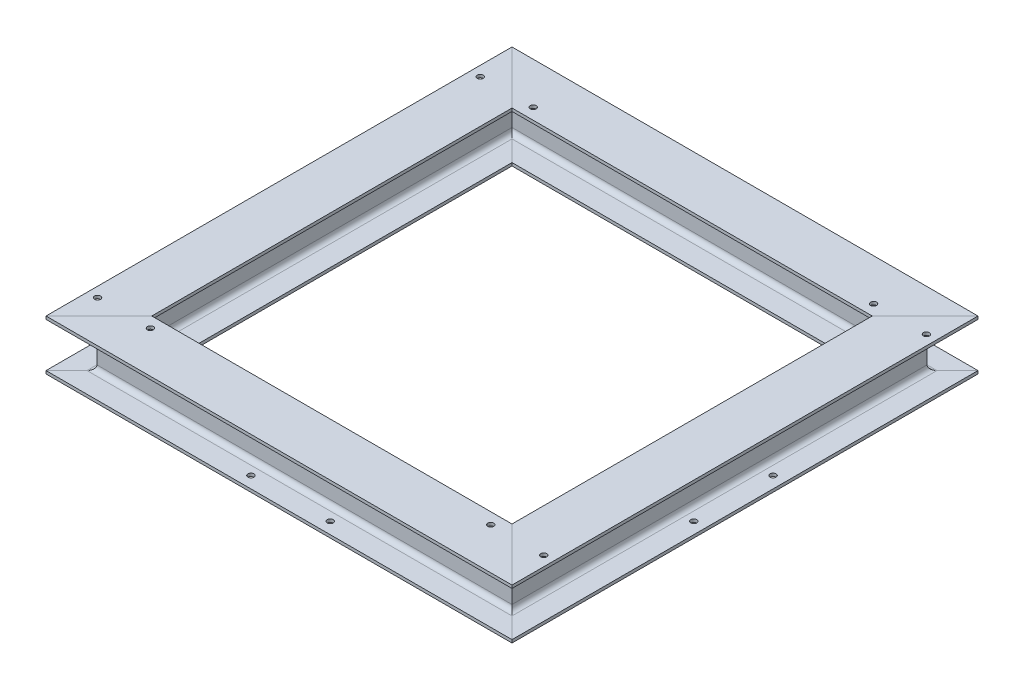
ISO-10303-21;
HEADER;
FILE_DESCRIPTION(('STEP AP214'),'2;1');
FILE_NAME('part.step','',(''),(''),'','','');
FILE_SCHEMA(('AUTOMOTIVE_DESIGN { 1 0 10303 214 1 1 1 1 }'));
ENDSEC;
DATA;
#1=APPLICATION_CONTEXT('core data for automotive mechanical design processes');
#2=APPLICATION_PROTOCOL_DEFINITION('international standard','automotive_design',2000,#1);
#3=PRODUCT_CONTEXT('',#1,'mechanical');
#4=PRODUCT('Part','Part','',(#3));
#5=PRODUCT_RELATED_PRODUCT_CATEGORY('part','',(#4));
#6=PRODUCT_DEFINITION_FORMATION('','',#4);
#7=PRODUCT_DEFINITION_CONTEXT('part definition',#1,'design');
#8=PRODUCT_DEFINITION('design','',#6,#7);
#9=PRODUCT_DEFINITION_SHAPE('','',#8);
#10=(LENGTH_UNIT() NAMED_UNIT(*) SI_UNIT(.MILLI.,.METRE.));
#11=(NAMED_UNIT(*) PLANE_ANGLE_UNIT() SI_UNIT($,.RADIAN.));
#12=(NAMED_UNIT(*) SI_UNIT($,.STERADIAN.) SOLID_ANGLE_UNIT());
#13=UNCERTAINTY_MEASURE_WITH_UNIT(LENGTH_MEASURE(1.E-05),#10,'distance_accuracy_value','');
#14=(GEOMETRIC_REPRESENTATION_CONTEXT(3) GLOBAL_UNCERTAINTY_ASSIGNED_CONTEXT((#13)) GLOBAL_UNIT_ASSIGNED_CONTEXT((#10,
#11,#12)) REPRESENTATION_CONTEXT('',''));
#15=CARTESIAN_POINT('',(0.,0.,0.));
#16=DIRECTION('',(0.,0.,1.));
#17=DIRECTION('',(1.,0.,0.));
#18=AXIS2_PLACEMENT_3D('',#15,#16,#17);
#19=CARTESIAN_POINT('',(625.,0.,625.));
#20=DIRECTION('',(0.707106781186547,0.,-0.707106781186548));
#21=DIRECTION('',(-0.707106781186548,0.,-0.707106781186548));
#22=AXIS2_PLACEMENT_3D('',#19,#20,#21);
#23=PLANE('',#22);
#24=DIRECTION('',(0.707106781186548,0.,0.707106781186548));
#25=VECTOR('',#24,1.);
#26=CARTESIAN_POINT('',(637.209312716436,76.,637.209312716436));
#27=LINE('',#26,#25);
#28=CARTESIAN_POINT('',(545.,76.,545.));
#29=VERTEX_POINT('',#28);
#30=CARTESIAN_POINT('',(705.,76.,705.));
#31=VERTEX_POINT('',#30);
#32=EDGE_CURVE('E615',#29,#31,#27,.T.);
#33=ORIENTED_EDGE('',*,*,#32,.T.);
#34=DIRECTION('',(0.,-1.,0.));
#35=VECTOR('',#34,1.);
#36=CARTESIAN_POINT('',(705.,66.9999999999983,705.));
#37=LINE('',#36,#35);
#38=CARTESIAN_POINT('',(705.,67.,705.));
#39=VERTEX_POINT('',#38);
#40=EDGE_CURVE('E626',#31,#39,#37,.T.);
#41=ORIENTED_EDGE('',*,*,#40,.T.);
#42=DIRECTION('',(-0.707106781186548,0.,-0.707106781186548));
#43=VECTOR('',#42,1.);
#44=CARTESIAN_POINT('',(606.209312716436,67.,606.209312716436));
#45=LINE('',#44,#43);
#46=CARTESIAN_POINT('',(643.,67.,643.));
#47=VERTEX_POINT('',#46);
#48=EDGE_CURVE('E685',#39,#47,#45,.T.);
#49=ORIENTED_EDGE('',*,*,#48,.T.);
#50=CARTESIAN_POINT('',(643.,52.,643.));
#51=DIRECTION('',(0.707106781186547,0.,-0.707106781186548));
#52=DIRECTION('',(-0.707106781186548,0.,-0.707106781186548));
#53=AXIS2_PLACEMENT_3D('',#50,#51,#52);
#54=ELLIPSE('',#53,21.2132034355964,15.);
#55=CARTESIAN_POINT('',(628.,52.,628.));
#56=VERTEX_POINT('',#55);
#57=EDGE_CURVE('E681',#47,#56,#54,.F.);
#58=ORIENTED_EDGE('',*,*,#57,.T.);
#59=DIRECTION('',(0.,-1.,0.));
#60=VECTOR('',#59,1.);
#61=CARTESIAN_POINT('',(628.,-52.,628.));
#62=LINE('',#61,#60);
#63=CARTESIAN_POINT('',(628.,-52.,628.));
#64=VERTEX_POINT('',#63);
#65=EDGE_CURVE('E677',#56,#64,#62,.T.);
#66=ORIENTED_EDGE('',*,*,#65,.T.);
#67=CARTESIAN_POINT('',(643.,-52.,643.));
#68=DIRECTION('',(0.707106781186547,0.,-0.707106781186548));
#69=DIRECTION('',(-0.707106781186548,0.,-0.707106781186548));
#70=AXIS2_PLACEMENT_3D('',#67,#68,#69);
#71=ELLIPSE('',#70,21.2132034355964,15.);
#72=CARTESIAN_POINT('',(643.,-67.,643.));
#73=VERTEX_POINT('',#72);
#74=EDGE_CURVE('E673',#64,#73,#71,.F.);
#75=ORIENTED_EDGE('',*,*,#74,.T.);
#76=DIRECTION('',(0.707106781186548,0.,0.707106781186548));
#77=VECTOR('',#76,1.);
#78=CARTESIAN_POINT('',(637.209312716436,-67.,637.209312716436));
#79=LINE('',#78,#77);
#80=CARTESIAN_POINT('',(705.,-67.,705.));
#81=VERTEX_POINT('',#80);
#82=EDGE_CURVE('E669',#73,#81,#79,.T.);
#83=ORIENTED_EDGE('',*,*,#82,.T.);
#84=DIRECTION('',(0.,-1.,0.));
#85=VECTOR('',#84,1.);
#86=CARTESIAN_POINT('',(705.,-75.9999999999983,705.));
#87=LINE('',#86,#85);
#88=CARTESIAN_POINT('',(705.,-76.,705.));
#89=VERTEX_POINT('',#88);
#90=EDGE_CURVE('E665',#81,#89,#87,.T.);
#91=ORIENTED_EDGE('',*,*,#90,.T.);
#92=DIRECTION('',(-0.707106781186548,0.,-0.707106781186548));
#93=VECTOR('',#92,1.);
#94=CARTESIAN_POINT('',(557.209312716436,-76.,557.209312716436));
#95=LINE('',#94,#93);
#96=CARTESIAN_POINT('',(545.,-76.,545.));
#97=VERTEX_POINT('',#96);
#98=EDGE_CURVE('E661',#89,#97,#95,.T.);
#99=ORIENTED_EDGE('',*,*,#98,.T.);
#100=DIRECTION('',(0.,1.,0.));
#101=VECTOR('',#100,1.);
#102=CARTESIAN_POINT('',(545.,-66.9999999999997,545.));
#103=LINE('',#102,#101);
#104=CARTESIAN_POINT('',(545.,-67.,545.));
#105=VERTEX_POINT('',#104);
#106=EDGE_CURVE('E657',#97,#105,#103,.T.);
#107=ORIENTED_EDGE('',*,*,#106,.T.);
#108=DIRECTION('',(0.707106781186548,0.,0.707106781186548));
#109=VECTOR('',#108,1.);
#110=CARTESIAN_POINT('',(588.209312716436,-67.,588.209312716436));
#111=LINE('',#110,#109);
#112=CARTESIAN_POINT('',(607.,-67.,607.));
#113=VERTEX_POINT('',#112);
#114=EDGE_CURVE('E653',#105,#113,#111,.T.);
#115=ORIENTED_EDGE('',*,*,#114,.T.);
#116=CARTESIAN_POINT('',(607.,-52.,607.));
#117=DIRECTION('',(0.707106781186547,0.,-0.707106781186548));
#118=DIRECTION('',(-0.707106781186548,0.,-0.707106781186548));
#119=AXIS2_PLACEMENT_3D('',#116,#117,#118);
#120=ELLIPSE('',#119,21.2132034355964,15.);
#121=CARTESIAN_POINT('',(622.,-52.,622.));
#122=VERTEX_POINT('',#121);
#123=EDGE_CURVE('E649',#113,#122,#120,.F.);
#124=ORIENTED_EDGE('',*,*,#123,.T.);
#125=DIRECTION('',(0.,1.,0.));
#126=VECTOR('',#125,1.);
#127=CARTESIAN_POINT('',(622.,52.,622.));
#128=LINE('',#127,#126);
#129=CARTESIAN_POINT('',(622.,52.,622.));
#130=VERTEX_POINT('',#129);
#131=EDGE_CURVE('E645',#122,#130,#128,.T.);
#132=ORIENTED_EDGE('',*,*,#131,.T.);
#133=CARTESIAN_POINT('',(607.,52.,607.));
#134=DIRECTION('',(0.707106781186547,0.,-0.707106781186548));
#135=DIRECTION('',(-0.707106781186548,0.,-0.707106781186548));
#136=AXIS2_PLACEMENT_3D('',#133,#134,#135);
#137=ELLIPSE('',#136,21.2132034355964,15.);
#138=CARTESIAN_POINT('',(607.,67.,607.));
#139=VERTEX_POINT('',#138);
#140=EDGE_CURVE('E638',#130,#139,#137,.F.);
#141=ORIENTED_EDGE('',*,*,#140,.T.);
#142=DIRECTION('',(-0.707106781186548,0.,-0.707106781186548));
#143=VECTOR('',#142,1.);
#144=CARTESIAN_POINT('',(557.209312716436,67.,557.209312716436));
#145=LINE('',#144,#143);
#146=CARTESIAN_POINT('',(545.,67.,545.));
#147=VERTEX_POINT('',#146);
#148=EDGE_CURVE('E630',#139,#147,#145,.T.);
#149=ORIENTED_EDGE('',*,*,#148,.T.);
#150=DIRECTION('',(0.,1.,0.));
#151=VECTOR('',#150,1.);
#152=CARTESIAN_POINT('',(545.,75.9999999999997,545.));
#153=LINE('',#152,#151);
#154=EDGE_CURVE('E611',#147,#29,#153,.T.);
#155=ORIENTED_EDGE('',*,*,#154,.T.);
#156=EDGE_LOOP('',(#33,#41,#49,#58,#66,#75,#83,#91,#99,#107,#115,#124,#132,#141,#149,#155));
#157=FACE_BOUND('',#156,.T.);
#158=ADVANCED_FACE('F497',(#157),#23,.T.);
#159=CARTESIAN_POINT('',(569.418625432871,76.,705.));
#160=DIRECTION('',(0.,-1.,0.));
#161=DIRECTION('',(0.,0.,-1.));
#162=AXIS2_PLACEMENT_3D('',#159,#160,#161);
#163=PLANE('',#162);
#164=CARTESIAN_POINT('',(515.,76.,579.));
#165=DIRECTION('',(0.,-1.,0.));
#166=DIRECTION('',(-1.,0.,0.));
#167=AXIS2_PLACEMENT_3D('',#164,#165,#166);
#168=CIRCLE('',#167,9.00000000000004);
#169=CARTESIAN_POINT('',(506.,76.,579.));
#170=VERTEX_POINT('',#169);
#171=EDGE_CURVE('E757',#170,#170,#168,.T.);
#172=ORIENTED_EDGE('',*,*,#171,.T.);
#173=EDGE_LOOP('',(#172));
#174=FACE_BOUND('',#173,.T.);
#175=CARTESIAN_POINT('',(-515.,76.,579.));
#176=DIRECTION('',(0.,1.,0.));
#177=DIRECTION('',(1.,0.,0.));
#178=AXIS2_PLACEMENT_3D('',#175,#176,#177);
#179=CIRCLE('',#178,9.00000000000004);
#180=CARTESIAN_POINT('',(-506.,76.,579.));
#181=VERTEX_POINT('',#180);
#182=EDGE_CURVE('E775',#181,#181,#179,.T.);
#183=ORIENTED_EDGE('',*,*,#182,.F.);
#184=EDGE_LOOP('',(#183));
#185=FACE_BOUND('',#184,.T.);
#186=DIRECTION('',(-1.,0.,0.));
#187=VECTOR('',#186,1.);
#188=CARTESIAN_POINT('',(569.418625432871,76.,545.));
#189=LINE('',#188,#187);
#190=CARTESIAN_POINT('',(-544.999999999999,76.,545.));
#191=VERTEX_POINT('',#190);
#192=EDGE_CURVE('E607',#29,#191,#189,.T.);
#193=ORIENTED_EDGE('',*,*,#192,.T.);
#194=DIRECTION('',(-0.707106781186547,0.,0.707106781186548));
#195=VECTOR('',#194,1.);
#196=CARTESIAN_POINT('',(-67.7906872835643,75.9999999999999,67.7906872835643));
#197=LINE('',#196,#195);
#198=CARTESIAN_POINT('',(-704.999999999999,76.,705.));
#199=VERTEX_POINT('',#198);
#200=EDGE_CURVE('E514',#191,#199,#197,.T.);
#201=ORIENTED_EDGE('',*,*,#200,.T.);
#202=DIRECTION('',(-1.,0.,0.));
#203=VECTOR('',#202,1.);
#204=CARTESIAN_POINT('',(569.418625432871,76.,705.));
#205=LINE('',#204,#203);
#206=EDGE_CURVE('E621',#31,#199,#205,.T.);
#207=ORIENTED_EDGE('',*,*,#206,.F.);
#208=ORIENTED_EDGE('',*,*,#32,.F.);
#209=EDGE_LOOP('',(#193,#201,#207,#208));
#210=FACE_BOUND('',#209,.T.);
#211=ADVANCED_FACE('F619',(#174,#185,#210),#163,.F.);
#212=CARTESIAN_POINT('',(569.418625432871,76.,545.));
#213=DIRECTION('',(0.,0.,1.));
#214=DIRECTION('',(0.,-1.,0.));
#215=AXIS2_PLACEMENT_3D('',#212,#213,#214);
#216=PLANE('',#215);
#217=DIRECTION('',(-1.,0.,0.));
#218=VECTOR('',#217,1.);
#219=CARTESIAN_POINT('',(569.418625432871,67.,545.));
#220=LINE('',#219,#218);
#221=CARTESIAN_POINT('',(-545.,67.,545.));
#222=VERTEX_POINT('',#221);
#223=EDGE_CURVE('E616',#147,#222,#220,.T.);
#224=ORIENTED_EDGE('',*,*,#223,.T.);
#225=DIRECTION('',(0.,1.,0.));
#226=VECTOR('',#225,1.);
#227=CARTESIAN_POINT('',(-545.,76.0000000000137,545.));
#228=LINE('',#227,#226);
#229=EDGE_CURVE('E14',#222,#191,#228,.T.);
#230=ORIENTED_EDGE('',*,*,#229,.T.);
#231=ORIENTED_EDGE('',*,*,#192,.F.);
#232=ORIENTED_EDGE('',*,*,#154,.F.);
#233=EDGE_LOOP('',(#224,#230,#231,#232));
#234=FACE_BOUND('',#233,.T.);
#235=ADVANCED_FACE('F609',(#234),#216,.F.);
#236=CARTESIAN_POINT('',(569.418625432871,67.,545.));
#237=DIRECTION('',(0.,1.,0.));
#238=DIRECTION('',(0.,0.,1.));
#239=AXIS2_PLACEMENT_3D('',#236,#237,#238);
#240=PLANE('',#239);
#241=CARTESIAN_POINT('',(515.,67.,579.));
#242=DIRECTION('',(0.,-1.,0.));
#243=DIRECTION('',(0.,0.,-1.));
#244=AXIS2_PLACEMENT_3D('',#241,#242,#243);
#245=CIRCLE('',#244,9.00000000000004);
#246=CARTESIAN_POINT('',(506.,67.,579.));
#247=VERTEX_POINT('',#246);
#248=EDGE_CURVE('E771',#247,#247,#245,.T.);
#249=ORIENTED_EDGE('',*,*,#248,.F.);
#250=EDGE_LOOP('',(#249));
#251=FACE_BOUND('',#250,.T.);
#252=CARTESIAN_POINT('',(-515.,67.,579.));
#253=DIRECTION('',(0.,1.,0.));
#254=DIRECTION('',(0.,0.,-1.));
#255=AXIS2_PLACEMENT_3D('',#252,#253,#254);
#256=CIRCLE('',#255,9.00000000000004);
#257=CARTESIAN_POINT('',(-506.,67.,579.));
#258=VERTEX_POINT('',#257);
#259=EDGE_CURVE('E746',#258,#258,#256,.T.);
#260=ORIENTED_EDGE('',*,*,#259,.T.);
#261=EDGE_LOOP('',(#260));
#262=FACE_BOUND('',#261,.T.);
#263=DIRECTION('',(-1.,0.,0.));
#264=VECTOR('',#263,1.);
#265=CARTESIAN_POINT('',(569.418625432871,67.,607.));
#266=LINE('',#265,#264);
#267=CARTESIAN_POINT('',(-607.,67.,607.));
#268=VERTEX_POINT('',#267);
#269=EDGE_CURVE('E739',#139,#268,#266,.T.);
#270=ORIENTED_EDGE('',*,*,#269,.T.);
#271=DIRECTION('',(0.707106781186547,0.,-0.707106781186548));
#272=VECTOR('',#271,1.);
#273=CARTESIAN_POINT('',(12.2093127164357,67.0000000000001,-12.2093127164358));
#274=LINE('',#273,#272);
#275=EDGE_CURVE('E506',#268,#222,#274,.T.);
#276=ORIENTED_EDGE('',*,*,#275,.T.);
#277=ORIENTED_EDGE('',*,*,#223,.F.);
#278=ORIENTED_EDGE('',*,*,#148,.F.);
#279=EDGE_LOOP('',(#270,#276,#277,#278));
#280=FACE_BOUND('',#279,.T.);
#281=ADVANCED_FACE('F876',(#251,#262,#280),#240,.F.);
#282=CARTESIAN_POINT('',(569.418625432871,52.,607.));
#283=DIRECTION('',(-1.,0.,0.));
#284=DIRECTION('',(0.,0.,1.));
#285=AXIS2_PLACEMENT_3D('',#282,#283,#284);
#286=CYLINDRICAL_SURFACE('',#285,15.);
#287=DIRECTION('',(-1.,0.,0.));
#288=VECTOR('',#287,1.);
#289=CARTESIAN_POINT('',(569.418625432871,52.,622.));
#290=LINE('',#289,#288);
#291=CARTESIAN_POINT('',(-622.,52.,622.));
#292=VERTEX_POINT('',#291);
#293=EDGE_CURVE('E735',#130,#292,#290,.T.);
#294=ORIENTED_EDGE('',*,*,#293,.T.);
#295=CARTESIAN_POINT('',(-607.,52.,607.));
#296=DIRECTION('',(0.707106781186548,0.,0.707106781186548));
#297=DIRECTION('',(-0.707106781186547,0.,0.707106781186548));
#298=AXIS2_PLACEMENT_3D('',#295,#296,#297);
#299=ELLIPSE('',#298,21.2132034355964,15.);
#300=EDGE_CURVE('E785',#292,#268,#299,.F.);
#301=ORIENTED_EDGE('',*,*,#300,.T.);
#302=ORIENTED_EDGE('',*,*,#269,.F.);
#303=ORIENTED_EDGE('',*,*,#140,.F.);
#304=EDGE_LOOP('',(#294,#301,#302,#303));
#305=FACE_BOUND('',#304,.T.);
#306=ADVANCED_FACE('F873',(#305),#286,.F.);
#307=CARTESIAN_POINT('',(569.418625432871,52.,622.));
#308=DIRECTION('',(0.,0.,1.));
#309=DIRECTION('',(1.,0.,0.));
#310=AXIS2_PLACEMENT_3D('',#307,#308,#309);
#311=PLANE('',#310);
#312=DIRECTION('',(-1.,0.,0.));
#313=VECTOR('',#312,1.);
#314=CARTESIAN_POINT('',(569.418625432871,-52.,622.));
#315=LINE('',#314,#313);
#316=CARTESIAN_POINT('',(-622.,-52.,622.));
#317=VERTEX_POINT('',#316);
#318=EDGE_CURVE('E731',#122,#317,#315,.T.);
#319=ORIENTED_EDGE('',*,*,#318,.T.);
#320=DIRECTION('',(0.,1.,0.));
#321=VECTOR('',#320,1.);
#322=CARTESIAN_POINT('',(-622.,52.,622.));
#323=LINE('',#322,#321);
#324=EDGE_CURVE('E789',#317,#292,#323,.T.);
#325=ORIENTED_EDGE('',*,*,#324,.T.);
#326=ORIENTED_EDGE('',*,*,#293,.F.);
#327=ORIENTED_EDGE('',*,*,#131,.F.);
#328=EDGE_LOOP('',(#319,#325,#326,#327));
#329=FACE_BOUND('',#328,.T.);
#330=ADVANCED_FACE('F871',(#329),#311,.F.);
#331=CARTESIAN_POINT('',(569.418625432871,-52.,607.));
#332=DIRECTION('',(-1.,0.,0.));
#333=DIRECTION('',(0.,0.,1.));
#334=AXIS2_PLACEMENT_3D('',#331,#332,#333);
#335=CYLINDRICAL_SURFACE('',#334,15.);
#336=DIRECTION('',(-1.,0.,0.));
#337=VECTOR('',#336,1.);
#338=CARTESIAN_POINT('',(569.418625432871,-67.,607.));
#339=LINE('',#338,#337);
#340=CARTESIAN_POINT('',(-607.,-67.,607.));
#341=VERTEX_POINT('',#340);
#342=EDGE_CURVE('E727',#113,#341,#339,.T.);
#343=ORIENTED_EDGE('',*,*,#342,.T.);
#344=CARTESIAN_POINT('',(-607.,-52.,607.));
#345=DIRECTION('',(0.707106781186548,0.,0.707106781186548));
#346=DIRECTION('',(-0.707106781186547,0.,0.707106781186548));
#347=AXIS2_PLACEMENT_3D('',#344,#345,#346);
#348=ELLIPSE('',#347,21.2132034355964,15.);
#349=EDGE_CURVE('E793',#341,#317,#348,.F.);
#350=ORIENTED_EDGE('',*,*,#349,.T.);
#351=ORIENTED_EDGE('',*,*,#318,.F.);
#352=ORIENTED_EDGE('',*,*,#123,.F.);
#353=EDGE_LOOP('',(#343,#350,#351,#352));
#354=FACE_BOUND('',#353,.T.);
#355=ADVANCED_FACE('F867',(#354),#335,.F.);
#356=CARTESIAN_POINT('',(569.418625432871,-67.,607.));
#357=DIRECTION('',(0.,-1.,0.));
#358=DIRECTION('',(0.,0.,-1.));
#359=AXIS2_PLACEMENT_3D('',#356,#357,#358);
#360=PLANE('',#359);
#361=DIRECTION('',(-1.,0.,0.));
#362=VECTOR('',#361,1.);
#363=CARTESIAN_POINT('',(569.418625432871,-67.,545.));
#364=LINE('',#363,#362);
#365=CARTESIAN_POINT('',(-545.,-67.,545.));
#366=VERTEX_POINT('',#365);
#367=EDGE_CURVE('E723',#105,#366,#364,.T.);
#368=ORIENTED_EDGE('',*,*,#367,.T.);
#369=DIRECTION('',(-0.707106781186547,0.,0.707106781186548));
#370=VECTOR('',#369,1.);
#371=CARTESIAN_POINT('',(-18.7906872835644,-67.0000000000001,18.7906872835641));
#372=LINE('',#371,#370);
#373=EDGE_CURVE('E797',#366,#341,#372,.T.);
#374=ORIENTED_EDGE('',*,*,#373,.T.);
#375=ORIENTED_EDGE('',*,*,#342,.F.);
#376=ORIENTED_EDGE('',*,*,#114,.F.);
#377=EDGE_LOOP('',(#368,#374,#375,#376));
#378=FACE_BOUND('',#377,.T.);
#379=ADVANCED_FACE('F864',(#378),#360,.F.);
#380=CARTESIAN_POINT('',(569.418625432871,-67.,545.));
#381=DIRECTION('',(0.,0.,1.));
#382=DIRECTION('',(0.,-1.,0.));
#383=AXIS2_PLACEMENT_3D('',#380,#381,#382);
#384=PLANE('',#383);
#385=DIRECTION('',(-1.,0.,0.));
#386=VECTOR('',#385,1.);
#387=CARTESIAN_POINT('',(569.418625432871,-76.,545.));
#388=LINE('',#387,#386);
#389=CARTESIAN_POINT('',(-544.999999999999,-76.,545.));
#390=VERTEX_POINT('',#389);
#391=EDGE_CURVE('E719',#97,#390,#388,.T.);
#392=ORIENTED_EDGE('',*,*,#391,.T.);
#393=DIRECTION('',(0.,1.,0.));
#394=VECTOR('',#393,1.);
#395=CARTESIAN_POINT('',(-545.,-67.0000000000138,545.));
#396=LINE('',#395,#394);
#397=EDGE_CURVE('E801',#390,#366,#396,.T.);
#398=ORIENTED_EDGE('',*,*,#397,.T.);
#399=ORIENTED_EDGE('',*,*,#367,.F.);
#400=ORIENTED_EDGE('',*,*,#106,.F.);
#401=EDGE_LOOP('',(#392,#398,#399,#400));
#402=FACE_BOUND('',#401,.T.);
#403=ADVANCED_FACE('F862',(#402),#384,.F.);
#404=CARTESIAN_POINT('',(569.418625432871,-76.,545.));
#405=DIRECTION('',(0.,1.,0.));
#406=DIRECTION('',(0.,0.,1.));
#407=AXIS2_PLACEMENT_3D('',#404,#405,#406);
#408=PLANE('',#407);
#409=CARTESIAN_POINT('',(-120.000000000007,-76.,669.999999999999));
#410=DIRECTION('',(0.,-1.,0.));
#411=DIRECTION('',(0.,0.,-1.));
#412=AXIS2_PLACEMENT_3D('',#409,#410,#411);
#413=CIRCLE('',#412,9.00000000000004);
#414=CARTESIAN_POINT('',(-120.000000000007,-76.,660.999999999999));
#415=VERTEX_POINT('',#414);
#416=EDGE_CURVE('E750',#415,#415,#413,.T.);
#417=ORIENTED_EDGE('',*,*,#416,.F.);
#418=EDGE_LOOP('',(#417));
#419=FACE_BOUND('',#418,.T.);
#420=CARTESIAN_POINT('',(119.999999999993,-76.,670.000000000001));
#421=DIRECTION('',(0.,-1.,0.));
#422=DIRECTION('',(0.,0.,-1.));
#423=AXIS2_PLACEMENT_3D('',#420,#421,#422);
#424=CIRCLE('',#423,9.00000000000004);
#425=CARTESIAN_POINT('',(119.999999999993,-76.,661.000000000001));
#426=VERTEX_POINT('',#425);
#427=EDGE_CURVE('E759',#426,#426,#424,.T.);
#428=ORIENTED_EDGE('',*,*,#427,.F.);
#429=EDGE_LOOP('',(#428));
#430=FACE_BOUND('',#429,.T.);
#431=DIRECTION('',(-1.,0.,0.));
#432=VECTOR('',#431,1.);
#433=CARTESIAN_POINT('',(569.418625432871,-76.,705.));
#434=LINE('',#433,#432);
#435=CARTESIAN_POINT('',(-705.,-76.,705.));
#436=VERTEX_POINT('',#435);
#437=EDGE_CURVE('E715',#89,#436,#434,.T.);
#438=ORIENTED_EDGE('',*,*,#437,.T.);
#439=DIRECTION('',(0.707106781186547,0.,-0.707106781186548));
#440=VECTOR('',#439,1.);
#441=CARTESIAN_POINT('',(12.2093127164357,-75.9999999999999,-12.2093127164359));
#442=LINE('',#441,#440);
#443=EDGE_CURVE('E805',#436,#390,#442,.T.);
#444=ORIENTED_EDGE('',*,*,#443,.T.);
#445=ORIENTED_EDGE('',*,*,#391,.F.);
#446=ORIENTED_EDGE('',*,*,#98,.F.);
#447=EDGE_LOOP('',(#438,#444,#445,#446));
#448=FACE_BOUND('',#447,.T.);
#449=ADVANCED_FACE('F858',(#419,#430,#448),#408,.F.);
#450=CARTESIAN_POINT('',(569.418625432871,-76.,705.));
#451=DIRECTION('',(0.,0.,-1.));
#452=DIRECTION('',(0.,1.,0.));
#453=AXIS2_PLACEMENT_3D('',#450,#451,#452);
#454=PLANE('',#453);
#455=DIRECTION('',(-1.,0.,0.));
#456=VECTOR('',#455,1.);
#457=CARTESIAN_POINT('',(569.418625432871,-67.,705.));
#458=LINE('',#457,#456);
#459=CARTESIAN_POINT('',(-705.,-67.,705.));
#460=VERTEX_POINT('',#459);
#461=EDGE_CURVE('E711',#81,#460,#458,.T.);
#462=ORIENTED_EDGE('',*,*,#461,.T.);
#463=DIRECTION('',(0.,-1.,0.));
#464=VECTOR('',#463,1.);
#465=CARTESIAN_POINT('',(-705.,-75.9999999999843,705.));
#466=LINE('',#465,#464);
#467=EDGE_CURVE('E809',#460,#436,#466,.T.);
#468=ORIENTED_EDGE('',*,*,#467,.T.);
#469=ORIENTED_EDGE('',*,*,#437,.F.);
#470=ORIENTED_EDGE('',*,*,#90,.F.);
#471=EDGE_LOOP('',(#462,#468,#469,#470));
#472=FACE_BOUND('',#471,.T.);
#473=ADVANCED_FACE('F855',(#472),#454,.F.);
#474=CARTESIAN_POINT('',(569.418625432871,-67.,705.));
#475=DIRECTION('',(0.,-1.,0.));
#476=DIRECTION('',(0.,0.,-1.));
#477=AXIS2_PLACEMENT_3D('',#474,#475,#476);
#478=PLANE('',#477);
#479=CARTESIAN_POINT('',(-120.000000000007,-67.,669.999999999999));
#480=DIRECTION('',(0.,-1.,0.));
#481=DIRECTION('',(0.,0.,-1.));
#482=AXIS2_PLACEMENT_3D('',#479,#480,#481);
#483=CIRCLE('',#482,9.00000000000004);
#484=CARTESIAN_POINT('',(-120.000000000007,-67.,660.999999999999));
#485=VERTEX_POINT('',#484);
#486=EDGE_CURVE('E500',#485,#485,#483,.T.);
#487=ORIENTED_EDGE('',*,*,#486,.T.);
#488=EDGE_LOOP('',(#487));
#489=FACE_BOUND('',#488,.T.);
#490=CARTESIAN_POINT('',(119.999999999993,-67.,670.000000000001));
#491=DIRECTION('',(0.,-1.,0.));
#492=DIRECTION('',(0.,0.,-1.));
#493=AXIS2_PLACEMENT_3D('',#490,#491,#492);
#494=CIRCLE('',#493,9.00000000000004);
#495=CARTESIAN_POINT('',(119.999999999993,-67.,661.000000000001));
#496=VERTEX_POINT('',#495);
#497=EDGE_CURVE('E747',#496,#496,#494,.T.);
#498=ORIENTED_EDGE('',*,*,#497,.T.);
#499=EDGE_LOOP('',(#498));
#500=FACE_BOUND('',#499,.T.);
#501=DIRECTION('',(-1.,0.,0.));
#502=VECTOR('',#501,1.);
#503=CARTESIAN_POINT('',(569.418625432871,-67.,643.));
#504=LINE('',#503,#502);
#505=CARTESIAN_POINT('',(-643.,-67.,643.));
#506=VERTEX_POINT('',#505);
#507=EDGE_CURVE('E707',#73,#506,#504,.T.);
#508=ORIENTED_EDGE('',*,*,#507,.T.);
#509=DIRECTION('',(-0.707106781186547,0.,0.707106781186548));
#510=VECTOR('',#509,1.);
#511=CARTESIAN_POINT('',(-67.7906872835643,-67.,67.7906872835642));
#512=LINE('',#511,#510);
#513=EDGE_CURVE('E813',#506,#460,#512,.T.);
#514=ORIENTED_EDGE('',*,*,#513,.T.);
#515=ORIENTED_EDGE('',*,*,#461,.F.);
#516=ORIENTED_EDGE('',*,*,#82,.F.);
#517=EDGE_LOOP('',(#508,#514,#515,#516));
#518=FACE_BOUND('',#517,.T.);
#519=ADVANCED_FACE('F853',(#489,#500,#518),#478,.F.);
#520=CARTESIAN_POINT('',(569.418625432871,-52.,643.));
#521=DIRECTION('',(-1.,0.,0.));
#522=DIRECTION('',(0.,0.,1.));
#523=AXIS2_PLACEMENT_3D('',#520,#521,#522);
#524=CYLINDRICAL_SURFACE('',#523,15.);
#525=DIRECTION('',(-1.,0.,0.));
#526=VECTOR('',#525,1.);
#527=CARTESIAN_POINT('',(569.418625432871,-52.,628.));
#528=LINE('',#527,#526);
#529=CARTESIAN_POINT('',(-628.,-52.,628.));
#530=VERTEX_POINT('',#529);
#531=EDGE_CURVE('E703',#64,#530,#528,.T.);
#532=ORIENTED_EDGE('',*,*,#531,.T.);
#533=CARTESIAN_POINT('',(-643.,-52.,643.));
#534=DIRECTION('',(0.707106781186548,0.,0.707106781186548));
#535=DIRECTION('',(-0.707106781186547,0.,0.707106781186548));
#536=AXIS2_PLACEMENT_3D('',#533,#534,#535);
#537=ELLIPSE('',#536,21.2132034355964,15.);
#538=EDGE_CURVE('E817',#530,#506,#537,.F.);
#539=ORIENTED_EDGE('',*,*,#538,.T.);
#540=ORIENTED_EDGE('',*,*,#507,.F.);
#541=ORIENTED_EDGE('',*,*,#74,.F.);
#542=EDGE_LOOP('',(#532,#539,#540,#541));
#543=FACE_BOUND('',#542,.T.);
#544=ADVANCED_FACE('F849',(#543),#524,.F.);
#545=CARTESIAN_POINT('',(569.418625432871,-52.,628.));
#546=DIRECTION('',(0.,0.,-1.));
#547=DIRECTION('',(-1.,0.,0.));
#548=AXIS2_PLACEMENT_3D('',#545,#546,#547);
#549=PLANE('',#548);
#550=DIRECTION('',(-1.,0.,0.));
#551=VECTOR('',#550,1.);
#552=CARTESIAN_POINT('',(569.418625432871,52.,628.));
#553=LINE('',#552,#551);
#554=CARTESIAN_POINT('',(-628.,52.,628.));
#555=VERTEX_POINT('',#554);
#556=EDGE_CURVE('E699',#56,#555,#553,.T.);
#557=ORIENTED_EDGE('',*,*,#556,.T.);
#558=DIRECTION('',(0.,-1.,0.));
#559=VECTOR('',#558,1.);
#560=CARTESIAN_POINT('',(-628.,-52.,628.));
#561=LINE('',#560,#559);
#562=EDGE_CURVE('E821',#555,#530,#561,.T.);
#563=ORIENTED_EDGE('',*,*,#562,.T.);
#564=ORIENTED_EDGE('',*,*,#531,.F.);
#565=ORIENTED_EDGE('',*,*,#65,.F.);
#566=EDGE_LOOP('',(#557,#563,#564,#565));
#567=FACE_BOUND('',#566,.T.);
#568=ADVANCED_FACE('F846',(#567),#549,.F.);
#569=CARTESIAN_POINT('',(569.418625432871,52.,643.));
#570=DIRECTION('',(-1.,0.,0.));
#571=DIRECTION('',(0.,0.,1.));
#572=AXIS2_PLACEMENT_3D('',#569,#570,#571);
#573=CYLINDRICAL_SURFACE('',#572,15.);
#574=DIRECTION('',(-1.,0.,0.));
#575=VECTOR('',#574,1.);
#576=CARTESIAN_POINT('',(569.418625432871,67.,643.));
#577=LINE('',#576,#575);
#578=CARTESIAN_POINT('',(-643.,67.,643.));
#579=VERTEX_POINT('',#578);
#580=EDGE_CURVE('E695',#47,#579,#577,.T.);
#581=ORIENTED_EDGE('',*,*,#580,.T.);
#582=CARTESIAN_POINT('',(-643.,52.,643.));
#583=DIRECTION('',(0.707106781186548,0.,0.707106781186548));
#584=DIRECTION('',(-0.707106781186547,0.,0.707106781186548));
#585=AXIS2_PLACEMENT_3D('',#582,#583,#584);
#586=ELLIPSE('',#585,21.2132034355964,15.);
#587=EDGE_CURVE('E825',#579,#555,#586,.F.);
#588=ORIENTED_EDGE('',*,*,#587,.T.);
#589=ORIENTED_EDGE('',*,*,#556,.F.);
#590=ORIENTED_EDGE('',*,*,#57,.F.);
#591=EDGE_LOOP('',(#581,#588,#589,#590));
#592=FACE_BOUND('',#591,.T.);
#593=ADVANCED_FACE('F844',(#592),#573,.F.);
#594=CARTESIAN_POINT('',(569.418625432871,67.,643.));
#595=DIRECTION('',(0.,1.,0.));
#596=DIRECTION('',(0.,0.,1.));
#597=AXIS2_PLACEMENT_3D('',#594,#595,#596);
#598=PLANE('',#597);
#599=DIRECTION('',(-1.,0.,0.));
#600=VECTOR('',#599,1.);
#601=CARTESIAN_POINT('',(569.418625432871,67.,705.));
#602=LINE('',#601,#600);
#603=CARTESIAN_POINT('',(-705.,67.,705.));
#604=VERTEX_POINT('',#603);
#605=EDGE_CURVE('E691',#39,#604,#602,.T.);
#606=ORIENTED_EDGE('',*,*,#605,.T.);
#607=DIRECTION('',(0.707106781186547,0.,-0.707106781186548));
#608=VECTOR('',#607,1.);
#609=CARTESIAN_POINT('',(-36.7906872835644,67.,36.790687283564));
#610=LINE('',#609,#608);
#611=EDGE_CURVE('E828',#604,#579,#610,.T.);
#612=ORIENTED_EDGE('',*,*,#611,.T.);
#613=ORIENTED_EDGE('',*,*,#580,.F.);
#614=ORIENTED_EDGE('',*,*,#48,.F.);
#615=EDGE_LOOP('',(#606,#612,#613,#614));
#616=FACE_BOUND('',#615,.T.);
#617=ADVANCED_FACE('F841',(#616),#598,.F.);
#618=CARTESIAN_POINT('',(569.418625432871,67.,705.));
#619=DIRECTION('',(0.,0.,-1.));
#620=DIRECTION('',(0.,1.,0.));
#621=AXIS2_PLACEMENT_3D('',#618,#619,#620);
#622=PLANE('',#621);
#623=ORIENTED_EDGE('',*,*,#206,.T.);
#624=DIRECTION('',(0.,-1.,0.));
#625=VECTOR('',#624,1.);
#626=CARTESIAN_POINT('',(-705.,66.9999999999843,705.));
#627=LINE('',#626,#625);
#628=EDGE_CURVE('E636',#199,#604,#627,.T.);
#629=ORIENTED_EDGE('',*,*,#628,.T.);
#630=ORIENTED_EDGE('',*,*,#605,.F.);
#631=ORIENTED_EDGE('',*,*,#40,.F.);
#632=EDGE_LOOP('',(#623,#629,#630,#631));
#633=FACE_BOUND('',#632,.T.);
#634=ADVANCED_FACE('F839',(#633),#622,.F.);
#635=CARTESIAN_POINT('',(-625.,0.,625.));
#636=DIRECTION('',(0.707106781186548,0.,0.707106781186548));
#637=DIRECTION('',(0.707106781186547,0.,-0.707106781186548));
#638=AXIS2_PLACEMENT_3D('',#635,#636,#637);
#639=PLANE('',#638);
#640=ORIENTED_EDGE('',*,*,#200,.F.);
#641=ORIENTED_EDGE('',*,*,#229,.F.);
#642=ORIENTED_EDGE('',*,*,#275,.F.);
#643=ORIENTED_EDGE('',*,*,#300,.F.);
#644=ORIENTED_EDGE('',*,*,#324,.F.);
#645=ORIENTED_EDGE('',*,*,#349,.F.);
#646=ORIENTED_EDGE('',*,*,#373,.F.);
#647=ORIENTED_EDGE('',*,*,#397,.F.);
#648=ORIENTED_EDGE('',*,*,#443,.F.);
#649=ORIENTED_EDGE('',*,*,#467,.F.);
#650=ORIENTED_EDGE('',*,*,#513,.F.);
#651=ORIENTED_EDGE('',*,*,#538,.F.);
#652=ORIENTED_EDGE('',*,*,#562,.F.);
#653=ORIENTED_EDGE('',*,*,#587,.F.);
#654=ORIENTED_EDGE('',*,*,#611,.F.);
#655=ORIENTED_EDGE('',*,*,#628,.F.);
#656=EDGE_LOOP('',(#640,#641,#642,#643,#644,#645,#646,#647,#648,#649,#650,#651,#652,#653,#654,#655));
#657=FACE_BOUND('',#656,.T.);
#658=ADVANCED_FACE('F840',(#657),#639,.F.);
#659=CARTESIAN_POINT('',(-515.,66.,579.));
#660=DIRECTION('',(0.,1.,0.));
#661=DIRECTION('',(1.,0.,0.));
#662=AXIS2_PLACEMENT_3D('',#659,#660,#661);
#663=CYLINDRICAL_SURFACE('',#662,9.00000000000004);
#664=CARTESIAN_POINT('',(-506.,76.,579.));
#665=CARTESIAN_POINT('',(-506.,75.90625,579.));
#666=CARTESIAN_POINT('',(-506.,75.8125,579.));
#667=CARTESIAN_POINT('',(-506.,75.625,579.));
#668=CARTESIAN_POINT('',(-506.,75.53125,579.));
#669=CARTESIAN_POINT('',(-506.,75.34375,579.));
#670=CARTESIAN_POINT('',(-506.,75.25,579.));
#671=CARTESIAN_POINT('',(-506.,75.0625,579.));
#672=CARTESIAN_POINT('',(-506.,74.96875,579.));
#673=CARTESIAN_POINT('',(-506.,74.78125,579.));
#674=CARTESIAN_POINT('',(-506.,74.6875,579.));
#675=CARTESIAN_POINT('',(-506.,74.5,579.));
#676=CARTESIAN_POINT('',(-506.,74.40625,579.));
#677=CARTESIAN_POINT('',(-506.,74.21875,579.));
#678=CARTESIAN_POINT('',(-506.,74.125,579.));
#679=CARTESIAN_POINT('',(-506.,73.9375,579.));
#680=CARTESIAN_POINT('',(-506.,73.84375,579.));
#681=CARTESIAN_POINT('',(-506.,73.65625,579.));
#682=CARTESIAN_POINT('',(-506.,73.5625,579.));
#683=CARTESIAN_POINT('',(-506.,73.375,579.));
#684=CARTESIAN_POINT('',(-506.,73.28125,579.));
#685=CARTESIAN_POINT('',(-506.,73.09375,579.));
#686=CARTESIAN_POINT('',(-506.,73.,579.));
#687=CARTESIAN_POINT('',(-506.,72.8125,579.));
#688=CARTESIAN_POINT('',(-506.,72.71875,579.));
#689=CARTESIAN_POINT('',(-506.,72.53125,579.));
#690=CARTESIAN_POINT('',(-506.,72.4375,579.));
#691=CARTESIAN_POINT('',(-506.,72.25,579.));
#692=CARTESIAN_POINT('',(-506.,72.15625,579.));
#693=CARTESIAN_POINT('',(-506.,71.96875,579.));
#694=CARTESIAN_POINT('',(-506.,71.875,579.));
#695=CARTESIAN_POINT('',(-506.,71.6875,579.));
#696=CARTESIAN_POINT('',(-506.,71.59375,579.));
#697=CARTESIAN_POINT('',(-506.,71.40625,579.));
#698=CARTESIAN_POINT('',(-506.,71.3125,579.));
#699=CARTESIAN_POINT('',(-506.,71.125,579.));
#700=CARTESIAN_POINT('',(-506.,71.03125,579.));
#701=CARTESIAN_POINT('',(-506.,70.84375,579.));
#702=CARTESIAN_POINT('',(-506.,70.75,579.));
#703=CARTESIAN_POINT('',(-506.,70.5625,579.));
#704=CARTESIAN_POINT('',(-506.,70.46875,579.));
#705=CARTESIAN_POINT('',(-506.,70.28125,579.));
#706=CARTESIAN_POINT('',(-506.,70.1875,579.));
#707=CARTESIAN_POINT('',(-506.,70.,579.));
#708=CARTESIAN_POINT('',(-506.,69.90625,579.));
#709=CARTESIAN_POINT('',(-506.,69.71875,579.));
#710=CARTESIAN_POINT('',(-506.,69.625,579.));
#711=CARTESIAN_POINT('',(-506.,69.4375,579.));
#712=CARTESIAN_POINT('',(-506.,69.34375,579.));
#713=CARTESIAN_POINT('',(-506.,69.15625,579.));
#714=CARTESIAN_POINT('',(-506.,69.0625,579.));
#715=CARTESIAN_POINT('',(-506.,68.875,579.));
#716=CARTESIAN_POINT('',(-506.,68.78125,579.));
#717=CARTESIAN_POINT('',(-506.,68.59375,579.));
#718=CARTESIAN_POINT('',(-506.,68.5,579.));
#719=CARTESIAN_POINT('',(-506.,68.3125,579.));
#720=CARTESIAN_POINT('',(-506.,68.21875,579.));
#721=CARTESIAN_POINT('',(-506.,68.03125,579.));
#722=CARTESIAN_POINT('',(-506.,67.9375,579.));
#723=CARTESIAN_POINT('',(-506.,67.75,579.));
#724=CARTESIAN_POINT('',(-506.,67.65625,579.));
#725=CARTESIAN_POINT('',(-506.,67.46875,579.));
#726=CARTESIAN_POINT('',(-506.,67.375,579.));
#727=CARTESIAN_POINT('',(-506.,67.1875,579.));
#728=CARTESIAN_POINT('',(-506.,67.09375,579.));
#729=CARTESIAN_POINT('',(-506.,67.,579.));
#730=B_SPLINE_CURVE_WITH_KNOTS('',3,(#664,#665,#666,#667,#668,#669,#670,#671,#672,#673,#674,
#675,#676,#677,#678,#679,#680,#681,#682,#683,#684,#685,#686,#687,#688,#689,#690,#691,#692,#693,
#694,#695,#696,#697,#698,#699,#700,#701,#702,#703,#704,#705,#706,#707,#708,#709,#710,#711,#712,
#713,#714,#715,#716,#717,#718,#719,#720,#721,#722,#723,#724,#725,#726,#727,#728,#729),
.UNSPECIFIED.,.F.,.F.,(4,2,2,2,2,2,2,2,2,2,2,2,2,2,2,2,2,2,2,2,2,2,2,2,2,2,2,2,2,2,2,2,4),(0.,
0.281249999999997,0.562499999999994,0.84374999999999,1.125,1.40625,1.68749999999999,
1.96874999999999,2.24999999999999,2.53125,2.8125,3.09374999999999,3.37499999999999,
3.65624999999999,3.9375,4.21874999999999,4.49999999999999,4.78124999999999,5.06249999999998,
5.34374999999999,5.62499999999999,5.90624999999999,6.18749999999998,6.46875,6.74999999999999,
7.03124999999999,7.31249999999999,7.59374999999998,7.87499999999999,8.15624999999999,
8.43749999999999,8.71874999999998,8.99999999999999),.UNSPECIFIED.);
#731=EDGE_CURVE('BSEAM900',#181,#258,#730,.T.);
#732=ORIENTED_EDGE('',*,*,#182,.T.);
#733=ORIENTED_EDGE('',*,*,#259,.F.);
#734=ORIENTED_EDGE('',*,*,#731,.T.);
#735=ORIENTED_EDGE('',*,*,#731,.F.);
#736=EDGE_LOOP('',(#732,#734,#733,#735));
#737=FACE_BOUND('',#736,.T.);
#738=ADVANCED_FACE('F900',(#737),#663,.F.);
#739=CARTESIAN_POINT('',(515.,66.,579.));
#740=DIRECTION('',(0.,1.,0.));
#741=DIRECTION('',(-1.,0.,0.));
#742=AXIS2_PLACEMENT_3D('',#739,#740,#741);
#743=CYLINDRICAL_SURFACE('',#742,9.00000000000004);
#744=CARTESIAN_POINT('',(506.,76.,579.));
#745=CARTESIAN_POINT('',(506.,75.90625,579.));
#746=CARTESIAN_POINT('',(506.,75.8125,579.));
#747=CARTESIAN_POINT('',(506.,75.625,579.));
#748=CARTESIAN_POINT('',(506.,75.53125,579.));
#749=CARTESIAN_POINT('',(506.,75.34375,579.));
#750=CARTESIAN_POINT('',(506.,75.25,579.));
#751=CARTESIAN_POINT('',(506.,75.0625,579.));
#752=CARTESIAN_POINT('',(506.,74.96875,579.));
#753=CARTESIAN_POINT('',(506.,74.78125,579.));
#754=CARTESIAN_POINT('',(506.,74.6875,579.));
#755=CARTESIAN_POINT('',(506.,74.5,579.));
#756=CARTESIAN_POINT('',(506.,74.40625,579.));
#757=CARTESIAN_POINT('',(506.,74.21875,579.));
#758=CARTESIAN_POINT('',(506.,74.125,579.));
#759=CARTESIAN_POINT('',(506.,73.9375,579.));
#760=CARTESIAN_POINT('',(506.,73.84375,579.));
#761=CARTESIAN_POINT('',(506.,73.65625,579.));
#762=CARTESIAN_POINT('',(506.,73.5625,579.));
#763=CARTESIAN_POINT('',(506.,73.375,579.));
#764=CARTESIAN_POINT('',(506.,73.28125,579.));
#765=CARTESIAN_POINT('',(506.,73.09375,579.));
#766=CARTESIAN_POINT('',(506.,73.,579.));
#767=CARTESIAN_POINT('',(506.,72.8125,579.));
#768=CARTESIAN_POINT('',(506.,72.71875,579.));
#769=CARTESIAN_POINT('',(506.,72.53125,579.));
#770=CARTESIAN_POINT('',(506.,72.4375,579.));
#771=CARTESIAN_POINT('',(506.,72.25,579.));
#772=CARTESIAN_POINT('',(506.,72.15625,579.));
#773=CARTESIAN_POINT('',(506.,71.96875,579.));
#774=CARTESIAN_POINT('',(506.,71.875,579.));
#775=CARTESIAN_POINT('',(506.,71.6875,579.));
#776=CARTESIAN_POINT('',(506.,71.59375,579.));
#777=CARTESIAN_POINT('',(506.,71.40625,579.));
#778=CARTESIAN_POINT('',(506.,71.3125,579.));
#779=CARTESIAN_POINT('',(506.,71.125,579.));
#780=CARTESIAN_POINT('',(506.,71.03125,579.));
#781=CARTESIAN_POINT('',(506.,70.84375,579.));
#782=CARTESIAN_POINT('',(506.,70.75,579.));
#783=CARTESIAN_POINT('',(506.,70.5625,579.));
#784=CARTESIAN_POINT('',(506.,70.46875,579.));
#785=CARTESIAN_POINT('',(506.,70.28125,579.));
#786=CARTESIAN_POINT('',(506.,70.1875,579.));
#787=CARTESIAN_POINT('',(506.,70.,579.));
#788=CARTESIAN_POINT('',(506.,69.90625,579.));
#789=CARTESIAN_POINT('',(506.,69.71875,579.));
#790=CARTESIAN_POINT('',(506.,69.625,579.));
#791=CARTESIAN_POINT('',(506.,69.4375,579.));
#792=CARTESIAN_POINT('',(506.,69.34375,579.));
#793=CARTESIAN_POINT('',(506.,69.15625,579.));
#794=CARTESIAN_POINT('',(506.,69.0625,579.));
#795=CARTESIAN_POINT('',(506.,68.875,579.));
#796=CARTESIAN_POINT('',(506.,68.78125,579.));
#797=CARTESIAN_POINT('',(506.,68.59375,579.));
#798=CARTESIAN_POINT('',(506.,68.5,579.));
#799=CARTESIAN_POINT('',(506.,68.3125,579.));
#800=CARTESIAN_POINT('',(506.,68.21875,579.));
#801=CARTESIAN_POINT('',(506.,68.03125,579.));
#802=CARTESIAN_POINT('',(506.,67.9375,579.));
#803=CARTESIAN_POINT('',(506.,67.75,579.));
#804=CARTESIAN_POINT('',(506.,67.65625,579.));
#805=CARTESIAN_POINT('',(506.,67.46875,579.));
#806=CARTESIAN_POINT('',(506.,67.375,579.));
#807=CARTESIAN_POINT('',(506.,67.1875,579.));
#808=CARTESIAN_POINT('',(506.,67.09375,579.));
#809=CARTESIAN_POINT('',(506.,67.,579.));
#810=B_SPLINE_CURVE_WITH_KNOTS('',3,(#744,#745,#746,#747,#748,#749,#750,#751,#752,#753,#754,
#755,#756,#757,#758,#759,#760,#761,#762,#763,#764,#765,#766,#767,#768,#769,#770,#771,#772,#773,
#774,#775,#776,#777,#778,#779,#780,#781,#782,#783,#784,#785,#786,#787,#788,#789,#790,#791,#792,
#793,#794,#795,#796,#797,#798,#799,#800,#801,#802,#803,#804,#805,#806,#807,#808,#809),
.UNSPECIFIED.,.F.,.F.,(4,2,2,2,2,2,2,2,2,2,2,2,2,2,2,2,2,2,2,2,2,2,2,2,2,2,2,2,2,2,2,2,4),(0.,
0.281249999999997,0.562499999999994,0.84374999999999,1.125,1.40625,1.68749999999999,
1.96874999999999,2.25,2.53125,2.8125,3.09374999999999,3.375,3.65625,3.9375,4.21874999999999,4.5,
4.78125,5.0625,5.34374999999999,5.62500000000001,5.90625,6.1875,6.46875,6.75000000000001,
7.03125,7.3125,7.59375,7.87500000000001,8.15625,8.4375,8.71875,9.00000000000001),.UNSPECIFIED.);
#811=EDGE_CURVE('BSEAM903',#170,#247,#810,.T.);
#812=ORIENTED_EDGE('',*,*,#171,.F.);
#813=ORIENTED_EDGE('',*,*,#248,.T.);
#814=ORIENTED_EDGE('',*,*,#811,.T.);
#815=ORIENTED_EDGE('',*,*,#811,.F.);
#816=EDGE_LOOP('',(#812,#814,#813,#815));
#817=FACE_BOUND('',#816,.T.);
#818=ADVANCED_FACE('F903',(#817),#743,.F.);
#819=CARTESIAN_POINT('',(119.999999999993,-66.,670.000000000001));
#820=DIRECTION('',(0.,-1.,0.));
#821=DIRECTION('',(0.,0.,-1.));
#822=AXIS2_PLACEMENT_3D('',#819,#820,#821);
#823=CYLINDRICAL_SURFACE('',#822,9.00000000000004);
#824=CARTESIAN_POINT('',(119.999999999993,-76.,661.000000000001));
#825=CARTESIAN_POINT('',(119.999999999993,-75.90625,661.000000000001));
#826=CARTESIAN_POINT('',(119.999999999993,-75.8125,661.000000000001));
#827=CARTESIAN_POINT('',(119.999999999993,-75.625,661.000000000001));
#828=CARTESIAN_POINT('',(119.999999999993,-75.53125,661.000000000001));
#829=CARTESIAN_POINT('',(119.999999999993,-75.34375,661.000000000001));
#830=CARTESIAN_POINT('',(119.999999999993,-75.25,661.000000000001));
#831=CARTESIAN_POINT('',(119.999999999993,-75.0625,661.000000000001));
#832=CARTESIAN_POINT('',(119.999999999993,-74.96875,661.000000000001));
#833=CARTESIAN_POINT('',(119.999999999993,-74.78125,661.000000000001));
#834=CARTESIAN_POINT('',(119.999999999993,-74.6875,661.000000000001));
#835=CARTESIAN_POINT('',(119.999999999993,-74.5,661.000000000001));
#836=CARTESIAN_POINT('',(119.999999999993,-74.40625,661.000000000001));
#837=CARTESIAN_POINT('',(119.999999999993,-74.21875,661.000000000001));
#838=CARTESIAN_POINT('',(119.999999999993,-74.125,661.000000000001));
#839=CARTESIAN_POINT('',(119.999999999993,-73.9375,661.000000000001));
#840=CARTESIAN_POINT('',(119.999999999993,-73.84375,661.000000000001));
#841=CARTESIAN_POINT('',(119.999999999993,-73.65625,661.000000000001));
#842=CARTESIAN_POINT('',(119.999999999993,-73.5625,661.000000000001));
#843=CARTESIAN_POINT('',(119.999999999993,-73.375,661.000000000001));
#844=CARTESIAN_POINT('',(119.999999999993,-73.28125,661.000000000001));
#845=CARTESIAN_POINT('',(119.999999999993,-73.09375,661.000000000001));
#846=CARTESIAN_POINT('',(119.999999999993,-73.,661.000000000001));
#847=CARTESIAN_POINT('',(119.999999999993,-72.8125,661.000000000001));
#848=CARTESIAN_POINT('',(119.999999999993,-72.71875,661.000000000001));
#849=CARTESIAN_POINT('',(119.999999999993,-72.53125,661.000000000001));
#850=CARTESIAN_POINT('',(119.999999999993,-72.4375,661.000000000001));
#851=CARTESIAN_POINT('',(119.999999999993,-72.25,661.000000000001));
#852=CARTESIAN_POINT('',(119.999999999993,-72.15625,661.000000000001));
#853=CARTESIAN_POINT('',(119.999999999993,-71.96875,661.000000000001));
#854=CARTESIAN_POINT('',(119.999999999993,-71.875,661.000000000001));
#855=CARTESIAN_POINT('',(119.999999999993,-71.6875,661.000000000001));
#856=CARTESIAN_POINT('',(119.999999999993,-71.59375,661.000000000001));
#857=CARTESIAN_POINT('',(119.999999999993,-71.40625,661.000000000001));
#858=CARTESIAN_POINT('',(119.999999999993,-71.3125,661.000000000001));
#859=CARTESIAN_POINT('',(119.999999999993,-71.125,661.000000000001));
#860=CARTESIAN_POINT('',(119.999999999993,-71.03125,661.000000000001));
#861=CARTESIAN_POINT('',(119.999999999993,-70.84375,661.000000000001));
#862=CARTESIAN_POINT('',(119.999999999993,-70.75,661.000000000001));
#863=CARTESIAN_POINT('',(119.999999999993,-70.5625,661.000000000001));
#864=CARTESIAN_POINT('',(119.999999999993,-70.46875,661.000000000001));
#865=CARTESIAN_POINT('',(119.999999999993,-70.28125,661.000000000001));
#866=CARTESIAN_POINT('',(119.999999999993,-70.1875,661.000000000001));
#867=CARTESIAN_POINT('',(119.999999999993,-70.,661.000000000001));
#868=CARTESIAN_POINT('',(119.999999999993,-69.90625,661.000000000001));
#869=CARTESIAN_POINT('',(119.999999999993,-69.71875,661.000000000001));
#870=CARTESIAN_POINT('',(119.999999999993,-69.625,661.000000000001));
#871=CARTESIAN_POINT('',(119.999999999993,-69.4375,661.000000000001));
#872=CARTESIAN_POINT('',(119.999999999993,-69.34375,661.000000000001));
#873=CARTESIAN_POINT('',(119.999999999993,-69.15625,661.000000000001));
#874=CARTESIAN_POINT('',(119.999999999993,-69.0625,661.000000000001));
#875=CARTESIAN_POINT('',(119.999999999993,-68.875,661.000000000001));
#876=CARTESIAN_POINT('',(119.999999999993,-68.78125,661.000000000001));
#877=CARTESIAN_POINT('',(119.999999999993,-68.59375,661.000000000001));
#878=CARTESIAN_POINT('',(119.999999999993,-68.5,661.000000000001));
#879=CARTESIAN_POINT('',(119.999999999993,-68.3125,661.000000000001));
#880=CARTESIAN_POINT('',(119.999999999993,-68.21875,661.000000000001));
#881=CARTESIAN_POINT('',(119.999999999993,-68.03125,661.000000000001));
#882=CARTESIAN_POINT('',(119.999999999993,-67.9375,661.000000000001));
#883=CARTESIAN_POINT('',(119.999999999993,-67.75,661.000000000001));
#884=CARTESIAN_POINT('',(119.999999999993,-67.65625,661.000000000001));
#885=CARTESIAN_POINT('',(119.999999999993,-67.46875,661.000000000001));
#886=CARTESIAN_POINT('',(119.999999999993,-67.375,661.000000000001));
#887=CARTESIAN_POINT('',(119.999999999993,-67.1875,661.000000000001));
#888=CARTESIAN_POINT('',(119.999999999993,-67.09375,661.000000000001));
#889=CARTESIAN_POINT('',(119.999999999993,-67.,661.000000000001));
#890=B_SPLINE_CURVE_WITH_KNOTS('',3,(#824,#825,#826,#827,#828,#829,#830,#831,#832,#833,#834,
#835,#836,#837,#838,#839,#840,#841,#842,#843,#844,#845,#846,#847,#848,#849,#850,#851,#852,#853,
#854,#855,#856,#857,#858,#859,#860,#861,#862,#863,#864,#865,#866,#867,#868,#869,#870,#871,#872,
#873,#874,#875,#876,#877,#878,#879,#880,#881,#882,#883,#884,#885,#886,#887,#888,#889),
.UNSPECIFIED.,.F.,.F.,(4,2,2,2,2,2,2,2,2,2,2,2,2,2,2,2,2,2,2,2,2,2,2,2,2,2,2,2,2,2,2,2,4),(0.,
0.281249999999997,0.562499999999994,0.84374999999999,1.125,1.40625,1.68749999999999,
1.96874999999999,2.24999999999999,2.53125,2.8125,3.09374999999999,3.37499999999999,
3.65624999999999,3.9375,4.21874999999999,4.49999999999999,4.78124999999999,5.06249999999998,
5.34374999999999,5.62499999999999,5.90624999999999,6.18749999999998,6.46875,6.74999999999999,
7.03124999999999,7.31249999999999,7.59374999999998,7.87499999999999,8.15624999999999,
8.43749999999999,8.71874999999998,8.99999999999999),.UNSPECIFIED.);
#891=EDGE_CURVE('BSEAM907',#426,#496,#890,.T.);
#892=ORIENTED_EDGE('',*,*,#427,.T.);
#893=ORIENTED_EDGE('',*,*,#497,.F.);
#894=ORIENTED_EDGE('',*,*,#891,.T.);
#895=ORIENTED_EDGE('',*,*,#891,.F.);
#896=EDGE_LOOP('',(#892,#894,#893,#895));
#897=FACE_BOUND('',#896,.T.);
#898=ADVANCED_FACE('F907',(#897),#823,.F.);
#899=CARTESIAN_POINT('',(-120.000000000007,-66.,669.999999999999));
#900=DIRECTION('',(0.,-1.,0.));
#901=DIRECTION('',(0.,0.,-1.));
#902=AXIS2_PLACEMENT_3D('',#899,#900,#901);
#903=CYLINDRICAL_SURFACE('',#902,9.00000000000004);
#904=CARTESIAN_POINT('',(-120.000000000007,-76.,660.999999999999));
#905=CARTESIAN_POINT('',(-120.000000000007,-75.90625,660.999999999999));
#906=CARTESIAN_POINT('',(-120.000000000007,-75.8125,660.999999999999));
#907=CARTESIAN_POINT('',(-120.000000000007,-75.625,660.999999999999));
#908=CARTESIAN_POINT('',(-120.000000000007,-75.53125,660.999999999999));
#909=CARTESIAN_POINT('',(-120.000000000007,-75.34375,660.999999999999));
#910=CARTESIAN_POINT('',(-120.000000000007,-75.25,660.999999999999));
#911=CARTESIAN_POINT('',(-120.000000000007,-75.0625,660.999999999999));
#912=CARTESIAN_POINT('',(-120.000000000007,-74.96875,660.999999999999));
#913=CARTESIAN_POINT('',(-120.000000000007,-74.78125,660.999999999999));
#914=CARTESIAN_POINT('',(-120.000000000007,-74.6875,660.999999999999));
#915=CARTESIAN_POINT('',(-120.000000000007,-74.5,660.999999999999));
#916=CARTESIAN_POINT('',(-120.000000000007,-74.40625,660.999999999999));
#917=CARTESIAN_POINT('',(-120.000000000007,-74.21875,660.999999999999));
#918=CARTESIAN_POINT('',(-120.000000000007,-74.125,660.999999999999));
#919=CARTESIAN_POINT('',(-120.000000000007,-73.9375,660.999999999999));
#920=CARTESIAN_POINT('',(-120.000000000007,-73.84375,660.999999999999));
#921=CARTESIAN_POINT('',(-120.000000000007,-73.65625,660.999999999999));
#922=CARTESIAN_POINT('',(-120.000000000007,-73.5625,660.999999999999));
#923=CARTESIAN_POINT('',(-120.000000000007,-73.375,660.999999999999));
#924=CARTESIAN_POINT('',(-120.000000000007,-73.28125,660.999999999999));
#925=CARTESIAN_POINT('',(-120.000000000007,-73.09375,660.999999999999));
#926=CARTESIAN_POINT('',(-120.000000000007,-73.,660.999999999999));
#927=CARTESIAN_POINT('',(-120.000000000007,-72.8125,660.999999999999));
#928=CARTESIAN_POINT('',(-120.000000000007,-72.71875,660.999999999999));
#929=CARTESIAN_POINT('',(-120.000000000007,-72.53125,660.999999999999));
#930=CARTESIAN_POINT('',(-120.000000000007,-72.4375,660.999999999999));
#931=CARTESIAN_POINT('',(-120.000000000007,-72.25,660.999999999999));
#932=CARTESIAN_POINT('',(-120.000000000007,-72.15625,660.999999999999));
#933=CARTESIAN_POINT('',(-120.000000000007,-71.96875,660.999999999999));
#934=CARTESIAN_POINT('',(-120.000000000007,-71.875,660.999999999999));
#935=CARTESIAN_POINT('',(-120.000000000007,-71.6875,660.999999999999));
#936=CARTESIAN_POINT('',(-120.000000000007,-71.59375,660.999999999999));
#937=CARTESIAN_POINT('',(-120.000000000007,-71.40625,660.999999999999));
#938=CARTESIAN_POINT('',(-120.000000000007,-71.3125,660.999999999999));
#939=CARTESIAN_POINT('',(-120.000000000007,-71.125,660.999999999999));
#940=CARTESIAN_POINT('',(-120.000000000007,-71.03125,660.999999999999));
#941=CARTESIAN_POINT('',(-120.000000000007,-70.84375,660.999999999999));
#942=CARTESIAN_POINT('',(-120.000000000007,-70.75,660.999999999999));
#943=CARTESIAN_POINT('',(-120.000000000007,-70.5625,660.999999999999));
#944=CARTESIAN_POINT('',(-120.000000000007,-70.46875,660.999999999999));
#945=CARTESIAN_POINT('',(-120.000000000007,-70.28125,660.999999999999));
#946=CARTESIAN_POINT('',(-120.000000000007,-70.1875,660.999999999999));
#947=CARTESIAN_POINT('',(-120.000000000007,-70.,660.999999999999));
#948=CARTESIAN_POINT('',(-120.000000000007,-69.90625,660.999999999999));
#949=CARTESIAN_POINT('',(-120.000000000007,-69.71875,660.999999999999));
#950=CARTESIAN_POINT('',(-120.000000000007,-69.625,660.999999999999));
#951=CARTESIAN_POINT('',(-120.000000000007,-69.4375,660.999999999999));
#952=CARTESIAN_POINT('',(-120.000000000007,-69.34375,660.999999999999));
#953=CARTESIAN_POINT('',(-120.000000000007,-69.15625,660.999999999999));
#954=CARTESIAN_POINT('',(-120.000000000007,-69.0625,660.999999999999));
#955=CARTESIAN_POINT('',(-120.000000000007,-68.875,660.999999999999));
#956=CARTESIAN_POINT('',(-120.000000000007,-68.78125,660.999999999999));
#957=CARTESIAN_POINT('',(-120.000000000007,-68.59375,660.999999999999));
#958=CARTESIAN_POINT('',(-120.000000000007,-68.5,660.999999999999));
#959=CARTESIAN_POINT('',(-120.000000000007,-68.3125,660.999999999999));
#960=CARTESIAN_POINT('',(-120.000000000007,-68.21875,660.999999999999));
#961=CARTESIAN_POINT('',(-120.000000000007,-68.03125,660.999999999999));
#962=CARTESIAN_POINT('',(-120.000000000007,-67.9375,660.999999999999));
#963=CARTESIAN_POINT('',(-120.000000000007,-67.75,660.999999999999));
#964=CARTESIAN_POINT('',(-120.000000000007,-67.65625,660.999999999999));
#965=CARTESIAN_POINT('',(-120.000000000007,-67.46875,660.999999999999));
#966=CARTESIAN_POINT('',(-120.000000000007,-67.375,660.999999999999));
#967=CARTESIAN_POINT('',(-120.000000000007,-67.1875,660.999999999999));
#968=CARTESIAN_POINT('',(-120.000000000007,-67.09375,660.999999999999));
#969=CARTESIAN_POINT('',(-120.000000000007,-67.,660.999999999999));
#970=B_SPLINE_CURVE_WITH_KNOTS('',3,(#904,#905,#906,#907,#908,#909,#910,#911,#912,#913,#914,
#915,#916,#917,#918,#919,#920,#921,#922,#923,#924,#925,#926,#927,#928,#929,#930,#931,#932,#933,
#934,#935,#936,#937,#938,#939,#940,#941,#942,#943,#944,#945,#946,#947,#948,#949,#950,#951,#952,
#953,#954,#955,#956,#957,#958,#959,#960,#961,#962,#963,#964,#965,#966,#967,#968,#969),
.UNSPECIFIED.,.F.,.F.,(4,2,2,2,2,2,2,2,2,2,2,2,2,2,2,2,2,2,2,2,2,2,2,2,2,2,2,2,2,2,2,2,4),(0.,
0.281250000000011,0.562500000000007,0.843750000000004,1.125,1.40625,1.68749999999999,
1.96875000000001,2.25,2.53125,2.8125,3.09374999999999,3.375,3.65625,3.9375,4.21874999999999,
4.49999999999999,4.78125,5.0625,5.34374999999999,5.62499999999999,5.90624999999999,6.1875,
6.46875,6.74999999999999,7.03124999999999,7.31249999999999,7.59375,7.87499999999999,
8.15624999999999,8.43749999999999,8.71874999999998,8.99999999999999),.UNSPECIFIED.);
#971=EDGE_CURVE('BSEAM911',#415,#485,#970,.T.);
#972=ORIENTED_EDGE('',*,*,#416,.T.);
#973=ORIENTED_EDGE('',*,*,#486,.F.);
#974=ORIENTED_EDGE('',*,*,#971,.T.);
#975=ORIENTED_EDGE('',*,*,#971,.F.);
#976=EDGE_LOOP('',(#972,#974,#973,#975));
#977=FACE_BOUND('',#976,.T.);
#978=ADVANCED_FACE('F911',(#977),#903,.F.);
#979=CLOSED_SHELL('',(#158,#211,#235,#281,#306,#330,#355,#379,#403,#449,#473,#519,#544,#568,
#593,#617,#634,#658,#738,#818,#898,#978));
#980=MANIFOLD_SOLID_BREP('B2',#979);
#981=CARTESIAN_POINT('',(-705.,76.,625.));
#982=DIRECTION('',(0.,-1.,0.));
#983=DIRECTION('',(1.,0.,0.));
#984=AXIS2_PLACEMENT_3D('',#981,#982,#983);
#985=PLANE('',#984);
#986=CARTESIAN_POINT('',(-675.,76.,579.));
#987=DIRECTION('',(0.,1.,0.));
#988=DIRECTION('',(1.,0.,0.));
#989=AXIS2_PLACEMENT_3D('',#986,#987,#988);
#990=CIRCLE('',#989,9.00000000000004);
#991=CARTESIAN_POINT('',(-666.,76.,579.));
#992=VERTEX_POINT('',#991);
#993=EDGE_CURVE('E1448',#992,#992,#990,.T.);
#994=ORIENTED_EDGE('',*,*,#993,.F.);
#995=EDGE_LOOP('',(#994));
#996=FACE_BOUND('',#995,.T.);
#997=CARTESIAN_POINT('',(-675.,76.,-579.));
#998=DIRECTION('',(0.,-1.,0.));
#999=DIRECTION('',(1.,0.,0.));
#1000=AXIS2_PLACEMENT_3D('',#997,#998,#999);
#1001=CIRCLE('',#1000,9.00000000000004);
#1002=CARTESIAN_POINT('',(-666.,76.,-579.));
#1003=VERTEX_POINT('',#1002);
#1004=EDGE_CURVE('E1466',#1003,#1003,#1001,.T.);
#1005=ORIENTED_EDGE('',*,*,#1004,.T.);
#1006=EDGE_LOOP('',(#1005));
#1007=FACE_BOUND('',#1006,.T.);
#1008=DIRECTION('',(-0.707106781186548,0.,0.707106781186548));
#1009=VECTOR('',#1008,1.);
#1010=CARTESIAN_POINT('',(-665.,76.,665.));
#1011=LINE('',#1010,#1009);
#1012=CARTESIAN_POINT('',(-545.,76.,545.));
#1013=VERTEX_POINT('',#1012);
#1014=CARTESIAN_POINT('',(-705.,76.,705.));
#1015=VERTEX_POINT('',#1014);
#1016=EDGE_CURVE('E1310',#1013,#1015,#1011,.T.);
#1017=ORIENTED_EDGE('',*,*,#1016,.F.);
#1018=DIRECTION('',(0.,0.,-1.));
#1019=VECTOR('',#1018,1.);
#1020=CARTESIAN_POINT('',(-545.,76.,625.));
#1021=LINE('',#1020,#1019);
#1022=CARTESIAN_POINT('',(-545.,76.,-545.));
#1023=VERTEX_POINT('',#1022);
#1024=EDGE_CURVE('E1435',#1013,#1023,#1021,.T.);
#1025=ORIENTED_EDGE('',*,*,#1024,.T.);
#1026=DIRECTION('',(-0.707106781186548,0.,-0.707106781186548));
#1027=VECTOR('',#1026,1.);
#1028=CARTESIAN_POINT('',(-39.9999999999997,76.,-39.9999999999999));
#1029=LINE('',#1028,#1027);
#1030=CARTESIAN_POINT('',(-705.,76.,-705.));
#1031=VERTEX_POINT('',#1030);
#1032=EDGE_CURVE('E1313',#1023,#1031,#1029,.T.);
#1033=ORIENTED_EDGE('',*,*,#1032,.T.);
#1034=DIRECTION('',(0.,0.,-1.));
#1035=VECTOR('',#1034,1.);
#1036=CARTESIAN_POINT('',(-705.,76.,625.));
#1037=LINE('',#1036,#1035);
#1038=EDGE_CURVE('E1218',#1015,#1031,#1037,.T.);
#1039=ORIENTED_EDGE('',*,*,#1038,.F.);
#1040=EDGE_LOOP('',(#1017,#1025,#1033,#1039));
#1041=FACE_BOUND('',#1040,.T.);
#1042=ADVANCED_FACE('F1195',(#996,#1007,#1041),#985,.F.);
#1043=CARTESIAN_POINT('',(-545.,76.,625.));
#1044=DIRECTION('',(-1.,0.,0.));
#1045=DIRECTION('',(0.,-1.,0.));
#1046=AXIS2_PLACEMENT_3D('',#1043,#1044,#1045);
#1047=PLANE('',#1046);
#1048=DIRECTION('',(0.,1.,0.));
#1049=VECTOR('',#1048,1.);
#1050=CARTESIAN_POINT('',(-545.,75.999999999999,545.));
#1051=LINE('',#1050,#1049);
#1052=CARTESIAN_POINT('',(-545.,67.0000000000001,545.));
#1053=VERTEX_POINT('',#1052);
#1054=EDGE_CURVE('E1327',#1053,#1013,#1051,.T.);
#1055=ORIENTED_EDGE('',*,*,#1054,.F.);
#1056=DIRECTION('',(0.,0.,-1.));
#1057=VECTOR('',#1056,1.);
#1058=CARTESIAN_POINT('',(-545.,67.,625.));
#1059=LINE('',#1058,#1057);
#1060=CARTESIAN_POINT('',(-545.,67.0000000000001,-545.));
#1061=VERTEX_POINT('',#1060);
#1062=EDGE_CURVE('E1432',#1053,#1061,#1059,.T.);
#1063=ORIENTED_EDGE('',*,*,#1062,.T.);
#1064=DIRECTION('',(0.,1.,0.));
#1065=VECTOR('',#1064,1.);
#1066=CARTESIAN_POINT('',(-545.,76.0000000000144,-545.));
#1067=LINE('',#1066,#1065);
#1068=EDGE_CURVE('E1334',#1061,#1023,#1067,.T.);
#1069=ORIENTED_EDGE('',*,*,#1068,.T.);
#1070=ORIENTED_EDGE('',*,*,#1024,.F.);
#1071=EDGE_LOOP('',(#1055,#1063,#1069,#1070));
#1072=FACE_BOUND('',#1071,.T.);
#1073=ADVANCED_FACE('F1572',(#1072),#1047,.F.);
#1074=CARTESIAN_POINT('',(-545.,67.,625.));
#1075=DIRECTION('',(0.,1.,0.));
#1076=DIRECTION('',(-1.,0.,0.));
#1077=AXIS2_PLACEMENT_3D('',#1074,#1075,#1076);
#1078=PLANE('',#1077);
#1079=DIRECTION('',(0.707106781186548,0.,-0.707106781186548));
#1080=VECTOR('',#1079,1.);
#1081=CARTESIAN_POINT('',(-585.,67.,585.));
#1082=LINE('',#1081,#1080);
#1083=CARTESIAN_POINT('',(-607.,67.,607.));
#1084=VERTEX_POINT('',#1083);
#1085=EDGE_CURVE('E495',#1084,#1053,#1082,.T.);
#1086=ORIENTED_EDGE('',*,*,#1085,.F.);
#1087=DIRECTION('',(0.,0.,-1.));
#1088=VECTOR('',#1087,1.);
#1089=CARTESIAN_POINT('',(-607.,67.,625.));
#1090=LINE('',#1089,#1088);
#1091=CARTESIAN_POINT('',(-607.,67.,-607.));
#1092=VERTEX_POINT('',#1091);
#1093=EDGE_CURVE('E1429',#1084,#1092,#1090,.T.);
#1094=ORIENTED_EDGE('',*,*,#1093,.T.);
#1095=DIRECTION('',(0.707106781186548,0.,0.707106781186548));
#1096=VECTOR('',#1095,1.);
#1097=CARTESIAN_POINT('',(40.0000000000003,67.0000000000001,40.0000000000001));
#1098=LINE('',#1097,#1096);
#1099=EDGE_CURVE('E1428',#1092,#1061,#1098,.T.);
#1100=ORIENTED_EDGE('',*,*,#1099,.T.);
#1101=ORIENTED_EDGE('',*,*,#1062,.F.);
#1102=EDGE_LOOP('',(#1086,#1094,#1100,#1101));
#1103=FACE_BOUND('',#1102,.T.);
#1104=ADVANCED_FACE('F1518',(#1103),#1078,.F.);
#1105=CARTESIAN_POINT('',(-607.,52.,625.));
#1106=DIRECTION('',(0.,0.,-1.));
#1107=DIRECTION('',(-1.,0.,0.));
#1108=AXIS2_PLACEMENT_3D('',#1105,#1106,#1107);
#1109=CYLINDRICAL_SURFACE('',#1108,15.);
#1110=CARTESIAN_POINT('',(-607.,52.,607.));
#1111=DIRECTION('',(0.707106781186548,0.,0.707106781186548));
#1112=DIRECTION('',(0.707106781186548,0.,-0.707106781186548));
#1113=AXIS2_PLACEMENT_3D('',#1110,#1111,#1112);
#1114=ELLIPSE('',#1113,21.2132034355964,15.);
#1115=CARTESIAN_POINT('',(-622.,52.,622.));
#1116=VERTEX_POINT('',#1115);
#1117=EDGE_CURVE('E1205',#1116,#1084,#1114,.F.);
#1118=ORIENTED_EDGE('',*,*,#1117,.F.);
#1119=DIRECTION('',(0.,0.,-1.));
#1120=VECTOR('',#1119,1.);
#1121=CARTESIAN_POINT('',(-622.,52.,625.));
#1122=LINE('',#1121,#1120);
#1123=CARTESIAN_POINT('',(-622.,52.,-622.));
#1124=VERTEX_POINT('',#1123);
#1125=EDGE_CURVE('E1425',#1116,#1124,#1122,.T.);
#1126=ORIENTED_EDGE('',*,*,#1125,.T.);
#1127=CARTESIAN_POINT('',(-607.,52.,-607.));
#1128=DIRECTION('',(-0.707106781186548,0.,0.707106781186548));
#1129=DIRECTION('',(-0.707106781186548,0.,-0.707106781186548));
#1130=AXIS2_PLACEMENT_3D('',#1127,#1128,#1129);
#1131=ELLIPSE('',#1130,21.2132034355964,15.);
#1132=EDGE_CURVE('E1424',#1124,#1092,#1131,.F.);
#1133=ORIENTED_EDGE('',*,*,#1132,.T.);
#1134=ORIENTED_EDGE('',*,*,#1093,.F.);
#1135=EDGE_LOOP('',(#1118,#1126,#1133,#1134));
#1136=FACE_BOUND('',#1135,.T.);
#1137=ADVANCED_FACE('F1527',(#1136),#1109,.F.);
#1138=CARTESIAN_POINT('',(-622.,52.,625.));
#1139=DIRECTION('',(-1.,0.,0.));
#1140=DIRECTION('',(0.,0.,1.));
#1141=AXIS2_PLACEMENT_3D('',#1138,#1139,#1140);
#1142=PLANE('',#1141);
#1143=DIRECTION('',(0.,1.,0.));
#1144=VECTOR('',#1143,1.);
#1145=CARTESIAN_POINT('',(-622.,52.,622.));
#1146=LINE('',#1145,#1144);
#1147=CARTESIAN_POINT('',(-622.,-52.,622.));
#1148=VERTEX_POINT('',#1147);
#1149=EDGE_CURVE('E1340',#1148,#1116,#1146,.T.);
#1150=ORIENTED_EDGE('',*,*,#1149,.F.);
#1151=DIRECTION('',(0.,0.,-1.));
#1152=VECTOR('',#1151,1.);
#1153=CARTESIAN_POINT('',(-622.,-52.,625.));
#1154=LINE('',#1153,#1152);
#1155=CARTESIAN_POINT('',(-622.,-52.,-622.));
#1156=VERTEX_POINT('',#1155);
#1157=EDGE_CURVE('E1421',#1148,#1156,#1154,.T.);
#1158=ORIENTED_EDGE('',*,*,#1157,.T.);
#1159=DIRECTION('',(0.,1.,0.));
#1160=VECTOR('',#1159,1.);
#1161=CARTESIAN_POINT('',(-622.,52.,-622.));
#1162=LINE('',#1161,#1160);
#1163=EDGE_CURVE('E1420',#1156,#1124,#1162,.T.);
#1164=ORIENTED_EDGE('',*,*,#1163,.T.);
#1165=ORIENTED_EDGE('',*,*,#1125,.F.);
#1166=EDGE_LOOP('',(#1150,#1158,#1164,#1165));
#1167=FACE_BOUND('',#1166,.T.);
#1168=ADVANCED_FACE('F1530',(#1167),#1142,.F.);
#1169=CARTESIAN_POINT('',(-607.,-52.,625.));
#1170=DIRECTION('',(0.,0.,-1.));
#1171=DIRECTION('',(-1.,0.,0.));
#1172=AXIS2_PLACEMENT_3D('',#1169,#1170,#1171);
#1173=CYLINDRICAL_SURFACE('',#1172,15.);
#1174=CARTESIAN_POINT('',(-607.,-52.,607.));
#1175=DIRECTION('',(0.707106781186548,0.,0.707106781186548));
#1176=DIRECTION('',(0.707106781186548,0.,-0.707106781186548));
#1177=AXIS2_PLACEMENT_3D('',#1174,#1175,#1176);
#1178=ELLIPSE('',#1177,21.2132034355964,15.);
#1179=CARTESIAN_POINT('',(-607.,-67.0000000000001,607.));
#1180=VERTEX_POINT('',#1179);
#1181=EDGE_CURVE('E1344',#1180,#1148,#1178,.F.);
#1182=ORIENTED_EDGE('',*,*,#1181,.F.);
#1183=DIRECTION('',(0.,0.,-1.));
#1184=VECTOR('',#1183,1.);
#1185=CARTESIAN_POINT('',(-607.,-67.,625.));
#1186=LINE('',#1185,#1184);
#1187=CARTESIAN_POINT('',(-607.,-67.,-607.));
#1188=VERTEX_POINT('',#1187);
#1189=EDGE_CURVE('E1417',#1180,#1188,#1186,.T.);
#1190=ORIENTED_EDGE('',*,*,#1189,.T.);
#1191=CARTESIAN_POINT('',(-607.,-52.,-607.));
#1192=DIRECTION('',(-0.707106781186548,0.,0.707106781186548));
#1193=DIRECTION('',(-0.707106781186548,0.,-0.707106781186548));
#1194=AXIS2_PLACEMENT_3D('',#1191,#1192,#1193);
#1195=ELLIPSE('',#1194,21.2132034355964,15.);
#1196=EDGE_CURVE('E1416',#1188,#1156,#1195,.F.);
#1197=ORIENTED_EDGE('',*,*,#1196,.T.);
#1198=ORIENTED_EDGE('',*,*,#1157,.F.);
#1199=EDGE_LOOP('',(#1182,#1190,#1197,#1198));
#1200=FACE_BOUND('',#1199,.T.);
#1201=ADVANCED_FACE('F1534',(#1200),#1173,.F.);
#1202=CARTESIAN_POINT('',(-607.,-67.,625.));
#1203=DIRECTION('',(0.,-1.,0.));
#1204=DIRECTION('',(1.,0.,0.));
#1205=AXIS2_PLACEMENT_3D('',#1202,#1203,#1204);
#1206=PLANE('',#1205);
#1207=DIRECTION('',(-0.707106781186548,0.,0.707106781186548));
#1208=VECTOR('',#1207,1.);
#1209=CARTESIAN_POINT('',(-616.,-67.,616.));
#1210=LINE('',#1209,#1208);
#1211=CARTESIAN_POINT('',(-545.,-67.,545.));
#1212=VERTEX_POINT('',#1211);
#1213=EDGE_CURVE('E1348',#1212,#1180,#1210,.T.);
#1214=ORIENTED_EDGE('',*,*,#1213,.F.);
#1215=DIRECTION('',(0.,0.,-1.));
#1216=VECTOR('',#1215,1.);
#1217=CARTESIAN_POINT('',(-545.,-67.,625.));
#1218=LINE('',#1217,#1216);
#1219=CARTESIAN_POINT('',(-545.,-67.,-545.));
#1220=VERTEX_POINT('',#1219);
#1221=EDGE_CURVE('E1413',#1212,#1220,#1218,.T.);
#1222=ORIENTED_EDGE('',*,*,#1221,.T.);
#1223=DIRECTION('',(-0.707106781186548,0.,-0.707106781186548));
#1224=VECTOR('',#1223,1.);
#1225=CARTESIAN_POINT('',(9.00000000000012,-67.0000000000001,9.00000000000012));
#1226=LINE('',#1225,#1224);
#1227=EDGE_CURVE('E1412',#1220,#1188,#1226,.T.);
#1228=ORIENTED_EDGE('',*,*,#1227,.T.);
#1229=ORIENTED_EDGE('',*,*,#1189,.F.);
#1230=EDGE_LOOP('',(#1214,#1222,#1228,#1229));
#1231=FACE_BOUND('',#1230,.T.);
#1232=ADVANCED_FACE('F1537',(#1231),#1206,.F.);
#1233=CARTESIAN_POINT('',(-545.,-67.,625.));
#1234=DIRECTION('',(-1.,0.,0.));
#1235=DIRECTION('',(0.,-1.,0.));
#1236=AXIS2_PLACEMENT_3D('',#1233,#1234,#1235);
#1237=PLANE('',#1236);
#1238=DIRECTION('',(0.,1.,0.));
#1239=VECTOR('',#1238,1.);
#1240=CARTESIAN_POINT('',(-545.,-66.9999999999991,545.));
#1241=LINE('',#1240,#1239);
#1242=CARTESIAN_POINT('',(-545.,-76.,545.));
#1243=VERTEX_POINT('',#1242);
#1244=EDGE_CURVE('E1352',#1243,#1212,#1241,.T.);
#1245=ORIENTED_EDGE('',*,*,#1244,.F.);
#1246=DIRECTION('',(0.,0.,-1.));
#1247=VECTOR('',#1246,1.);
#1248=CARTESIAN_POINT('',(-545.,-76.,625.));
#1249=LINE('',#1248,#1247);
#1250=CARTESIAN_POINT('',(-545.,-76.,-545.));
#1251=VERTEX_POINT('',#1250);
#1252=EDGE_CURVE('E1409',#1243,#1251,#1249,.T.);
#1253=ORIENTED_EDGE('',*,*,#1252,.T.);
#1254=DIRECTION('',(0.,1.,0.));
#1255=VECTOR('',#1254,1.);
#1256=CARTESIAN_POINT('',(-545.,-67.0000000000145,-545.));
#1257=LINE('',#1256,#1255);
#1258=EDGE_CURVE('E1408',#1251,#1220,#1257,.T.);
#1259=ORIENTED_EDGE('',*,*,#1258,.T.);
#1260=ORIENTED_EDGE('',*,*,#1221,.F.);
#1261=EDGE_LOOP('',(#1245,#1253,#1259,#1260));
#1262=FACE_BOUND('',#1261,.T.);
#1263=ADVANCED_FACE('F1543',(#1262),#1237,.F.);
#1264=CARTESIAN_POINT('',(-545.,-76.,625.));
#1265=DIRECTION('',(0.,1.,0.));
#1266=DIRECTION('',(-1.,0.,0.));
#1267=AXIS2_PLACEMENT_3D('',#1264,#1265,#1266);
#1268=PLANE('',#1267);
#1269=CARTESIAN_POINT('',(-670.,-75.9999999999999,-120.));
#1270=DIRECTION('',(0.,-1.,0.));
#1271=DIRECTION('',(0.,0.,-1.));
#1272=AXIS2_PLACEMENT_3D('',#1269,#1270,#1271);
#1273=CIRCLE('',#1272,9.00000000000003);
#1274=CARTESIAN_POINT('',(-670.,-75.9999999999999,-129.));
#1275=VERTEX_POINT('',#1274);
#1276=EDGE_CURVE('E1441',#1275,#1275,#1273,.T.);
#1277=ORIENTED_EDGE('',*,*,#1276,.F.);
#1278=EDGE_LOOP('',(#1277));
#1279=FACE_BOUND('',#1278,.T.);
#1280=CARTESIAN_POINT('',(-670.,-75.9999999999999,120.));
#1281=DIRECTION('',(0.,-1.,0.));
#1282=DIRECTION('',(0.,0.,-1.));
#1283=AXIS2_PLACEMENT_3D('',#1280,#1281,#1282);
#1284=CIRCLE('',#1283,9.00000000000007);
#1285=CARTESIAN_POINT('',(-670.,-75.9999999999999,111.));
#1286=VERTEX_POINT('',#1285);
#1287=EDGE_CURVE('E1450',#1286,#1286,#1284,.T.);
#1288=ORIENTED_EDGE('',*,*,#1287,.F.);
#1289=EDGE_LOOP('',(#1288));
#1290=FACE_BOUND('',#1289,.T.);
#1291=DIRECTION('',(0.707106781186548,0.,-0.707106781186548));
#1292=VECTOR('',#1291,1.);
#1293=CARTESIAN_POINT('',(-585.,-76.,585.));
#1294=LINE('',#1293,#1292);
#1295=CARTESIAN_POINT('',(-705.,-76.,705.));
#1296=VERTEX_POINT('',#1295);
#1297=EDGE_CURVE('E1356',#1296,#1243,#1294,.T.);
#1298=ORIENTED_EDGE('',*,*,#1297,.F.);
#1299=DIRECTION('',(0.,0.,-1.));
#1300=VECTOR('',#1299,1.);
#1301=CARTESIAN_POINT('',(-705.,-76.,625.));
#1302=LINE('',#1301,#1300);
#1303=CARTESIAN_POINT('',(-705.,-76.,-705.));
#1304=VERTEX_POINT('',#1303);
#1305=EDGE_CURVE('E1405',#1296,#1304,#1302,.T.);
#1306=ORIENTED_EDGE('',*,*,#1305,.T.);
#1307=DIRECTION('',(0.707106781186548,0.,0.707106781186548));
#1308=VECTOR('',#1307,1.);
#1309=CARTESIAN_POINT('',(40.0000000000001,-76.,40.0000000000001));
#1310=LINE('',#1309,#1308);
#1311=EDGE_CURVE('E1404',#1304,#1251,#1310,.T.);
#1312=ORIENTED_EDGE('',*,*,#1311,.T.);
#1313=ORIENTED_EDGE('',*,*,#1252,.F.);
#1314=EDGE_LOOP('',(#1298,#1306,#1312,#1313));
#1315=FACE_BOUND('',#1314,.T.);
#1316=ADVANCED_FACE('F1546',(#1279,#1290,#1315),#1268,.F.);
#1317=CARTESIAN_POINT('',(-705.,-76.,625.));
#1318=DIRECTION('',(1.,0.,0.));
#1319=DIRECTION('',(0.,1.,0.));
#1320=AXIS2_PLACEMENT_3D('',#1317,#1318,#1319);
#1321=PLANE('',#1320);
#1322=DIRECTION('',(0.,-1.,0.));
#1323=VECTOR('',#1322,1.);
#1324=CARTESIAN_POINT('',(-705.,-75.999999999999,705.));
#1325=LINE('',#1324,#1323);
#1326=CARTESIAN_POINT('',(-705.,-67.,705.));
#1327=VERTEX_POINT('',#1326);
#1328=EDGE_CURVE('E1360',#1327,#1296,#1325,.T.);
#1329=ORIENTED_EDGE('',*,*,#1328,.F.);
#1330=DIRECTION('',(0.,0.,-1.));
#1331=VECTOR('',#1330,1.);
#1332=CARTESIAN_POINT('',(-705.,-67.,625.));
#1333=LINE('',#1332,#1331);
#1334=CARTESIAN_POINT('',(-705.,-67.,-705.));
#1335=VERTEX_POINT('',#1334);
#1336=EDGE_CURVE('E1401',#1327,#1335,#1333,.T.);
#1337=ORIENTED_EDGE('',*,*,#1336,.T.);
#1338=DIRECTION('',(0.,-1.,0.));
#1339=VECTOR('',#1338,1.);
#1340=CARTESIAN_POINT('',(-705.,-75.9999999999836,-705.));
#1341=LINE('',#1340,#1339);
#1342=EDGE_CURVE('E1400',#1335,#1304,#1341,.T.);
#1343=ORIENTED_EDGE('',*,*,#1342,.T.);
#1344=ORIENTED_EDGE('',*,*,#1305,.F.);
#1345=EDGE_LOOP('',(#1329,#1337,#1343,#1344));
#1346=FACE_BOUND('',#1345,.T.);
#1347=ADVANCED_FACE('F1550',(#1346),#1321,.F.);
#1348=CARTESIAN_POINT('',(-705.,-67.,625.));
#1349=DIRECTION('',(0.,-1.,0.));
#1350=DIRECTION('',(0.,0.,-1.));
#1351=AXIS2_PLACEMENT_3D('',#1348,#1349,#1350);
#1352=PLANE('',#1351);
#1353=CARTESIAN_POINT('',(-670.,-67.,-120.));
#1354=DIRECTION('',(0.,-1.,0.));
#1355=DIRECTION('',(0.,0.,-1.));
#1356=AXIS2_PLACEMENT_3D('',#1353,#1354,#1355);
#1357=CIRCLE('',#1356,9.00000000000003);
#1358=CARTESIAN_POINT('',(-670.,-67.,-129.));
#1359=VERTEX_POINT('',#1358);
#1360=EDGE_CURVE('E1199',#1359,#1359,#1357,.T.);
#1361=ORIENTED_EDGE('',*,*,#1360,.T.);
#1362=EDGE_LOOP('',(#1361));
#1363=FACE_BOUND('',#1362,.T.);
#1364=CARTESIAN_POINT('',(-670.,-67.,120.));
#1365=DIRECTION('',(0.,-1.,0.));
#1366=DIRECTION('',(0.,0.,-1.));
#1367=AXIS2_PLACEMENT_3D('',#1364,#1365,#1366);
#1368=CIRCLE('',#1367,9.00000000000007);
#1369=CARTESIAN_POINT('',(-670.,-67.,111.));
#1370=VERTEX_POINT('',#1369);
#1371=EDGE_CURVE('E1438',#1370,#1370,#1368,.T.);
#1372=ORIENTED_EDGE('',*,*,#1371,.T.);
#1373=EDGE_LOOP('',(#1372));
#1374=FACE_BOUND('',#1373,.T.);
#1375=DIRECTION('',(-0.707106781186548,0.,0.707106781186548));
#1376=VECTOR('',#1375,1.);
#1377=CARTESIAN_POINT('',(-665.,-67.,665.));
#1378=LINE('',#1377,#1376);
#1379=CARTESIAN_POINT('',(-643.,-67.0000000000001,643.));
#1380=VERTEX_POINT('',#1379);
#1381=EDGE_CURVE('E1364',#1380,#1327,#1378,.T.);
#1382=ORIENTED_EDGE('',*,*,#1381,.F.);
#1383=DIRECTION('',(0.,0.,-1.));
#1384=VECTOR('',#1383,1.);
#1385=CARTESIAN_POINT('',(-643.,-67.0000000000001,625.));
#1386=LINE('',#1385,#1384);
#1387=CARTESIAN_POINT('',(-643.,-67.,-643.));
#1388=VERTEX_POINT('',#1387);
#1389=EDGE_CURVE('E1397',#1380,#1388,#1386,.T.);
#1390=ORIENTED_EDGE('',*,*,#1389,.T.);
#1391=DIRECTION('',(-0.707106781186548,0.,-0.707106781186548));
#1392=VECTOR('',#1391,1.);
#1393=CARTESIAN_POINT('',(-39.9999999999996,-67.,-39.9999999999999));
#1394=LINE('',#1393,#1392);
#1395=EDGE_CURVE('E1396',#1388,#1335,#1394,.T.);
#1396=ORIENTED_EDGE('',*,*,#1395,.T.);
#1397=ORIENTED_EDGE('',*,*,#1336,.F.);
#1398=EDGE_LOOP('',(#1382,#1390,#1396,#1397));
#1399=FACE_BOUND('',#1398,.T.);
#1400=ADVANCED_FACE('F1553',(#1363,#1374,#1399),#1352,.F.);
#1401=CARTESIAN_POINT('',(-643.,-52.,625.));
#1402=DIRECTION('',(0.,0.,-1.));
#1403=DIRECTION('',(-1.,0.,0.));
#1404=AXIS2_PLACEMENT_3D('',#1401,#1402,#1403);
#1405=CYLINDRICAL_SURFACE('',#1404,15.);
#1406=CARTESIAN_POINT('',(-643.,-52.,643.));
#1407=DIRECTION('',(0.707106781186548,0.,0.707106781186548));
#1408=DIRECTION('',(0.707106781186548,0.,-0.707106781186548));
#1409=AXIS2_PLACEMENT_3D('',#1406,#1407,#1408);
#1410=ELLIPSE('',#1409,21.2132034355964,15.);
#1411=CARTESIAN_POINT('',(-628.,-52.,628.));
#1412=VERTEX_POINT('',#1411);
#1413=EDGE_CURVE('E1368',#1412,#1380,#1410,.F.);
#1414=ORIENTED_EDGE('',*,*,#1413,.F.);
#1415=DIRECTION('',(0.,0.,-1.));
#1416=VECTOR('',#1415,1.);
#1417=CARTESIAN_POINT('',(-628.,-52.,625.));
#1418=LINE('',#1417,#1416);
#1419=CARTESIAN_POINT('',(-628.,-52.,-628.));
#1420=VERTEX_POINT('',#1419);
#1421=EDGE_CURVE('E1393',#1412,#1420,#1418,.T.);
#1422=ORIENTED_EDGE('',*,*,#1421,.T.);
#1423=CARTESIAN_POINT('',(-643.,-52.,-643.));
#1424=DIRECTION('',(-0.707106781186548,0.,0.707106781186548));
#1425=DIRECTION('',(-0.707106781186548,0.,-0.707106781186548));
#1426=AXIS2_PLACEMENT_3D('',#1423,#1424,#1425);
#1427=ELLIPSE('',#1426,21.2132034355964,15.);
#1428=EDGE_CURVE('E1392',#1420,#1388,#1427,.F.);
#1429=ORIENTED_EDGE('',*,*,#1428,.T.);
#1430=ORIENTED_EDGE('',*,*,#1389,.F.);
#1431=EDGE_LOOP('',(#1414,#1422,#1429,#1430));
#1432=FACE_BOUND('',#1431,.T.);
#1433=ADVANCED_FACE('F1559',(#1432),#1405,.F.);
#1434=CARTESIAN_POINT('',(-628.,-52.,625.));
#1435=DIRECTION('',(1.,0.,0.));
#1436=DIRECTION('',(0.,0.,-1.));
#1437=AXIS2_PLACEMENT_3D('',#1434,#1435,#1436);
#1438=PLANE('',#1437);
#1439=DIRECTION('',(0.,-1.,0.));
#1440=VECTOR('',#1439,1.);
#1441=CARTESIAN_POINT('',(-628.,-52.,628.));
#1442=LINE('',#1441,#1440);
#1443=CARTESIAN_POINT('',(-628.,52.,628.));
#1444=VERTEX_POINT('',#1443);
#1445=EDGE_CURVE('E1372',#1444,#1412,#1442,.T.);
#1446=ORIENTED_EDGE('',*,*,#1445,.F.);
#1447=DIRECTION('',(0.,0.,-1.));
#1448=VECTOR('',#1447,1.);
#1449=CARTESIAN_POINT('',(-628.,52.,625.));
#1450=LINE('',#1449,#1448);
#1451=CARTESIAN_POINT('',(-628.,52.,-628.));
#1452=VERTEX_POINT('',#1451);
#1453=EDGE_CURVE('E1389',#1444,#1452,#1450,.T.);
#1454=ORIENTED_EDGE('',*,*,#1453,.T.);
#1455=DIRECTION('',(0.,-1.,0.));
#1456=VECTOR('',#1455,1.);
#1457=CARTESIAN_POINT('',(-628.,-52.,-628.));
#1458=LINE('',#1457,#1456);
#1459=EDGE_CURVE('E1388',#1452,#1420,#1458,.T.);
#1460=ORIENTED_EDGE('',*,*,#1459,.T.);
#1461=ORIENTED_EDGE('',*,*,#1421,.F.);
#1462=EDGE_LOOP('',(#1446,#1454,#1460,#1461));
#1463=FACE_BOUND('',#1462,.T.);
#1464=ADVANCED_FACE('F1562',(#1463),#1438,.F.);
#1465=CARTESIAN_POINT('',(-643.,52.,625.));
#1466=DIRECTION('',(0.,0.,-1.));
#1467=DIRECTION('',(-1.,0.,0.));
#1468=AXIS2_PLACEMENT_3D('',#1465,#1466,#1467);
#1469=CYLINDRICAL_SURFACE('',#1468,15.);
#1470=CARTESIAN_POINT('',(-643.,52.,643.));
#1471=DIRECTION('',(0.707106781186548,0.,0.707106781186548));
#1472=DIRECTION('',(0.707106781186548,0.,-0.707106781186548));
#1473=AXIS2_PLACEMENT_3D('',#1470,#1471,#1472);
#1474=ELLIPSE('',#1473,21.2132034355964,15.);
#1475=CARTESIAN_POINT('',(-643.,67.,643.));
#1476=VERTEX_POINT('',#1475);
#1477=EDGE_CURVE('E1376',#1476,#1444,#1474,.F.);
#1478=ORIENTED_EDGE('',*,*,#1477,.F.);
#1479=DIRECTION('',(0.,0.,-1.));
#1480=VECTOR('',#1479,1.);
#1481=CARTESIAN_POINT('',(-643.,67.,625.));
#1482=LINE('',#1481,#1480);
#1483=CARTESIAN_POINT('',(-643.,67.,-643.));
#1484=VERTEX_POINT('',#1483);
#1485=EDGE_CURVE('E1385',#1476,#1484,#1482,.T.);
#1486=ORIENTED_EDGE('',*,*,#1485,.T.);
#1487=CARTESIAN_POINT('',(-643.,52.,-643.));
#1488=DIRECTION('',(-0.707106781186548,0.,0.707106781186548));
#1489=DIRECTION('',(-0.707106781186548,0.,-0.707106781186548));
#1490=AXIS2_PLACEMENT_3D('',#1487,#1488,#1489);
#1491=ELLIPSE('',#1490,21.2132034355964,15.);
#1492=EDGE_CURVE('E1384',#1484,#1452,#1491,.F.);
#1493=ORIENTED_EDGE('',*,*,#1492,.T.);
#1494=ORIENTED_EDGE('',*,*,#1453,.F.);
#1495=EDGE_LOOP('',(#1478,#1486,#1493,#1494));
#1496=FACE_BOUND('',#1495,.T.);
#1497=ADVANCED_FACE('F1566',(#1496),#1469,.F.);
#1498=CARTESIAN_POINT('',(-643.,67.,625.));
#1499=DIRECTION('',(0.,1.,0.));
#1500=DIRECTION('',(0.,0.,1.));
#1501=AXIS2_PLACEMENT_3D('',#1498,#1499,#1500);
#1502=PLANE('',#1501);
#1503=CARTESIAN_POINT('',(-675.,67.0000000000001,579.));
#1504=DIRECTION('',(0.,1.,0.));
#1505=DIRECTION('',(1.,0.,0.));
#1506=AXIS2_PLACEMENT_3D('',#1503,#1504,#1505);
#1507=CIRCLE('',#1506,9.00000000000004);
#1508=CARTESIAN_POINT('',(-666.,67.0000000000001,579.));
#1509=VERTEX_POINT('',#1508);
#1510=EDGE_CURVE('E1462',#1509,#1509,#1507,.T.);
#1511=ORIENTED_EDGE('',*,*,#1510,.T.);
#1512=EDGE_LOOP('',(#1511));
#1513=FACE_BOUND('',#1512,.T.);
#1514=CARTESIAN_POINT('',(-675.,67.0000000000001,-579.));
#1515=DIRECTION('',(0.,-1.,0.));
#1516=DIRECTION('',(1.,0.,0.));
#1517=AXIS2_PLACEMENT_3D('',#1514,#1515,#1516);
#1518=CIRCLE('',#1517,9.00000000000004);
#1519=CARTESIAN_POINT('',(-666.,67.0000000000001,-579.));
#1520=VERTEX_POINT('',#1519);
#1521=EDGE_CURVE('E1437',#1520,#1520,#1518,.T.);
#1522=ORIENTED_EDGE('',*,*,#1521,.F.);
#1523=EDGE_LOOP('',(#1522));
#1524=FACE_BOUND('',#1523,.T.);
#1525=DIRECTION('',(0.707106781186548,0.,-0.707106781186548));
#1526=VECTOR('',#1525,1.);
#1527=CARTESIAN_POINT('',(-634.,67.,634.));
#1528=LINE('',#1527,#1526);
#1529=CARTESIAN_POINT('',(-705.,67.0000000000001,705.));
#1530=VERTEX_POINT('',#1529);
#1531=EDGE_CURVE('E1324',#1530,#1476,#1528,.T.);
#1532=ORIENTED_EDGE('',*,*,#1531,.F.);
#1533=DIRECTION('',(0.,0.,-1.));
#1534=VECTOR('',#1533,1.);
#1535=CARTESIAN_POINT('',(-705.,67.,625.));
#1536=LINE('',#1535,#1534);
#1537=CARTESIAN_POINT('',(-705.,67.,-705.));
#1538=VERTEX_POINT('',#1537);
#1539=EDGE_CURVE('E1213',#1530,#1538,#1536,.T.);
#1540=ORIENTED_EDGE('',*,*,#1539,.T.);
#1541=DIRECTION('',(0.707106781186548,0.,0.707106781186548));
#1542=VECTOR('',#1541,1.);
#1543=CARTESIAN_POINT('',(-9.00000000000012,67.0000000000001,-8.9999999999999));
#1544=LINE('',#1543,#1542);
#1545=EDGE_CURVE('E1316',#1538,#1484,#1544,.T.);
#1546=ORIENTED_EDGE('',*,*,#1545,.T.);
#1547=ORIENTED_EDGE('',*,*,#1485,.F.);
#1548=EDGE_LOOP('',(#1532,#1540,#1546,#1547));
#1549=FACE_BOUND('',#1548,.T.);
#1550=ADVANCED_FACE('F1569',(#1513,#1524,#1549),#1502,.F.);
#1551=CARTESIAN_POINT('',(-705.,67.,625.));
#1552=DIRECTION('',(1.,0.,0.));
#1553=DIRECTION('',(0.,1.,0.));
#1554=AXIS2_PLACEMENT_3D('',#1551,#1552,#1553);
#1555=PLANE('',#1554);
#1556=DIRECTION('',(0.,-1.,0.));
#1557=VECTOR('',#1556,1.);
#1558=CARTESIAN_POINT('',(-705.,66.9999999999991,705.));
#1559=LINE('',#1558,#1557);
#1560=EDGE_CURVE('E1319',#1015,#1530,#1559,.T.);
#1561=ORIENTED_EDGE('',*,*,#1560,.F.);
#1562=ORIENTED_EDGE('',*,*,#1038,.T.);
#1563=DIRECTION('',(0.,-1.,0.));
#1564=VECTOR('',#1563,1.);
#1565=CARTESIAN_POINT('',(-705.,66.9999999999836,-705.));
#1566=LINE('',#1565,#1564);
#1567=EDGE_CURVE('E1315',#1031,#1538,#1566,.T.);
#1568=ORIENTED_EDGE('',*,*,#1567,.T.);
#1569=ORIENTED_EDGE('',*,*,#1539,.F.);
#1570=EDGE_LOOP('',(#1561,#1562,#1568,#1569));
#1571=FACE_BOUND('',#1570,.T.);
#1572=ADVANCED_FACE('F1320',(#1571),#1555,.F.);
#1573=CARTESIAN_POINT('',(-625.,0.,-625.));
#1574=DIRECTION('',(-0.707106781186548,0.,0.707106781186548));
#1575=DIRECTION('',(0.707106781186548,0.,0.707106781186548));
#1576=AXIS2_PLACEMENT_3D('',#1573,#1574,#1575);
#1577=PLANE('',#1576);
#1578=ORIENTED_EDGE('',*,*,#1032,.F.);
#1579=ORIENTED_EDGE('',*,*,#1068,.F.);
#1580=ORIENTED_EDGE('',*,*,#1099,.F.);
#1581=ORIENTED_EDGE('',*,*,#1132,.F.);
#1582=ORIENTED_EDGE('',*,*,#1163,.F.);
#1583=ORIENTED_EDGE('',*,*,#1196,.F.);
#1584=ORIENTED_EDGE('',*,*,#1227,.F.);
#1585=ORIENTED_EDGE('',*,*,#1258,.F.);
#1586=ORIENTED_EDGE('',*,*,#1311,.F.);
#1587=ORIENTED_EDGE('',*,*,#1342,.F.);
#1588=ORIENTED_EDGE('',*,*,#1395,.F.);
#1589=ORIENTED_EDGE('',*,*,#1428,.F.);
#1590=ORIENTED_EDGE('',*,*,#1459,.F.);
#1591=ORIENTED_EDGE('',*,*,#1492,.F.);
#1592=ORIENTED_EDGE('',*,*,#1545,.F.);
#1593=ORIENTED_EDGE('',*,*,#1567,.F.);
#1594=EDGE_LOOP('',(#1578,#1579,#1580,#1581,#1582,#1583,#1584,#1585,#1586,#1587,#1588,#1589,
#1590,#1591,#1592,#1593));
#1595=FACE_BOUND('',#1594,.T.);
#1596=ADVANCED_FACE('F1523',(#1595),#1577,.F.);
#1597=CARTESIAN_POINT('',(-625.,0.,625.));
#1598=DIRECTION('',(0.707106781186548,0.,0.707106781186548));
#1599=DIRECTION('',(0.707106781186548,0.,-0.707106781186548));
#1600=AXIS2_PLACEMENT_3D('',#1597,#1598,#1599);
#1601=PLANE('',#1600);
#1602=ORIENTED_EDGE('',*,*,#1054,.T.);
#1603=ORIENTED_EDGE('',*,*,#1016,.T.);
#1604=ORIENTED_EDGE('',*,*,#1560,.T.);
#1605=ORIENTED_EDGE('',*,*,#1531,.T.);
#1606=ORIENTED_EDGE('',*,*,#1477,.T.);
#1607=ORIENTED_EDGE('',*,*,#1445,.T.);
#1608=ORIENTED_EDGE('',*,*,#1413,.T.);
#1609=ORIENTED_EDGE('',*,*,#1381,.T.);
#1610=ORIENTED_EDGE('',*,*,#1328,.T.);
#1611=ORIENTED_EDGE('',*,*,#1297,.T.);
#1612=ORIENTED_EDGE('',*,*,#1244,.T.);
#1613=ORIENTED_EDGE('',*,*,#1213,.T.);
#1614=ORIENTED_EDGE('',*,*,#1181,.T.);
#1615=ORIENTED_EDGE('',*,*,#1149,.T.);
#1616=ORIENTED_EDGE('',*,*,#1117,.T.);
#1617=ORIENTED_EDGE('',*,*,#1085,.T.);
#1618=EDGE_LOOP('',(#1602,#1603,#1604,#1605,#1606,#1607,#1608,#1609,#1610,#1611,#1612,#1613,
#1614,#1615,#1616,#1617));
#1619=FACE_BOUND('',#1618,.T.);
#1620=ADVANCED_FACE('F1197',(#1619),#1601,.T.);
#1621=CARTESIAN_POINT('',(-675.,66.0000000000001,-579.));
#1622=DIRECTION('',(0.,1.,0.));
#1623=DIRECTION('',(1.,0.,0.));
#1624=AXIS2_PLACEMENT_3D('',#1621,#1622,#1623);
#1625=CYLINDRICAL_SURFACE('',#1624,9.00000000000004);
#1626=ORIENTED_EDGE('',*,*,#1004,.F.);
#1627=EDGE_LOOP('',(#1626));
#1628=FACE_BOUND('',#1627,.T.);
#1629=ORIENTED_EDGE('',*,*,#1521,.T.);
#1630=EDGE_LOOP('',(#1629));
#1631=FACE_BOUND('',#1630,.T.);
#1632=ADVANCED_FACE('F1624',(#1628,#1631),#1625,.F.);
#1633=CARTESIAN_POINT('',(-675.,66.0000000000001,579.));
#1634=DIRECTION('',(0.,1.,0.));
#1635=DIRECTION('',(1.,0.,0.));
#1636=AXIS2_PLACEMENT_3D('',#1633,#1634,#1635);
#1637=CYLINDRICAL_SURFACE('',#1636,9.00000000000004);
#1638=ORIENTED_EDGE('',*,*,#993,.T.);
#1639=EDGE_LOOP('',(#1638));
#1640=FACE_BOUND('',#1639,.T.);
#1641=ORIENTED_EDGE('',*,*,#1510,.F.);
#1642=EDGE_LOOP('',(#1641));
#1643=FACE_BOUND('',#1642,.T.);
#1644=ADVANCED_FACE('F1627',(#1640,#1643),#1637,.F.);
#1645=CARTESIAN_POINT('',(-670.,-65.9999999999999,120.));
#1646=DIRECTION('',(0.,-1.,0.));
#1647=DIRECTION('',(0.,0.,-1.));
#1648=AXIS2_PLACEMENT_3D('',#1645,#1646,#1647);
#1649=CYLINDRICAL_SURFACE('',#1648,9.00000000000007);
#1650=ORIENTED_EDGE('',*,*,#1287,.T.);
#1651=EDGE_LOOP('',(#1650));
#1652=FACE_BOUND('',#1651,.T.);
#1653=ORIENTED_EDGE('',*,*,#1371,.F.);
#1654=EDGE_LOOP('',(#1653));
#1655=FACE_BOUND('',#1654,.T.);
#1656=ADVANCED_FACE('F1631',(#1652,#1655),#1649,.F.);
#1657=CARTESIAN_POINT('',(-670.,-65.9999999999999,-120.));
#1658=DIRECTION('',(0.,-1.,0.));
#1659=DIRECTION('',(0.,0.,-1.));
#1660=AXIS2_PLACEMENT_3D('',#1657,#1658,#1659);
#1661=CYLINDRICAL_SURFACE('',#1660,9.00000000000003);
#1662=ORIENTED_EDGE('',*,*,#1276,.T.);
#1663=EDGE_LOOP('',(#1662));
#1664=FACE_BOUND('',#1663,.T.);
#1665=ORIENTED_EDGE('',*,*,#1360,.F.);
#1666=EDGE_LOOP('',(#1665));
#1667=FACE_BOUND('',#1666,.T.);
#1668=ADVANCED_FACE('F1635',(#1664,#1667),#1661,.F.);
#1669=CLOSED_SHELL('',(#1042,#1073,#1104,#1137,#1168,#1201,#1232,#1263,#1316,#1347,#1400,#1433,
#1464,#1497,#1550,#1572,#1596,#1620,#1632,#1644,#1656,#1668));
#1670=MANIFOLD_SOLID_BREP('B8',#1669);
#1671=CARTESIAN_POINT('',(625.,0.,-625.));
#1672=DIRECTION('',(-0.707106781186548,0.,-0.707106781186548));
#1673=DIRECTION('',(-0.707106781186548,0.,0.707106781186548));
#1674=AXIS2_PLACEMENT_3D('',#1671,#1672,#1673);
#1675=PLANE('',#1674);
#1676=DIRECTION('',(-0.707106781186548,0.,0.707106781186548));
#1677=VECTOR('',#1676,1.);
#1678=CARTESIAN_POINT('',(-9.00000000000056,67.,9.00000000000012));
#1679=LINE('',#1678,#1677);
#1680=CARTESIAN_POINT('',(607.,67.,-607.));
#1681=VERTEX_POINT('',#1680);
#1682=CARTESIAN_POINT('',(545.,67.0000000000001,-545.));
#1683=VERTEX_POINT('',#1682);
#1684=EDGE_CURVE('E2030',#1681,#1683,#1679,.T.);
#1685=ORIENTED_EDGE('',*,*,#1684,.T.);
#1686=DIRECTION('',(0.,1.,0.));
#1687=VECTOR('',#1686,1.);
#1688=CARTESIAN_POINT('',(545.,67.0000000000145,-545.));
#1689=LINE('',#1688,#1687);
#1690=CARTESIAN_POINT('',(545.,76.0000000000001,-544.999999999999));
#1691=VERTEX_POINT('',#1690);
#1692=EDGE_CURVE('E2010',#1683,#1691,#1689,.T.);
#1693=ORIENTED_EDGE('',*,*,#1692,.T.);
#1694=DIRECTION('',(0.707106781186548,0.,-0.707106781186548));
#1695=VECTOR('',#1694,1.);
#1696=CARTESIAN_POINT('',(-40.0000000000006,76.0000000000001,40.0000000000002));
#1697=LINE('',#1696,#1695);
#1698=CARTESIAN_POINT('',(705.,76.,-705.));
#1699=VERTEX_POINT('',#1698);
#1700=EDGE_CURVE('E2018',#1691,#1699,#1697,.T.);
#1701=ORIENTED_EDGE('',*,*,#1700,.T.);
#1702=DIRECTION('',(0.,-1.,0.));
#1703=VECTOR('',#1702,1.);
#1704=CARTESIAN_POINT('',(705.,75.9999999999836,-705.));
#1705=LINE('',#1704,#1703);
#1706=CARTESIAN_POINT('',(705.,67.,-705.));
#1707=VERTEX_POINT('',#1706);
#1708=EDGE_CURVE('E2026',#1699,#1707,#1705,.T.);
#1709=ORIENTED_EDGE('',*,*,#1708,.T.);
#1710=DIRECTION('',(-0.707106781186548,0.,0.707106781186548));
#1711=VECTOR('',#1710,1.);
#1712=CARTESIAN_POINT('',(39.9999999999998,66.9999999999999,-39.9999999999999));
#1713=LINE('',#1712,#1711);
#1714=CARTESIAN_POINT('',(643.,67.0000000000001,-643.));
#1715=VERTEX_POINT('',#1714);
#1716=EDGE_CURVE('E2082',#1707,#1715,#1713,.T.);
#1717=ORIENTED_EDGE('',*,*,#1716,.T.);
#1718=CARTESIAN_POINT('',(643.,52.,-643.));
#1719=DIRECTION('',(-0.707106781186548,0.,-0.707106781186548));
#1720=DIRECTION('',(0.707106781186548,0.,-0.707106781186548));
#1721=AXIS2_PLACEMENT_3D('',#1718,#1719,#1720);
#1722=ELLIPSE('',#1721,21.2132034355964,15.);
#1723=CARTESIAN_POINT('',(628.,52.,-628.));
#1724=VERTEX_POINT('',#1723);
#1725=EDGE_CURVE('E2078',#1715,#1724,#1722,.F.);
#1726=ORIENTED_EDGE('',*,*,#1725,.T.);
#1727=DIRECTION('',(0.,-1.,0.));
#1728=VECTOR('',#1727,1.);
#1729=CARTESIAN_POINT('',(628.,52.,-628.));
#1730=LINE('',#1729,#1728);
#1731=CARTESIAN_POINT('',(628.,-52.,-628.));
#1732=VERTEX_POINT('',#1731);
#1733=EDGE_CURVE('E2074',#1724,#1732,#1730,.T.);
#1734=ORIENTED_EDGE('',*,*,#1733,.T.);
#1735=CARTESIAN_POINT('',(643.,-52.,-643.));
#1736=DIRECTION('',(-0.707106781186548,0.,-0.707106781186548));
#1737=DIRECTION('',(0.707106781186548,0.,-0.707106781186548));
#1738=AXIS2_PLACEMENT_3D('',#1735,#1736,#1737);
#1739=ELLIPSE('',#1738,21.2132034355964,15.);
#1740=CARTESIAN_POINT('',(643.,-67.,-643.));
#1741=VERTEX_POINT('',#1740);
#1742=EDGE_CURVE('E2070',#1732,#1741,#1739,.F.);
#1743=ORIENTED_EDGE('',*,*,#1742,.T.);
#1744=DIRECTION('',(0.707106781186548,0.,-0.707106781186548));
#1745=VECTOR('',#1744,1.);
#1746=CARTESIAN_POINT('',(8.99999999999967,-67.,-8.9999999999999));
#1747=LINE('',#1746,#1745);
#1748=CARTESIAN_POINT('',(705.,-67.0000000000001,-705.));
#1749=VERTEX_POINT('',#1748);
#1750=EDGE_CURVE('E2066',#1741,#1749,#1747,.T.);
#1751=ORIENTED_EDGE('',*,*,#1750,.T.);
#1752=DIRECTION('',(0.,-1.,0.));
#1753=VECTOR('',#1752,1.);
#1754=CARTESIAN_POINT('',(705.,-66.9999999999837,-705.));
#1755=LINE('',#1754,#1753);
#1756=CARTESIAN_POINT('',(705.,-76.0000000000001,-705.));
#1757=VERTEX_POINT('',#1756);
#1758=EDGE_CURVE('E2062',#1749,#1757,#1755,.T.);
#1759=ORIENTED_EDGE('',*,*,#1758,.T.);
#1760=DIRECTION('',(-0.707106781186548,0.,0.707106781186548));
#1761=VECTOR('',#1760,1.);
#1762=CARTESIAN_POINT('',(40.0000000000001,-76.0000000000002,-39.9999999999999));
#1763=LINE('',#1762,#1761);
#1764=CARTESIAN_POINT('',(545.,-76.0000000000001,-544.999999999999));
#1765=VERTEX_POINT('',#1764);
#1766=EDGE_CURVE('E2058',#1757,#1765,#1763,.T.);
#1767=ORIENTED_EDGE('',*,*,#1766,.T.);
#1768=DIRECTION('',(0.,1.,0.));
#1769=VECTOR('',#1768,1.);
#1770=CARTESIAN_POINT('',(545.,-76.0000000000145,-545.));
#1771=LINE('',#1770,#1769);
#1772=CARTESIAN_POINT('',(545.,-67.0000000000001,-545.));
#1773=VERTEX_POINT('',#1772);
#1774=EDGE_CURVE('E2054',#1765,#1773,#1771,.T.);
#1775=ORIENTED_EDGE('',*,*,#1774,.T.);
#1776=DIRECTION('',(0.707106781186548,0.,-0.707106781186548));
#1777=VECTOR('',#1776,1.);
#1778=CARTESIAN_POINT('',(-40.0000000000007,-67.0000000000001,40.0000000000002));
#1779=LINE('',#1778,#1777);
#1780=CARTESIAN_POINT('',(607.,-67.0000000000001,-607.));
#1781=VERTEX_POINT('',#1780);
#1782=EDGE_CURVE('E2050',#1773,#1781,#1779,.T.);
#1783=ORIENTED_EDGE('',*,*,#1782,.T.);
#1784=CARTESIAN_POINT('',(607.,-52.,-607.));
#1785=DIRECTION('',(-0.707106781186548,0.,-0.707106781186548));
#1786=DIRECTION('',(0.707106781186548,0.,-0.707106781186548));
#1787=AXIS2_PLACEMENT_3D('',#1784,#1785,#1786);
#1788=ELLIPSE('',#1787,21.2132034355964,15.);
#1789=CARTESIAN_POINT('',(622.,-52.0000000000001,-622.));
#1790=VERTEX_POINT('',#1789);
#1791=EDGE_CURVE('E2046',#1781,#1790,#1788,.F.);
#1792=ORIENTED_EDGE('',*,*,#1791,.T.);
#1793=DIRECTION('',(0.,1.,0.));
#1794=VECTOR('',#1793,1.);
#1795=CARTESIAN_POINT('',(622.,-52.0000000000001,-622.));
#1796=LINE('',#1795,#1794);
#1797=CARTESIAN_POINT('',(622.,52.,-622.));
#1798=VERTEX_POINT('',#1797);
#1799=EDGE_CURVE('E2042',#1790,#1798,#1796,.T.);
#1800=ORIENTED_EDGE('',*,*,#1799,.T.);
#1801=CARTESIAN_POINT('',(607.,52.0000000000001,-607.));
#1802=DIRECTION('',(-0.707106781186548,0.,-0.707106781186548));
#1803=DIRECTION('',(0.707106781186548,0.,-0.707106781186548));
#1804=AXIS2_PLACEMENT_3D('',#1801,#1802,#1803);
#1805=ELLIPSE('',#1804,21.2132034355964,15.);
#1806=EDGE_CURVE('E2038',#1798,#1681,#1805,.F.);
#1807=ORIENTED_EDGE('',*,*,#1806,.T.);
#1808=EDGE_LOOP('',(#1685,#1693,#1701,#1709,#1717,#1726,#1734,#1743,#1751,#1759,#1767,#1775,
#1783,#1792,#1800,#1807));
#1809=FACE_BOUND('',#1808,.T.);
#1810=ADVANCED_FACE('F1892',(#1809),#1675,.T.);
#1811=CARTESIAN_POINT('',(545.,76.0000000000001,625.));
#1812=DIRECTION('',(0.,-1.,0.));
#1813=DIRECTION('',(1.,0.,0.));
#1814=AXIS2_PLACEMENT_3D('',#1811,#1812,#1813);
#1815=PLANE('',#1814);
#1816=CARTESIAN_POINT('',(675.,76.,579.));
#1817=DIRECTION('',(0.,-1.,0.));
#1818=DIRECTION('',(-1.,0.,0.));
#1819=AXIS2_PLACEMENT_3D('',#1816,#1817,#1818);
#1820=CIRCLE('',#1819,9.00000000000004);
#1821=CARTESIAN_POINT('',(666.,76.,579.));
#1822=VERTEX_POINT('',#1821);
#1823=EDGE_CURVE('E2475',#1822,#1822,#1820,.T.);
#1824=ORIENTED_EDGE('',*,*,#1823,.T.);
#1825=EDGE_LOOP('',(#1824));
#1826=FACE_BOUND('',#1825,.T.);
#1827=CARTESIAN_POINT('',(675.,76.,-579.));
#1828=DIRECTION('',(0.,1.,0.));
#1829=DIRECTION('',(-1.,0.,0.));
#1830=AXIS2_PLACEMENT_3D('',#1827,#1828,#1829);
#1831=CIRCLE('',#1830,9.00000000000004);
#1832=CARTESIAN_POINT('',(666.,76.,-579.));
#1833=VERTEX_POINT('',#1832);
#1834=EDGE_CURVE('E2144',#1833,#1833,#1831,.T.);
#1835=ORIENTED_EDGE('',*,*,#1834,.F.);
#1836=EDGE_LOOP('',(#1835));
#1837=FACE_BOUND('',#1836,.T.);
#1838=DIRECTION('',(0.,0.,-1.));
#1839=VECTOR('',#1838,1.);
#1840=CARTESIAN_POINT('',(545.,76.0000000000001,625.));
#1841=LINE('',#1840,#1839);
#1842=CARTESIAN_POINT('',(545.,76.,545.));
#1843=VERTEX_POINT('',#1842);
#1844=EDGE_CURVE('E2005',#1843,#1691,#1841,.T.);
#1845=ORIENTED_EDGE('',*,*,#1844,.F.);
#1846=DIRECTION('',(0.707106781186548,0.,0.707106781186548));
#1847=VECTOR('',#1846,1.);
#1848=CARTESIAN_POINT('',(585.,76.,585.));
#1849=LINE('',#1848,#1847);
#1850=CARTESIAN_POINT('',(705.,76.0000000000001,705.));
#1851=VERTEX_POINT('',#1850);
#1852=EDGE_CURVE('E2041',#1843,#1851,#1849,.T.);
#1853=ORIENTED_EDGE('',*,*,#1852,.T.);
#1854=DIRECTION('',(0.,0.,-1.));
#1855=VECTOR('',#1854,1.);
#1856=CARTESIAN_POINT('',(705.,76.,625.));
#1857=LINE('',#1856,#1855);
#1858=EDGE_CURVE('E2021',#1851,#1699,#1857,.T.);
#1859=ORIENTED_EDGE('',*,*,#1858,.T.);
#1860=ORIENTED_EDGE('',*,*,#1700,.F.);
#1861=EDGE_LOOP('',(#1845,#1853,#1859,#1860));
#1862=FACE_BOUND('',#1861,.T.);
#1863=ADVANCED_FACE('F2019',(#1826,#1837,#1862),#1815,.F.);
#1864=CARTESIAN_POINT('',(705.,76.,625.));
#1865=DIRECTION('',(-1.,0.,0.));
#1866=DIRECTION('',(0.,-1.,0.));
#1867=AXIS2_PLACEMENT_3D('',#1864,#1865,#1866);
#1868=PLANE('',#1867);
#1869=ORIENTED_EDGE('',*,*,#1858,.F.);
#1870=DIRECTION('',(0.,-1.,0.));
#1871=VECTOR('',#1870,1.);
#1872=CARTESIAN_POINT('',(705.,75.9999999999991,705.));
#1873=LINE('',#1872,#1871);
#1874=CARTESIAN_POINT('',(705.,67.0000000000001,705.));
#1875=VERTEX_POINT('',#1874);
#1876=EDGE_CURVE('E2131',#1851,#1875,#1873,.T.);
#1877=ORIENTED_EDGE('',*,*,#1876,.T.);
#1878=DIRECTION('',(0.,0.,-1.));
#1879=VECTOR('',#1878,1.);
#1880=CARTESIAN_POINT('',(705.,67.0000000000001,625.));
#1881=LINE('',#1880,#1879);
#1882=EDGE_CURVE('E2126',#1875,#1707,#1881,.T.);
#1883=ORIENTED_EDGE('',*,*,#1882,.T.);
#1884=ORIENTED_EDGE('',*,*,#1708,.F.);
#1885=EDGE_LOOP('',(#1869,#1877,#1883,#1884));
#1886=FACE_BOUND('',#1885,.T.);
#1887=ADVANCED_FACE('F2239',(#1886),#1868,.F.);
#1888=CARTESIAN_POINT('',(705.,67.0000000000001,625.));
#1889=DIRECTION('',(0.,1.,0.));
#1890=DIRECTION('',(-1.,0.,0.));
#1891=AXIS2_PLACEMENT_3D('',#1888,#1889,#1890);
#1892=PLANE('',#1891);
#1893=CARTESIAN_POINT('',(675.,67.,579.));
#1894=DIRECTION('',(0.,-1.,0.));
#1895=DIRECTION('',(-1.,0.,0.));
#1896=AXIS2_PLACEMENT_3D('',#1893,#1894,#1895);
#1897=CIRCLE('',#1896,9.00000000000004);
#1898=CARTESIAN_POINT('',(666.,67.,579.));
#1899=VERTEX_POINT('',#1898);
#1900=EDGE_CURVE('E2482',#1899,#1899,#1897,.T.);
#1901=ORIENTED_EDGE('',*,*,#1900,.F.);
#1902=EDGE_LOOP('',(#1901));
#1903=FACE_BOUND('',#1902,.T.);
#1904=CARTESIAN_POINT('',(675.,67.0000000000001,-579.));
#1905=DIRECTION('',(0.,1.,0.));
#1906=DIRECTION('',(-1.,0.,0.));
#1907=AXIS2_PLACEMENT_3D('',#1904,#1905,#1906);
#1908=CIRCLE('',#1907,9.00000000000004);
#1909=CARTESIAN_POINT('',(666.,67.0000000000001,-579.));
#1910=VERTEX_POINT('',#1909);
#1911=EDGE_CURVE('E1895',#1910,#1910,#1908,.T.);
#1912=ORIENTED_EDGE('',*,*,#1911,.T.);
#1913=EDGE_LOOP('',(#1912));
#1914=FACE_BOUND('',#1913,.T.);
#1915=ORIENTED_EDGE('',*,*,#1882,.F.);
#1916=DIRECTION('',(-0.707106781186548,0.,-0.707106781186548));
#1917=VECTOR('',#1916,1.);
#1918=CARTESIAN_POINT('',(665.,67.,665.));
#1919=LINE('',#1918,#1917);
#1920=CARTESIAN_POINT('',(643.,67.0000000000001,643.));
#1921=VERTEX_POINT('',#1920);
#1922=EDGE_CURVE('E2135',#1875,#1921,#1919,.T.);
#1923=ORIENTED_EDGE('',*,*,#1922,.T.);
#1924=DIRECTION('',(0.,0.,-1.));
#1925=VECTOR('',#1924,1.);
#1926=CARTESIAN_POINT('',(643.,67.0000000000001,625.));
#1927=LINE('',#1926,#1925);
#1928=EDGE_CURVE('E2123',#1921,#1715,#1927,.T.);
#1929=ORIENTED_EDGE('',*,*,#1928,.T.);
#1930=ORIENTED_EDGE('',*,*,#1716,.F.);
#1931=EDGE_LOOP('',(#1915,#1923,#1929,#1930));
#1932=FACE_BOUND('',#1931,.T.);
#1933=ADVANCED_FACE('F2238',(#1903,#1914,#1932),#1892,.F.);
#1934=CARTESIAN_POINT('',(643.,52.,625.));
#1935=DIRECTION('',(0.,0.,-1.));
#1936=DIRECTION('',(-1.,0.,0.));
#1937=AXIS2_PLACEMENT_3D('',#1934,#1935,#1936);
#1938=CYLINDRICAL_SURFACE('',#1937,15.);
#1939=ORIENTED_EDGE('',*,*,#1928,.F.);
#1940=CARTESIAN_POINT('',(643.,52.,643.));
#1941=DIRECTION('',(0.707106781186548,0.,-0.707106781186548));
#1942=DIRECTION('',(-0.707106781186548,0.,-0.707106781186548));
#1943=AXIS2_PLACEMENT_3D('',#1940,#1941,#1942);
#1944=ELLIPSE('',#1943,21.2132034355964,15.);
#1945=CARTESIAN_POINT('',(628.,52.0000000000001,628.));
#1946=VERTEX_POINT('',#1945);
#1947=EDGE_CURVE('E2141',#1921,#1946,#1944,.F.);
#1948=ORIENTED_EDGE('',*,*,#1947,.T.);
#1949=DIRECTION('',(0.,0.,-1.));
#1950=VECTOR('',#1949,1.);
#1951=CARTESIAN_POINT('',(628.,52.0000000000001,625.));
#1952=LINE('',#1951,#1950);
#1953=EDGE_CURVE('E2120',#1946,#1724,#1952,.T.);
#1954=ORIENTED_EDGE('',*,*,#1953,.T.);
#1955=ORIENTED_EDGE('',*,*,#1725,.F.);
#1956=EDGE_LOOP('',(#1939,#1948,#1954,#1955));
#1957=FACE_BOUND('',#1956,.T.);
#1958=ADVANCED_FACE('F2234',(#1957),#1938,.F.);
#1959=CARTESIAN_POINT('',(628.,52.0000000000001,625.));
#1960=DIRECTION('',(-1.,0.,0.));
#1961=DIRECTION('',(0.,0.,1.));
#1962=AXIS2_PLACEMENT_3D('',#1959,#1960,#1961);
#1963=PLANE('',#1962);
#1964=ORIENTED_EDGE('',*,*,#1953,.F.);
#1965=DIRECTION('',(0.,-1.,0.));
#1966=VECTOR('',#1965,1.);
#1967=CARTESIAN_POINT('',(628.,52.0000000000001,628.));
#1968=LINE('',#1967,#1966);
#1969=CARTESIAN_POINT('',(628.,-52.,628.));
#1970=VERTEX_POINT('',#1969);
#1971=EDGE_CURVE('E2150',#1946,#1970,#1968,.T.);
#1972=ORIENTED_EDGE('',*,*,#1971,.T.);
#1973=DIRECTION('',(0.,0.,-1.));
#1974=VECTOR('',#1973,1.);
#1975=CARTESIAN_POINT('',(628.,-52.,625.));
#1976=LINE('',#1975,#1974);
#1977=EDGE_CURVE('E2117',#1970,#1732,#1976,.T.);
#1978=ORIENTED_EDGE('',*,*,#1977,.T.);
#1979=ORIENTED_EDGE('',*,*,#1733,.F.);
#1980=EDGE_LOOP('',(#1964,#1972,#1978,#1979));
#1981=FACE_BOUND('',#1980,.T.);
#1982=ADVANCED_FACE('F2230',(#1981),#1963,.F.);
#1983=CARTESIAN_POINT('',(643.,-52.,625.));
#1984=DIRECTION('',(0.,0.,-1.));
#1985=DIRECTION('',(-1.,0.,0.));
#1986=AXIS2_PLACEMENT_3D('',#1983,#1984,#1985);
#1987=CYLINDRICAL_SURFACE('',#1986,15.);
#1988=ORIENTED_EDGE('',*,*,#1977,.F.);
#1989=CARTESIAN_POINT('',(643.,-52.,643.));
#1990=DIRECTION('',(0.707106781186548,0.,-0.707106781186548));
#1991=DIRECTION('',(-0.707106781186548,0.,-0.707106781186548));
#1992=AXIS2_PLACEMENT_3D('',#1989,#1990,#1991);
#1993=ELLIPSE('',#1992,21.2132034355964,15.);
#1994=CARTESIAN_POINT('',(643.,-67.0000000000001,643.));
#1995=VERTEX_POINT('',#1994);
#1996=EDGE_CURVE('E2154',#1970,#1995,#1993,.F.);
#1997=ORIENTED_EDGE('',*,*,#1996,.T.);
#1998=DIRECTION('',(0.,0.,-1.));
#1999=VECTOR('',#1998,1.);
#2000=CARTESIAN_POINT('',(643.,-67.,625.));
#2001=LINE('',#2000,#1999);
#2002=EDGE_CURVE('E2114',#1995,#1741,#2001,.T.);
#2003=ORIENTED_EDGE('',*,*,#2002,.T.);
#2004=ORIENTED_EDGE('',*,*,#1742,.F.);
#2005=EDGE_LOOP('',(#1988,#1997,#2003,#2004));
#2006=FACE_BOUND('',#2005,.T.);
#2007=ADVANCED_FACE('F2227',(#2006),#1987,.F.);
#2008=CARTESIAN_POINT('',(643.,-67.,625.));
#2009=DIRECTION('',(0.,-1.,0.));
#2010=DIRECTION('',(1.,0.,0.));
#2011=AXIS2_PLACEMENT_3D('',#2008,#2009,#2010);
#2012=PLANE('',#2011);
#2013=CARTESIAN_POINT('',(669.999999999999,-67.,120.000000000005));
#2014=DIRECTION('',(0.,-1.,0.));
#2015=DIRECTION('',(1.,0.,0.));
#2016=AXIS2_PLACEMENT_3D('',#2013,#2014,#2015);
#2017=CIRCLE('',#2016,9.00000000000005);
#2018=CARTESIAN_POINT('',(678.999999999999,-67.,120.000000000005));
#2019=VERTEX_POINT('',#2018);
#2020=EDGE_CURVE('E2473',#2019,#2019,#2017,.T.);
#2021=ORIENTED_EDGE('',*,*,#2020,.T.);
#2022=EDGE_LOOP('',(#2021));
#2023=FACE_BOUND('',#2022,.T.);
#2024=CARTESIAN_POINT('',(670.000000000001,-67.,-119.999999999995));
#2025=DIRECTION('',(0.,-1.,0.));
#2026=DIRECTION('',(1.,0.,0.));
#2027=AXIS2_PLACEMENT_3D('',#2024,#2025,#2026);
#2028=CIRCLE('',#2027,9.00000000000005);
#2029=CARTESIAN_POINT('',(679.000000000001,-67.,-119.999999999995));
#2030=VERTEX_POINT('',#2029);
#2031=EDGE_CURVE('E2476',#2030,#2030,#2028,.T.);
#2032=ORIENTED_EDGE('',*,*,#2031,.T.);
#2033=EDGE_LOOP('',(#2032));
#2034=FACE_BOUND('',#2033,.T.);
#2035=ORIENTED_EDGE('',*,*,#2002,.F.);
#2036=DIRECTION('',(0.707106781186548,0.,0.707106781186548));
#2037=VECTOR('',#2036,1.);
#2038=CARTESIAN_POINT('',(634.,-67.0000000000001,634.));
#2039=LINE('',#2038,#2037);
#2040=CARTESIAN_POINT('',(705.,-67.0000000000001,705.));
#2041=VERTEX_POINT('',#2040);
#2042=EDGE_CURVE('E2158',#1995,#2041,#2039,.T.);
#2043=ORIENTED_EDGE('',*,*,#2042,.T.);
#2044=DIRECTION('',(0.,0.,-1.));
#2045=VECTOR('',#2044,1.);
#2046=CARTESIAN_POINT('',(705.,-67.0000000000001,625.));
#2047=LINE('',#2046,#2045);
#2048=EDGE_CURVE('E2111',#2041,#1749,#2047,.T.);
#2049=ORIENTED_EDGE('',*,*,#2048,.T.);
#2050=ORIENTED_EDGE('',*,*,#1750,.F.);
#2051=EDGE_LOOP('',(#2035,#2043,#2049,#2050));
#2052=FACE_BOUND('',#2051,.T.);
#2053=ADVANCED_FACE('F2222',(#2023,#2034,#2052),#2012,.F.);
#2054=CARTESIAN_POINT('',(705.,-67.0000000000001,625.));
#2055=DIRECTION('',(-1.,0.,0.));
#2056=DIRECTION('',(0.,-1.,0.));
#2057=AXIS2_PLACEMENT_3D('',#2054,#2055,#2056);
#2058=PLANE('',#2057);
#2059=ORIENTED_EDGE('',*,*,#2048,.F.);
#2060=DIRECTION('',(0.,-1.,0.));
#2061=VECTOR('',#2060,1.);
#2062=CARTESIAN_POINT('',(705.,-66.9999999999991,705.));
#2063=LINE('',#2062,#2061);
#2064=CARTESIAN_POINT('',(705.,-76.0000000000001,705.));
#2065=VERTEX_POINT('',#2064);
#2066=EDGE_CURVE('E2162',#2041,#2065,#2063,.T.);
#2067=ORIENTED_EDGE('',*,*,#2066,.T.);
#2068=DIRECTION('',(0.,0.,-1.));
#2069=VECTOR('',#2068,1.);
#2070=CARTESIAN_POINT('',(705.,-76.0000000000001,625.));
#2071=LINE('',#2070,#2069);
#2072=EDGE_CURVE('E2108',#2065,#1757,#2071,.T.);
#2073=ORIENTED_EDGE('',*,*,#2072,.T.);
#2074=ORIENTED_EDGE('',*,*,#1758,.F.);
#2075=EDGE_LOOP('',(#2059,#2067,#2073,#2074));
#2076=FACE_BOUND('',#2075,.T.);
#2077=ADVANCED_FACE('F2218',(#2076),#2058,.F.);
#2078=CARTESIAN_POINT('',(705.,-76.0000000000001,625.));
#2079=DIRECTION('',(0.,1.,0.));
#2080=DIRECTION('',(-1.,0.,0.));
#2081=AXIS2_PLACEMENT_3D('',#2078,#2079,#2080);
#2082=PLANE('',#2081);
#2083=CARTESIAN_POINT('',(669.999999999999,-75.9999999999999,120.000000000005));
#2084=DIRECTION('',(0.,-1.,0.));
#2085=DIRECTION('',(0.,0.,-1.));
#2086=AXIS2_PLACEMENT_3D('',#2083,#2084,#2085);
#2087=CIRCLE('',#2086,9.00000000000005);
#2088=CARTESIAN_POINT('',(669.999999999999,-75.9999999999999,111.000000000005));
#2089=VERTEX_POINT('',#2088);
#2090=EDGE_CURVE('E2470',#2089,#2089,#2087,.T.);
#2091=ORIENTED_EDGE('',*,*,#2090,.F.);
#2092=EDGE_LOOP('',(#2091));
#2093=FACE_BOUND('',#2092,.T.);
#2094=CARTESIAN_POINT('',(670.000000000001,-75.9999999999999,-119.999999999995));
#2095=DIRECTION('',(0.,-1.,0.));
#2096=DIRECTION('',(0.,0.,-1.));
#2097=AXIS2_PLACEMENT_3D('',#2094,#2095,#2096);
#2098=CIRCLE('',#2097,9.00000000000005);
#2099=CARTESIAN_POINT('',(670.000000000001,-75.9999999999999,-128.999999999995));
#2100=VERTEX_POINT('',#2099);
#2101=EDGE_CURVE('E2521',#2100,#2100,#2098,.T.);
#2102=ORIENTED_EDGE('',*,*,#2101,.F.);
#2103=EDGE_LOOP('',(#2102));
#2104=FACE_BOUND('',#2103,.T.);
#2105=ORIENTED_EDGE('',*,*,#2072,.F.);
#2106=DIRECTION('',(-0.707106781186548,0.,-0.707106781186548));
#2107=VECTOR('',#2106,1.);
#2108=CARTESIAN_POINT('',(665.,-76.0000000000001,665.));
#2109=LINE('',#2108,#2107);
#2110=CARTESIAN_POINT('',(545.,-76.0000000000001,545.));
#2111=VERTEX_POINT('',#2110);
#2112=EDGE_CURVE('E2166',#2065,#2111,#2109,.T.);
#2113=ORIENTED_EDGE('',*,*,#2112,.T.);
#2114=DIRECTION('',(0.,0.,-1.));
#2115=VECTOR('',#2114,1.);
#2116=CARTESIAN_POINT('',(545.,-76.,625.));
#2117=LINE('',#2116,#2115);
#2118=EDGE_CURVE('E2105',#2111,#1765,#2117,.T.);
#2119=ORIENTED_EDGE('',*,*,#2118,.T.);
#2120=ORIENTED_EDGE('',*,*,#1766,.F.);
#2121=EDGE_LOOP('',(#2105,#2113,#2119,#2120));
#2122=FACE_BOUND('',#2121,.T.);
#2123=ADVANCED_FACE('F2215',(#2093,#2104,#2122),#2082,.F.);
#2124=CARTESIAN_POINT('',(545.,-76.,625.));
#2125=DIRECTION('',(1.,0.,0.));
#2126=DIRECTION('',(0.,1.,0.));
#2127=AXIS2_PLACEMENT_3D('',#2124,#2125,#2126);
#2128=PLANE('',#2127);
#2129=ORIENTED_EDGE('',*,*,#2118,.F.);
#2130=DIRECTION('',(0.,1.,0.));
#2131=VECTOR('',#2130,1.);
#2132=CARTESIAN_POINT('',(545.,-75.9999999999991,545.));
#2133=LINE('',#2132,#2131);
#2134=CARTESIAN_POINT('',(545.,-67.0000000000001,545.));
#2135=VERTEX_POINT('',#2134);
#2136=EDGE_CURVE('E2170',#2111,#2135,#2133,.T.);
#2137=ORIENTED_EDGE('',*,*,#2136,.T.);
#2138=DIRECTION('',(0.,0.,-1.));
#2139=VECTOR('',#2138,1.);
#2140=CARTESIAN_POINT('',(545.,-67.,625.));
#2141=LINE('',#2140,#2139);
#2142=EDGE_CURVE('E2102',#2135,#1773,#2141,.T.);
#2143=ORIENTED_EDGE('',*,*,#2142,.T.);
#2144=ORIENTED_EDGE('',*,*,#1774,.F.);
#2145=EDGE_LOOP('',(#2129,#2137,#2143,#2144));
#2146=FACE_BOUND('',#2145,.T.);
#2147=ADVANCED_FACE('F2210',(#2146),#2128,.F.);
#2148=CARTESIAN_POINT('',(545.,-67.,625.));
#2149=DIRECTION('',(0.,-1.,0.));
#2150=DIRECTION('',(0.,0.,-1.));
#2151=AXIS2_PLACEMENT_3D('',#2148,#2149,#2150);
#2152=PLANE('',#2151);
#2153=ORIENTED_EDGE('',*,*,#2142,.F.);
#2154=DIRECTION('',(0.707106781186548,0.,0.707106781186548));
#2155=VECTOR('',#2154,1.);
#2156=CARTESIAN_POINT('',(585.,-67.0000000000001,585.));
#2157=LINE('',#2156,#2155);
#2158=CARTESIAN_POINT('',(607.,-67.0000000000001,607.));
#2159=VERTEX_POINT('',#2158);
#2160=EDGE_CURVE('E2174',#2135,#2159,#2157,.T.);
#2161=ORIENTED_EDGE('',*,*,#2160,.T.);
#2162=DIRECTION('',(0.,0.,-1.));
#2163=VECTOR('',#2162,1.);
#2164=CARTESIAN_POINT('',(607.,-67.,625.));
#2165=LINE('',#2164,#2163);
#2166=EDGE_CURVE('E2099',#2159,#1781,#2165,.T.);
#2167=ORIENTED_EDGE('',*,*,#2166,.T.);
#2168=ORIENTED_EDGE('',*,*,#1782,.F.);
#2169=EDGE_LOOP('',(#2153,#2161,#2167,#2168));
#2170=FACE_BOUND('',#2169,.T.);
#2171=ADVANCED_FACE('F2206',(#2170),#2152,.F.);
#2172=CARTESIAN_POINT('',(607.,-52.,625.));
#2173=DIRECTION('',(0.,0.,-1.));
#2174=DIRECTION('',(-1.,0.,0.));
#2175=AXIS2_PLACEMENT_3D('',#2172,#2173,#2174);
#2176=CYLINDRICAL_SURFACE('',#2175,15.);
#2177=ORIENTED_EDGE('',*,*,#2166,.F.);
#2178=CARTESIAN_POINT('',(607.,-52.,607.));
#2179=DIRECTION('',(0.707106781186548,0.,-0.707106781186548));
#2180=DIRECTION('',(-0.707106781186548,0.,-0.707106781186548));
#2181=AXIS2_PLACEMENT_3D('',#2178,#2179,#2180);
#2182=ELLIPSE('',#2181,21.2132034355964,15.);
#2183=CARTESIAN_POINT('',(622.,-52.0000000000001,622.));
#2184=VERTEX_POINT('',#2183);
#2185=EDGE_CURVE('E2178',#2159,#2184,#2182,.F.);
#2186=ORIENTED_EDGE('',*,*,#2185,.T.);
#2187=DIRECTION('',(0.,0.,-1.));
#2188=VECTOR('',#2187,1.);
#2189=CARTESIAN_POINT('',(622.,-52.0000000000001,625.));
#2190=LINE('',#2189,#2188);
#2191=EDGE_CURVE('E2096',#2184,#1790,#2190,.T.);
#2192=ORIENTED_EDGE('',*,*,#2191,.T.);
#2193=ORIENTED_EDGE('',*,*,#1791,.F.);
#2194=EDGE_LOOP('',(#2177,#2186,#2192,#2193));
#2195=FACE_BOUND('',#2194,.T.);
#2196=ADVANCED_FACE('F2203',(#2195),#2176,.F.);
#2197=CARTESIAN_POINT('',(622.,-52.0000000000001,625.));
#2198=DIRECTION('',(1.,0.,0.));
#2199=DIRECTION('',(0.,0.,-1.));
#2200=AXIS2_PLACEMENT_3D('',#2197,#2198,#2199);
#2201=PLANE('',#2200);
#2202=ORIENTED_EDGE('',*,*,#2191,.F.);
#2203=DIRECTION('',(0.,1.,0.));
#2204=VECTOR('',#2203,1.);
#2205=CARTESIAN_POINT('',(622.,-52.0000000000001,622.));
#2206=LINE('',#2205,#2204);
#2207=CARTESIAN_POINT('',(622.,52.0000000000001,622.));
#2208=VERTEX_POINT('',#2207);
#2209=EDGE_CURVE('E2182',#2184,#2208,#2206,.T.);
#2210=ORIENTED_EDGE('',*,*,#2209,.T.);
#2211=DIRECTION('',(0.,0.,-1.));
#2212=VECTOR('',#2211,1.);
#2213=CARTESIAN_POINT('',(622.,52.,625.));
#2214=LINE('',#2213,#2212);
#2215=EDGE_CURVE('E2093',#2208,#1798,#2214,.T.);
#2216=ORIENTED_EDGE('',*,*,#2215,.T.);
#2217=ORIENTED_EDGE('',*,*,#1799,.F.);
#2218=EDGE_LOOP('',(#2202,#2210,#2216,#2217));
#2219=FACE_BOUND('',#2218,.T.);
#2220=ADVANCED_FACE('F2197',(#2219),#2201,.F.);
#2221=CARTESIAN_POINT('',(607.,52.,625.));
#2222=DIRECTION('',(0.,0.,-1.));
#2223=DIRECTION('',(-1.,0.,0.));
#2224=AXIS2_PLACEMENT_3D('',#2221,#2222,#2223);
#2225=CYLINDRICAL_SURFACE('',#2224,15.);
#2226=ORIENTED_EDGE('',*,*,#2215,.F.);
#2227=CARTESIAN_POINT('',(607.,52.,607.));
#2228=DIRECTION('',(0.707106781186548,0.,-0.707106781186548));
#2229=DIRECTION('',(-0.707106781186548,0.,-0.707106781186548));
#2230=AXIS2_PLACEMENT_3D('',#2227,#2228,#2229);
#2231=ELLIPSE('',#2230,21.2132034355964,15.);
#2232=CARTESIAN_POINT('',(607.,67.0000000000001,607.));
#2233=VERTEX_POINT('',#2232);
#2234=EDGE_CURVE('E1913',#2208,#2233,#2231,.F.);
#2235=ORIENTED_EDGE('',*,*,#2234,.T.);
#2236=DIRECTION('',(0.,0.,-1.));
#2237=VECTOR('',#2236,1.);
#2238=CARTESIAN_POINT('',(607.,67.0000000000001,625.));
#2239=LINE('',#2238,#2237);
#2240=EDGE_CURVE('E2090',#2233,#1681,#2239,.T.);
#2241=ORIENTED_EDGE('',*,*,#2240,.T.);
#2242=ORIENTED_EDGE('',*,*,#1806,.F.);
#2243=EDGE_LOOP('',(#2226,#2235,#2241,#2242));
#2244=FACE_BOUND('',#2243,.T.);
#2245=ADVANCED_FACE('F2193',(#2244),#2225,.F.);
#2246=CARTESIAN_POINT('',(607.,67.0000000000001,625.));
#2247=DIRECTION('',(0.,1.,0.));
#2248=DIRECTION('',(0.,0.,1.));
#2249=AXIS2_PLACEMENT_3D('',#2246,#2247,#2248);
#2250=PLANE('',#2249);
#2251=ORIENTED_EDGE('',*,*,#2240,.F.);
#2252=DIRECTION('',(-0.707106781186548,0.,-0.707106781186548));
#2253=VECTOR('',#2252,1.);
#2254=CARTESIAN_POINT('',(616.,67.0000000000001,616.));
#2255=LINE('',#2254,#2253);
#2256=CARTESIAN_POINT('',(545.,67.0000000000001,545.));
#2257=VERTEX_POINT('',#2256);
#2258=EDGE_CURVE('E1901',#2233,#2257,#2255,.T.);
#2259=ORIENTED_EDGE('',*,*,#2258,.T.);
#2260=DIRECTION('',(0.,0.,-1.));
#2261=VECTOR('',#2260,1.);
#2262=CARTESIAN_POINT('',(545.,67.0000000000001,625.));
#2263=LINE('',#2262,#2261);
#2264=EDGE_CURVE('E2015',#2257,#1683,#2263,.T.);
#2265=ORIENTED_EDGE('',*,*,#2264,.T.);
#2266=ORIENTED_EDGE('',*,*,#1684,.F.);
#2267=EDGE_LOOP('',(#2251,#2259,#2265,#2266));
#2268=FACE_BOUND('',#2267,.T.);
#2269=ADVANCED_FACE('F2190',(#2268),#2250,.F.);
#2270=CARTESIAN_POINT('',(545.,67.0000000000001,625.));
#2271=DIRECTION('',(1.,0.,0.));
#2272=DIRECTION('',(0.,1.,0.));
#2273=AXIS2_PLACEMENT_3D('',#2270,#2271,#2272);
#2274=PLANE('',#2273);
#2275=ORIENTED_EDGE('',*,*,#2264,.F.);
#2276=DIRECTION('',(0.,1.,0.));
#2277=VECTOR('',#2276,1.);
#2278=CARTESIAN_POINT('',(545.,66.9999999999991,545.));
#2279=LINE('',#2278,#2277);
#2280=EDGE_CURVE('E1193',#2257,#1843,#2279,.T.);
#2281=ORIENTED_EDGE('',*,*,#2280,.T.);
#2282=ORIENTED_EDGE('',*,*,#1844,.T.);
#2283=ORIENTED_EDGE('',*,*,#1692,.F.);
#2284=EDGE_LOOP('',(#2275,#2281,#2282,#2283));
#2285=FACE_BOUND('',#2284,.T.);
#2286=ADVANCED_FACE('F2008',(#2285),#2274,.F.);
#2287=CARTESIAN_POINT('',(625.,0.,625.));
#2288=DIRECTION('',(0.707106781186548,0.,-0.707106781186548));
#2289=DIRECTION('',(-0.707106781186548,0.,-0.707106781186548));
#2290=AXIS2_PLACEMENT_3D('',#2287,#2288,#2289);
#2291=PLANE('',#2290);
#2292=ORIENTED_EDGE('',*,*,#2258,.F.);
#2293=ORIENTED_EDGE('',*,*,#2234,.F.);
#2294=ORIENTED_EDGE('',*,*,#2209,.F.);
#2295=ORIENTED_EDGE('',*,*,#2185,.F.);
#2296=ORIENTED_EDGE('',*,*,#2160,.F.);
#2297=ORIENTED_EDGE('',*,*,#2136,.F.);
#2298=ORIENTED_EDGE('',*,*,#2112,.F.);
#2299=ORIENTED_EDGE('',*,*,#2066,.F.);
#2300=ORIENTED_EDGE('',*,*,#2042,.F.);
#2301=ORIENTED_EDGE('',*,*,#1996,.F.);
#2302=ORIENTED_EDGE('',*,*,#1971,.F.);
#2303=ORIENTED_EDGE('',*,*,#1947,.F.);
#2304=ORIENTED_EDGE('',*,*,#1922,.F.);
#2305=ORIENTED_EDGE('',*,*,#1876,.F.);
#2306=ORIENTED_EDGE('',*,*,#1852,.F.);
#2307=ORIENTED_EDGE('',*,*,#2280,.F.);
#2308=EDGE_LOOP('',(#2292,#2293,#2294,#2295,#2296,#2297,#2298,#2299,#2300,#2301,#2302,#2303,
#2304,#2305,#2306,#2307));
#2309=FACE_BOUND('',#2308,.T.);
#2310=ADVANCED_FACE('F2198',(#2309),#2291,.F.);
#2311=CARTESIAN_POINT('',(675.,66.0000000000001,-579.000000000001));
#2312=DIRECTION('',(0.,1.,0.));
#2313=DIRECTION('',(-1.,0.,0.));
#2314=AXIS2_PLACEMENT_3D('',#2311,#2312,#2313);
#2315=CYLINDRICAL_SURFACE('',#2314,9.00000000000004);
#2316=ORIENTED_EDGE('',*,*,#1834,.T.);
#2317=EDGE_LOOP('',(#2316));
#2318=FACE_BOUND('',#2317,.T.);
#2319=ORIENTED_EDGE('',*,*,#1911,.F.);
#2320=EDGE_LOOP('',(#2319));
#2321=FACE_BOUND('',#2320,.T.);
#2322=ADVANCED_FACE('F2421',(#2318,#2321),#2315,.F.);
#2323=CARTESIAN_POINT('',(675.,66.,579.));
#2324=DIRECTION('',(0.,1.,0.));
#2325=DIRECTION('',(-1.,0.,0.));
#2326=AXIS2_PLACEMENT_3D('',#2323,#2324,#2325);
#2327=CYLINDRICAL_SURFACE('',#2326,9.00000000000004);
#2328=ORIENTED_EDGE('',*,*,#1823,.F.);
#2329=EDGE_LOOP('',(#2328));
#2330=FACE_BOUND('',#2329,.T.);
#2331=ORIENTED_EDGE('',*,*,#1900,.T.);
#2332=EDGE_LOOP('',(#2331));
#2333=FACE_BOUND('',#2332,.T.);
#2334=ADVANCED_FACE('F2432',(#2330,#2333),#2327,.F.);
#2335=CARTESIAN_POINT('',(670.000000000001,-65.9999999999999,-119.999999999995));
#2336=DIRECTION('',(0.,-1.,0.));
#2337=DIRECTION('',(0.,0.,-1.));
#2338=AXIS2_PLACEMENT_3D('',#2335,#2336,#2337);
#2339=CYLINDRICAL_SURFACE('',#2338,9.00000000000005);
#2340=ORIENTED_EDGE('',*,*,#2101,.T.);
#2341=EDGE_LOOP('',(#2340));
#2342=FACE_BOUND('',#2341,.T.);
#2343=ORIENTED_EDGE('',*,*,#2031,.F.);
#2344=EDGE_LOOP('',(#2343));
#2345=FACE_BOUND('',#2344,.T.);
#2346=ADVANCED_FACE('F2441',(#2342,#2345),#2339,.F.);
#2347=CARTESIAN_POINT('',(669.999999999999,-66.,120.000000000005));
#2348=DIRECTION('',(0.,-1.,0.));
#2349=DIRECTION('',(0.,0.,-1.));
#2350=AXIS2_PLACEMENT_3D('',#2347,#2348,#2349);
#2351=CYLINDRICAL_SURFACE('',#2350,9.00000000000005);
#2352=ORIENTED_EDGE('',*,*,#2090,.T.);
#2353=EDGE_LOOP('',(#2352));
#2354=FACE_BOUND('',#2353,.T.);
#2355=ORIENTED_EDGE('',*,*,#2020,.F.);
#2356=EDGE_LOOP('',(#2355));
#2357=FACE_BOUND('',#2356,.T.);
#2358=ADVANCED_FACE('F2450',(#2354,#2357),#2351,.F.);
#2359=CLOSED_SHELL('',(#1810,#1863,#1887,#1933,#1958,#1982,#2007,#2053,#2077,#2123,#2147,#2171,
#2196,#2220,#2245,#2269,#2286,#2310,#2322,#2334,#2346,#2358));
#2360=MANIFOLD_SOLID_BREP('B489',#2359);
#2361=CARTESIAN_POINT('',(-625.,0.,-625.));
#2362=DIRECTION('',(-0.707106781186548,0.,0.707106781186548));
#2363=DIRECTION('',(0.707106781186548,0.,0.707106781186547));
#2364=AXIS2_PLACEMENT_3D('',#2361,#2362,#2363);
#2365=PLANE('',#2364);
#2366=DIRECTION('',(0.707106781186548,0.,0.707106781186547));
#2367=VECTOR('',#2366,1.);
#2368=CARTESIAN_POINT('',(-51.4442709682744,67.0000000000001,-51.4442709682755));
#2369=LINE('',#2368,#2367);
#2370=CARTESIAN_POINT('',(-607.,67.,-607.));
#2371=VERTEX_POINT('',#2370);
#2372=CARTESIAN_POINT('',(-545.,67.,-545.));
#2373=VERTEX_POINT('',#2372);
#2374=EDGE_CURVE('E2718',#2371,#2373,#2369,.T.);
#2375=ORIENTED_EDGE('',*,*,#2374,.T.);
#2376=DIRECTION('',(0.,1.,0.));
#2377=VECTOR('',#2376,1.);
#2378=CARTESIAN_POINT('',(-545.,67.000000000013,-545.));
#2379=LINE('',#2378,#2377);
#2380=CARTESIAN_POINT('',(-545.,76.,-545.));
#2381=VERTEX_POINT('',#2380);
#2382=EDGE_CURVE('E2698',#2373,#2381,#2379,.T.);
#2383=ORIENTED_EDGE('',*,*,#2382,.T.);
#2384=DIRECTION('',(-0.707106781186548,0.,-0.707106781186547));
#2385=VECTOR('',#2384,1.);
#2386=CARTESIAN_POINT('',(-20.4442709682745,76.0000000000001,-20.4442709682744));
#2387=LINE('',#2386,#2385);
#2388=CARTESIAN_POINT('',(-705.,76.,-705.));
#2389=VERTEX_POINT('',#2388);
#2390=EDGE_CURVE('E2706',#2381,#2389,#2387,.T.);
#2391=ORIENTED_EDGE('',*,*,#2390,.T.);
#2392=DIRECTION('',(0.,-1.,0.));
#2393=VECTOR('',#2392,1.);
#2394=CARTESIAN_POINT('',(-705.,75.999999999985,-705.));
#2395=LINE('',#2394,#2393);
#2396=CARTESIAN_POINT('',(-705.,67.,-705.));
#2397=VERTEX_POINT('',#2396);
#2398=EDGE_CURVE('E2714',#2389,#2397,#2395,.T.);
#2399=ORIENTED_EDGE('',*,*,#2398,.T.);
#2400=DIRECTION('',(0.707106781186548,0.,0.707106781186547));
#2401=VECTOR('',#2400,1.);
#2402=CARTESIAN_POINT('',(-100.444270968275,66.9999999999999,-100.444270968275));
#2403=LINE('',#2402,#2401);
#2404=CARTESIAN_POINT('',(-643.,67.,-643.));
#2405=VERTEX_POINT('',#2404);
#2406=EDGE_CURVE('E2770',#2397,#2405,#2403,.T.);
#2407=ORIENTED_EDGE('',*,*,#2406,.T.);
#2408=CARTESIAN_POINT('',(-643.,52.0000000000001,-643.));
#2409=DIRECTION('',(-0.707106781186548,0.,0.707106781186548));
#2410=DIRECTION('',(-0.707106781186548,0.,-0.707106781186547));
#2411=AXIS2_PLACEMENT_3D('',#2408,#2409,#2410);
#2412=ELLIPSE('',#2411,21.2132034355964,15.);
#2413=CARTESIAN_POINT('',(-628.,52.,-628.));
#2414=VERTEX_POINT('',#2413);
#2415=EDGE_CURVE('E2766',#2405,#2414,#2412,.F.);
#2416=ORIENTED_EDGE('',*,*,#2415,.T.);
#2417=DIRECTION('',(0.,-1.,0.));
#2418=VECTOR('',#2417,1.);
#2419=CARTESIAN_POINT('',(-628.,52.,-628.));
#2420=LINE('',#2419,#2418);
#2421=CARTESIAN_POINT('',(-628.,-52.,-628.));
#2422=VERTEX_POINT('',#2421);
#2423=EDGE_CURVE('E2762',#2414,#2422,#2420,.T.);
#2424=ORIENTED_EDGE('',*,*,#2423,.T.);
#2425=CARTESIAN_POINT('',(-643.,-52.,-643.));
#2426=DIRECTION('',(-0.707106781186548,0.,0.707106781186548));
#2427=DIRECTION('',(-0.707106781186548,0.,-0.707106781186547));
#2428=AXIS2_PLACEMENT_3D('',#2425,#2426,#2427);
#2429=ELLIPSE('',#2428,21.2132034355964,15.);
#2430=CARTESIAN_POINT('',(-643.,-67.,-643.));
#2431=VERTEX_POINT('',#2430);
#2432=EDGE_CURVE('E2758',#2422,#2431,#2429,.F.);
#2433=ORIENTED_EDGE('',*,*,#2432,.T.);
#2434=DIRECTION('',(-0.707106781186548,0.,-0.707106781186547));
#2435=VECTOR('',#2434,1.);
#2436=CARTESIAN_POINT('',(-69.4442709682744,-66.9999999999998,-69.4442709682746));
#2437=LINE('',#2436,#2435);
#2438=CARTESIAN_POINT('',(-704.999999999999,-67.0000000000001,-705.));
#2439=VERTEX_POINT('',#2438);
#2440=EDGE_CURVE('E2754',#2431,#2439,#2437,.T.);
#2441=ORIENTED_EDGE('',*,*,#2440,.T.);
#2442=DIRECTION('',(0.,-1.,0.));
#2443=VECTOR('',#2442,1.);
#2444=CARTESIAN_POINT('',(-705.,-66.9999999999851,-705.));
#2445=LINE('',#2444,#2443);
#2446=CARTESIAN_POINT('',(-705.,-76.0000000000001,-705.));
#2447=VERTEX_POINT('',#2446);
#2448=EDGE_CURVE('E2750',#2439,#2447,#2445,.T.);
#2449=ORIENTED_EDGE('',*,*,#2448,.T.);
#2450=DIRECTION('',(0.707106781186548,0.,0.707106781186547));
#2451=VECTOR('',#2450,1.);
#2452=CARTESIAN_POINT('',(-100.444270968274,-76.0000000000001,-100.444270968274));
#2453=LINE('',#2452,#2451);
#2454=CARTESIAN_POINT('',(-545.,-76.0000000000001,-545.));
#2455=VERTEX_POINT('',#2454);
#2456=EDGE_CURVE('E2746',#2447,#2455,#2453,.T.);
#2457=ORIENTED_EDGE('',*,*,#2456,.T.);
#2458=DIRECTION('',(0.,1.,0.));
#2459=VECTOR('',#2458,1.);
#2460=CARTESIAN_POINT('',(-545.,-76.000000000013,-545.));
#2461=LINE('',#2460,#2459);
#2462=CARTESIAN_POINT('',(-545.,-67.0000000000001,-545.));
#2463=VERTEX_POINT('',#2462);
#2464=EDGE_CURVE('E2742',#2455,#2463,#2461,.T.);
#2465=ORIENTED_EDGE('',*,*,#2464,.T.);
#2466=DIRECTION('',(-0.707106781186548,0.,-0.707106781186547));
#2467=VECTOR('',#2466,1.);
#2468=CARTESIAN_POINT('',(-20.4442709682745,-67.,-20.4442709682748));
#2469=LINE('',#2468,#2467);
#2470=CARTESIAN_POINT('',(-607.,-67.,-607.));
#2471=VERTEX_POINT('',#2470);
#2472=EDGE_CURVE('E2738',#2463,#2471,#2469,.T.);
#2473=ORIENTED_EDGE('',*,*,#2472,.T.);
#2474=CARTESIAN_POINT('',(-607.,-52.,-607.));
#2475=DIRECTION('',(-0.707106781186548,0.,0.707106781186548));
#2476=DIRECTION('',(-0.707106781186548,0.,-0.707106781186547));
#2477=AXIS2_PLACEMENT_3D('',#2474,#2475,#2476);
#2478=ELLIPSE('',#2477,21.2132034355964,15.);
#2479=CARTESIAN_POINT('',(-622.,-52.,-622.));
#2480=VERTEX_POINT('',#2479);
#2481=EDGE_CURVE('E2734',#2471,#2480,#2478,.F.);
#2482=ORIENTED_EDGE('',*,*,#2481,.T.);
#2483=DIRECTION('',(0.,1.,0.));
#2484=VECTOR('',#2483,1.);
#2485=CARTESIAN_POINT('',(-622.,-52.,-622.));
#2486=LINE('',#2485,#2484);
#2487=CARTESIAN_POINT('',(-622.,52.,-622.));
#2488=VERTEX_POINT('',#2487);
#2489=EDGE_CURVE('E2730',#2480,#2488,#2486,.T.);
#2490=ORIENTED_EDGE('',*,*,#2489,.T.);
#2491=CARTESIAN_POINT('',(-607.,52.,-607.));
#2492=DIRECTION('',(-0.707106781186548,0.,0.707106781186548));
#2493=DIRECTION('',(-0.707106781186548,0.,-0.707106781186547));
#2494=AXIS2_PLACEMENT_3D('',#2491,#2492,#2493);
#2495=ELLIPSE('',#2494,21.2132034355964,15.);
#2496=EDGE_CURVE('E2726',#2488,#2371,#2495,.F.);
#2497=ORIENTED_EDGE('',*,*,#2496,.T.);
#2498=EDGE_LOOP('',(#2375,#2383,#2391,#2399,#2407,#2416,#2424,#2433,#2441,#2449,#2457,#2465,
#2473,#2482,#2490,#2497));
#2499=FACE_BOUND('',#2498,.T.);
#2500=ADVANCED_FACE('F2580',(#2499),#2365,.T.);
#2501=CARTESIAN_POINT('',(504.111458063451,76.,-545.));
#2502=DIRECTION('',(0.,-1.,0.));
#2503=DIRECTION('',(0.,0.,-1.));
#2504=AXIS2_PLACEMENT_3D('',#2501,#2502,#2503);
#2505=PLANE('',#2504);
#2506=CARTESIAN_POINT('',(-515.,76.0000000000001,-579.));
#2507=DIRECTION('',(0.,-1.,0.));
#2508=DIRECTION('',(1.,0.,0.));
#2509=AXIS2_PLACEMENT_3D('',#2506,#2507,#2508);
#2510=CIRCLE('',#2509,9.00000000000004);
#2511=CARTESIAN_POINT('',(-506.,76.0000000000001,-579.));
#2512=VERTEX_POINT('',#2511);
#2513=EDGE_CURVE('E3163',#2512,#2512,#2510,.T.);
#2514=ORIENTED_EDGE('',*,*,#2513,.T.);
#2515=EDGE_LOOP('',(#2514));
#2516=FACE_BOUND('',#2515,.T.);
#2517=CARTESIAN_POINT('',(515.,76.,-579.));
#2518=DIRECTION('',(0.,1.,0.));
#2519=DIRECTION('',(-1.,0.,0.));
#2520=AXIS2_PLACEMENT_3D('',#2517,#2518,#2519);
#2521=CIRCLE('',#2520,9.00000000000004);
#2522=CARTESIAN_POINT('',(506.,76.,-579.));
#2523=VERTEX_POINT('',#2522);
#2524=EDGE_CURVE('E2832',#2523,#2523,#2521,.T.);
#2525=ORIENTED_EDGE('',*,*,#2524,.F.);
#2526=EDGE_LOOP('',(#2525));
#2527=FACE_BOUND('',#2526,.T.);
#2528=DIRECTION('',(-1.,0.,0.));
#2529=VECTOR('',#2528,1.);
#2530=CARTESIAN_POINT('',(504.111458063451,76.,-545.));
#2531=LINE('',#2530,#2529);
#2532=CARTESIAN_POINT('',(545.,76.,-545.));
#2533=VERTEX_POINT('',#2532);
#2534=EDGE_CURVE('E2693',#2533,#2381,#2531,.T.);
#2535=ORIENTED_EDGE('',*,*,#2534,.F.);
#2536=DIRECTION('',(0.707106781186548,0.,-0.707106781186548));
#2537=VECTOR('',#2536,1.);
#2538=CARTESIAN_POINT('',(524.555729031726,76.0000000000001,-524.555729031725));
#2539=LINE('',#2538,#2537);
#2540=CARTESIAN_POINT('',(705.,76.,-705.));
#2541=VERTEX_POINT('',#2540);
#2542=EDGE_CURVE('E2729',#2533,#2541,#2539,.T.);
#2543=ORIENTED_EDGE('',*,*,#2542,.T.);
#2544=DIRECTION('',(-1.,0.,0.));
#2545=VECTOR('',#2544,1.);
#2546=CARTESIAN_POINT('',(504.111458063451,76.0000000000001,-705.));
#2547=LINE('',#2546,#2545);
#2548=EDGE_CURVE('E2709',#2541,#2389,#2547,.T.);
#2549=ORIENTED_EDGE('',*,*,#2548,.T.);
#2550=ORIENTED_EDGE('',*,*,#2390,.F.);
#2551=EDGE_LOOP('',(#2535,#2543,#2549,#2550));
#2552=FACE_BOUND('',#2551,.T.);
#2553=ADVANCED_FACE('F2707',(#2516,#2527,#2552),#2505,.F.);
#2554=CARTESIAN_POINT('',(504.111458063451,76.0000000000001,-705.));
#2555=DIRECTION('',(0.,0.,1.));
#2556=DIRECTION('',(0.,-1.,0.));
#2557=AXIS2_PLACEMENT_3D('',#2554,#2555,#2556);
#2558=PLANE('',#2557);
#2559=ORIENTED_EDGE('',*,*,#2548,.F.);
#2560=DIRECTION('',(0.,-1.,0.));
#2561=VECTOR('',#2560,1.);
#2562=CARTESIAN_POINT('',(705.,75.9999999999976,-705.));
#2563=LINE('',#2562,#2561);
#2564=CARTESIAN_POINT('',(705.,67.,-705.));
#2565=VERTEX_POINT('',#2564);
#2566=EDGE_CURVE('E2819',#2541,#2565,#2563,.T.);
#2567=ORIENTED_EDGE('',*,*,#2566,.T.);
#2568=DIRECTION('',(-1.,0.,0.));
#2569=VECTOR('',#2568,1.);
#2570=CARTESIAN_POINT('',(504.111458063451,67.,-705.));
#2571=LINE('',#2570,#2569);
#2572=EDGE_CURVE('E2814',#2565,#2397,#2571,.T.);
#2573=ORIENTED_EDGE('',*,*,#2572,.T.);
#2574=ORIENTED_EDGE('',*,*,#2398,.F.);
#2575=EDGE_LOOP('',(#2559,#2567,#2573,#2574));
#2576=FACE_BOUND('',#2575,.T.);
#2577=ADVANCED_FACE('F2927',(#2576),#2558,.F.);
#2578=CARTESIAN_POINT('',(504.111458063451,67.,-705.));
#2579=DIRECTION('',(0.,1.,0.));
#2580=DIRECTION('',(0.,0.,1.));
#2581=AXIS2_PLACEMENT_3D('',#2578,#2579,#2580);
#2582=PLANE('',#2581);
#2583=ORIENTED_EDGE('',*,*,#2572,.F.);
#2584=DIRECTION('',(-0.707106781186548,0.,0.707106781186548));
#2585=VECTOR('',#2584,1.);
#2586=CARTESIAN_POINT('',(604.555729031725,67.,-604.555729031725));
#2587=LINE('',#2586,#2585);
#2588=CARTESIAN_POINT('',(643.,67.,-643.));
#2589=VERTEX_POINT('',#2588);
#2590=EDGE_CURVE('E2823',#2565,#2589,#2587,.T.);
#2591=ORIENTED_EDGE('',*,*,#2590,.T.);
#2592=DIRECTION('',(-1.,0.,0.));
#2593=VECTOR('',#2592,1.);
#2594=CARTESIAN_POINT('',(504.11145806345,67.,-643.));
#2595=LINE('',#2594,#2593);
#2596=EDGE_CURVE('E2811',#2589,#2405,#2595,.T.);
#2597=ORIENTED_EDGE('',*,*,#2596,.T.);
#2598=ORIENTED_EDGE('',*,*,#2406,.F.);
#2599=EDGE_LOOP('',(#2583,#2591,#2597,#2598));
#2600=FACE_BOUND('',#2599,.T.);
#2601=ADVANCED_FACE('F2926',(#2600),#2582,.F.);
#2602=CARTESIAN_POINT('',(504.111458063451,52.,-643.));
#2603=DIRECTION('',(-1.,0.,0.));
#2604=DIRECTION('',(0.,0.,1.));
#2605=AXIS2_PLACEMENT_3D('',#2602,#2603,#2604);
#2606=CYLINDRICAL_SURFACE('',#2605,15.);
#2607=ORIENTED_EDGE('',*,*,#2596,.F.);
#2608=CARTESIAN_POINT('',(643.,52.,-643.));
#2609=DIRECTION('',(-0.707106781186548,0.,-0.707106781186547));
#2610=DIRECTION('',(-0.707106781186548,0.,0.707106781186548));
#2611=AXIS2_PLACEMENT_3D('',#2608,#2609,#2610);
#2612=ELLIPSE('',#2611,21.2132034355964,15.);
#2613=CARTESIAN_POINT('',(628.,52.,-628.));
#2614=VERTEX_POINT('',#2613);
#2615=EDGE_CURVE('E2829',#2589,#2614,#2612,.F.);
#2616=ORIENTED_EDGE('',*,*,#2615,.T.);
#2617=DIRECTION('',(-1.,0.,0.));
#2618=VECTOR('',#2617,1.);
#2619=CARTESIAN_POINT('',(504.111458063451,52.,-628.));
#2620=LINE('',#2619,#2618);
#2621=EDGE_CURVE('E2808',#2614,#2414,#2620,.T.);
#2622=ORIENTED_EDGE('',*,*,#2621,.T.);
#2623=ORIENTED_EDGE('',*,*,#2415,.F.);
#2624=EDGE_LOOP('',(#2607,#2616,#2622,#2623));
#2625=FACE_BOUND('',#2624,.T.);
#2626=ADVANCED_FACE('F2922',(#2625),#2606,.F.);
#2627=CARTESIAN_POINT('',(504.111458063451,52.,-628.));
#2628=DIRECTION('',(0.,0.,1.));
#2629=DIRECTION('',(1.,0.,0.));
#2630=AXIS2_PLACEMENT_3D('',#2627,#2628,#2629);
#2631=PLANE('',#2630);
#2632=ORIENTED_EDGE('',*,*,#2621,.F.);
#2633=DIRECTION('',(0.,-1.,0.));
#2634=VECTOR('',#2633,1.);
#2635=CARTESIAN_POINT('',(628.,52.,-628.));
#2636=LINE('',#2635,#2634);
#2637=CARTESIAN_POINT('',(628.,-52.,-628.));
#2638=VERTEX_POINT('',#2637);
#2639=EDGE_CURVE('E2838',#2614,#2638,#2636,.T.);
#2640=ORIENTED_EDGE('',*,*,#2639,.T.);
#2641=DIRECTION('',(-1.,0.,0.));
#2642=VECTOR('',#2641,1.);
#2643=CARTESIAN_POINT('',(504.11145806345,-52.,-628.));
#2644=LINE('',#2643,#2642);
#2645=EDGE_CURVE('E2805',#2638,#2422,#2644,.T.);
#2646=ORIENTED_EDGE('',*,*,#2645,.T.);
#2647=ORIENTED_EDGE('',*,*,#2423,.F.);
#2648=EDGE_LOOP('',(#2632,#2640,#2646,#2647));
#2649=FACE_BOUND('',#2648,.T.);
#2650=ADVANCED_FACE('F2918',(#2649),#2631,.F.);
#2651=CARTESIAN_POINT('',(504.111458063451,-52.,-643.));
#2652=DIRECTION('',(-1.,0.,0.));
#2653=DIRECTION('',(0.,0.,1.));
#2654=AXIS2_PLACEMENT_3D('',#2651,#2652,#2653);
#2655=CYLINDRICAL_SURFACE('',#2654,15.);
#2656=ORIENTED_EDGE('',*,*,#2645,.F.);
#2657=CARTESIAN_POINT('',(643.,-52.,-643.));
#2658=DIRECTION('',(-0.707106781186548,0.,-0.707106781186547));
#2659=DIRECTION('',(-0.707106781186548,0.,0.707106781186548));
#2660=AXIS2_PLACEMENT_3D('',#2657,#2658,#2659);
#2661=ELLIPSE('',#2660,21.2132034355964,15.);
#2662=CARTESIAN_POINT('',(643.,-67.,-643.));
#2663=VERTEX_POINT('',#2662);
#2664=EDGE_CURVE('E2842',#2638,#2663,#2661,.F.);
#2665=ORIENTED_EDGE('',*,*,#2664,.T.);
#2666=DIRECTION('',(-1.,0.,0.));
#2667=VECTOR('',#2666,1.);
#2668=CARTESIAN_POINT('',(504.111458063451,-67.,-643.));
#2669=LINE('',#2668,#2667);
#2670=EDGE_CURVE('E2802',#2663,#2431,#2669,.T.);
#2671=ORIENTED_EDGE('',*,*,#2670,.T.);
#2672=ORIENTED_EDGE('',*,*,#2432,.F.);
#2673=EDGE_LOOP('',(#2656,#2665,#2671,#2672));
#2674=FACE_BOUND('',#2673,.T.);
#2675=ADVANCED_FACE('F2915',(#2674),#2655,.F.);
#2676=CARTESIAN_POINT('',(504.111458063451,-67.,-643.));
#2677=DIRECTION('',(0.,-1.,0.));
#2678=DIRECTION('',(0.,0.,-1.));
#2679=AXIS2_PLACEMENT_3D('',#2676,#2677,#2678);
#2680=PLANE('',#2679);
#2681=CARTESIAN_POINT('',(120.000000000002,-67.,-670.));
#2682=DIRECTION('',(0.,-1.,0.));
#2683=DIRECTION('',(0.,0.,-1.));
#2684=AXIS2_PLACEMENT_3D('',#2681,#2682,#2683);
#2685=CIRCLE('',#2684,9.00000000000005);
#2686=CARTESIAN_POINT('',(120.000000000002,-67.,-679.));
#2687=VERTEX_POINT('',#2686);
#2688=EDGE_CURVE('E3161',#2687,#2687,#2685,.T.);
#2689=ORIENTED_EDGE('',*,*,#2688,.T.);
#2690=EDGE_LOOP('',(#2689));
#2691=FACE_BOUND('',#2690,.T.);
#2692=CARTESIAN_POINT('',(-119.999999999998,-67.,-670.000000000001));
#2693=DIRECTION('',(0.,-1.,0.));
#2694=DIRECTION('',(0.,0.,-1.));
#2695=AXIS2_PLACEMENT_3D('',#2692,#2693,#2694);
#2696=CIRCLE('',#2695,9.00000000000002);
#2697=CARTESIAN_POINT('',(-119.999999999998,-67.,-679.000000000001));
#2698=VERTEX_POINT('',#2697);
#2699=EDGE_CURVE('E3164',#2698,#2698,#2696,.T.);
#2700=ORIENTED_EDGE('',*,*,#2699,.T.);
#2701=EDGE_LOOP('',(#2700));
#2702=FACE_BOUND('',#2701,.T.);
#2703=ORIENTED_EDGE('',*,*,#2670,.F.);
#2704=DIRECTION('',(0.707106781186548,0.,-0.707106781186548));
#2705=VECTOR('',#2704,1.);
#2706=CARTESIAN_POINT('',(573.555729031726,-67.,-573.555729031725));
#2707=LINE('',#2706,#2705);
#2708=CARTESIAN_POINT('',(705.000000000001,-67.,-705.));
#2709=VERTEX_POINT('',#2708);
#2710=EDGE_CURVE('E2846',#2663,#2709,#2707,.T.);
#2711=ORIENTED_EDGE('',*,*,#2710,.T.);
#2712=DIRECTION('',(-1.,0.,0.));
#2713=VECTOR('',#2712,1.);
#2714=CARTESIAN_POINT('',(504.111458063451,-67.,-705.));
#2715=LINE('',#2714,#2713);
#2716=EDGE_CURVE('E2799',#2709,#2439,#2715,.T.);
#2717=ORIENTED_EDGE('',*,*,#2716,.T.);
#2718=ORIENTED_EDGE('',*,*,#2440,.F.);
#2719=EDGE_LOOP('',(#2703,#2711,#2717,#2718));
#2720=FACE_BOUND('',#2719,.T.);
#2721=ADVANCED_FACE('F2910',(#2691,#2702,#2720),#2680,.F.);
#2722=CARTESIAN_POINT('',(504.111458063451,-67.,-705.));
#2723=DIRECTION('',(0.,0.,1.));
#2724=DIRECTION('',(0.,-1.,0.));
#2725=AXIS2_PLACEMENT_3D('',#2722,#2723,#2724);
#2726=PLANE('',#2725);
#2727=ORIENTED_EDGE('',*,*,#2716,.F.);
#2728=DIRECTION('',(0.,-1.,0.));
#2729=VECTOR('',#2728,1.);
#2730=CARTESIAN_POINT('',(705.000000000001,-66.9999999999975,-705.));
#2731=LINE('',#2730,#2729);
#2732=CARTESIAN_POINT('',(705.,-76.0000000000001,-705.));
#2733=VERTEX_POINT('',#2732);
#2734=EDGE_CURVE('E2850',#2709,#2733,#2731,.T.);
#2735=ORIENTED_EDGE('',*,*,#2734,.T.);
#2736=DIRECTION('',(-1.,0.,0.));
#2737=VECTOR('',#2736,1.);
#2738=CARTESIAN_POINT('',(504.111458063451,-76.,-705.));
#2739=LINE('',#2738,#2737);
#2740=EDGE_CURVE('E2796',#2733,#2447,#2739,.T.);
#2741=ORIENTED_EDGE('',*,*,#2740,.T.);
#2742=ORIENTED_EDGE('',*,*,#2448,.F.);
#2743=EDGE_LOOP('',(#2727,#2735,#2741,#2742));
#2744=FACE_BOUND('',#2743,.T.);
#2745=ADVANCED_FACE('F2906',(#2744),#2726,.F.);
#2746=CARTESIAN_POINT('',(504.111458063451,-76.,-705.));
#2747=DIRECTION('',(0.,1.,0.));
#2748=DIRECTION('',(0.,0.,1.));
#2749=AXIS2_PLACEMENT_3D('',#2746,#2747,#2748);
#2750=PLANE('',#2749);
#2751=CARTESIAN_POINT('',(120.000000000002,-75.9999999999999,-670.));
#2752=DIRECTION('',(0.,-1.,0.));
#2753=DIRECTION('',(0.,0.,-1.));
#2754=AXIS2_PLACEMENT_3D('',#2751,#2752,#2753);
#2755=CIRCLE('',#2754,9.00000000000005);
#2756=CARTESIAN_POINT('',(120.000000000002,-75.9999999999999,-679.));
#2757=VERTEX_POINT('',#2756);
#2758=EDGE_CURVE('E3158',#2757,#2757,#2755,.T.);
#2759=ORIENTED_EDGE('',*,*,#2758,.F.);
#2760=EDGE_LOOP('',(#2759));
#2761=FACE_BOUND('',#2760,.T.);
#2762=CARTESIAN_POINT('',(-119.999999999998,-75.9999999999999,-670.000000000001));
#2763=DIRECTION('',(0.,-1.,0.));
#2764=DIRECTION('',(0.,0.,-1.));
#2765=AXIS2_PLACEMENT_3D('',#2762,#2763,#2764);
#2766=CIRCLE('',#2765,9.00000000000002);
#2767=CARTESIAN_POINT('',(-119.999999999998,-75.9999999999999,-679.000000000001));
#2768=VERTEX_POINT('',#2767);
#2769=EDGE_CURVE('E3209',#2768,#2768,#2766,.T.);
#2770=ORIENTED_EDGE('',*,*,#2769,.F.);
#2771=EDGE_LOOP('',(#2770));
#2772=FACE_BOUND('',#2771,.T.);
#2773=ORIENTED_EDGE('',*,*,#2740,.F.);
#2774=DIRECTION('',(-0.707106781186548,0.,0.707106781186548));
#2775=VECTOR('',#2774,1.);
#2776=CARTESIAN_POINT('',(604.555729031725,-76.0000000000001,-604.555729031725));
#2777=LINE('',#2776,#2775);
#2778=CARTESIAN_POINT('',(545.,-76.0000000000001,-545.));
#2779=VERTEX_POINT('',#2778);
#2780=EDGE_CURVE('E2854',#2733,#2779,#2777,.T.);
#2781=ORIENTED_EDGE('',*,*,#2780,.T.);
#2782=DIRECTION('',(-1.,0.,0.));
#2783=VECTOR('',#2782,1.);
#2784=CARTESIAN_POINT('',(504.111458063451,-76.0000000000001,-545.));
#2785=LINE('',#2784,#2783);
#2786=EDGE_CURVE('E2793',#2779,#2455,#2785,.T.);
#2787=ORIENTED_EDGE('',*,*,#2786,.T.);
#2788=ORIENTED_EDGE('',*,*,#2456,.F.);
#2789=EDGE_LOOP('',(#2773,#2781,#2787,#2788));
#2790=FACE_BOUND('',#2789,.T.);
#2791=ADVANCED_FACE('F2903',(#2761,#2772,#2790),#2750,.F.);
#2792=CARTESIAN_POINT('',(504.111458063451,-76.0000000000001,-545.));
#2793=DIRECTION('',(0.,0.,-1.));
#2794=DIRECTION('',(0.,1.,0.));
#2795=AXIS2_PLACEMENT_3D('',#2792,#2793,#2794);
#2796=PLANE('',#2795);
#2797=ORIENTED_EDGE('',*,*,#2786,.F.);
#2798=DIRECTION('',(0.,1.,0.));
#2799=VECTOR('',#2798,1.);
#2800=CARTESIAN_POINT('',(545.,-76.0000000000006,-545.));
#2801=LINE('',#2800,#2799);
#2802=CARTESIAN_POINT('',(545.,-67.,-545.));
#2803=VERTEX_POINT('',#2802);
#2804=EDGE_CURVE('E2858',#2779,#2803,#2801,.T.);
#2805=ORIENTED_EDGE('',*,*,#2804,.T.);
#2806=DIRECTION('',(-1.,0.,0.));
#2807=VECTOR('',#2806,1.);
#2808=CARTESIAN_POINT('',(504.111458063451,-67.,-545.));
#2809=LINE('',#2808,#2807);
#2810=EDGE_CURVE('E2790',#2803,#2463,#2809,.T.);
#2811=ORIENTED_EDGE('',*,*,#2810,.T.);
#2812=ORIENTED_EDGE('',*,*,#2464,.F.);
#2813=EDGE_LOOP('',(#2797,#2805,#2811,#2812));
#2814=FACE_BOUND('',#2813,.T.);
#2815=ADVANCED_FACE('F2898',(#2814),#2796,.F.);
#2816=CARTESIAN_POINT('',(504.111458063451,-67.,-545.));
#2817=DIRECTION('',(0.,-1.,0.));
#2818=DIRECTION('',(0.,0.,-1.));
#2819=AXIS2_PLACEMENT_3D('',#2816,#2817,#2818);
#2820=PLANE('',#2819);
#2821=ORIENTED_EDGE('',*,*,#2810,.F.);
#2822=DIRECTION('',(0.707106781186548,0.,-0.707106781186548));
#2823=VECTOR('',#2822,1.);
#2824=CARTESIAN_POINT('',(524.555729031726,-67.,-524.555729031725));
#2825=LINE('',#2824,#2823);
#2826=CARTESIAN_POINT('',(607.000000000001,-67.,-607.));
#2827=VERTEX_POINT('',#2826);
#2828=EDGE_CURVE('E2862',#2803,#2827,#2825,.T.);
#2829=ORIENTED_EDGE('',*,*,#2828,.T.);
#2830=DIRECTION('',(-1.,0.,0.));
#2831=VECTOR('',#2830,1.);
#2832=CARTESIAN_POINT('',(504.111458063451,-67.,-607.));
#2833=LINE('',#2832,#2831);
#2834=EDGE_CURVE('E2787',#2827,#2471,#2833,.T.);
#2835=ORIENTED_EDGE('',*,*,#2834,.T.);
#2836=ORIENTED_EDGE('',*,*,#2472,.F.);
#2837=EDGE_LOOP('',(#2821,#2829,#2835,#2836));
#2838=FACE_BOUND('',#2837,.T.);
#2839=ADVANCED_FACE('F2894',(#2838),#2820,.F.);
#2840=CARTESIAN_POINT('',(504.111458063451,-52.,-607.));
#2841=DIRECTION('',(-1.,0.,0.));
#2842=DIRECTION('',(0.,0.,1.));
#2843=AXIS2_PLACEMENT_3D('',#2840,#2841,#2842);
#2844=CYLINDRICAL_SURFACE('',#2843,15.);
#2845=ORIENTED_EDGE('',*,*,#2834,.F.);
#2846=CARTESIAN_POINT('',(607.,-52.,-607.));
#2847=DIRECTION('',(-0.707106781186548,0.,-0.707106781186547));
#2848=DIRECTION('',(-0.707106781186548,0.,0.707106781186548));
#2849=AXIS2_PLACEMENT_3D('',#2846,#2847,#2848);
#2850=ELLIPSE('',#2849,21.2132034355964,15.);
#2851=CARTESIAN_POINT('',(622.,-52.,-622.));
#2852=VERTEX_POINT('',#2851);
#2853=EDGE_CURVE('E2866',#2827,#2852,#2850,.F.);
#2854=ORIENTED_EDGE('',*,*,#2853,.T.);
#2855=DIRECTION('',(-1.,0.,0.));
#2856=VECTOR('',#2855,1.);
#2857=CARTESIAN_POINT('',(504.11145806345,-52.,-622.));
#2858=LINE('',#2857,#2856);
#2859=EDGE_CURVE('E2784',#2852,#2480,#2858,.T.);
#2860=ORIENTED_EDGE('',*,*,#2859,.T.);
#2861=ORIENTED_EDGE('',*,*,#2481,.F.);
#2862=EDGE_LOOP('',(#2845,#2854,#2860,#2861));
#2863=FACE_BOUND('',#2862,.T.);
#2864=ADVANCED_FACE('F2891',(#2863),#2844,.F.);
#2865=CARTESIAN_POINT('',(504.11145806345,-52.,-622.));
#2866=DIRECTION('',(0.,0.,-1.));
#2867=DIRECTION('',(-1.,0.,0.));
#2868=AXIS2_PLACEMENT_3D('',#2865,#2866,#2867);
#2869=PLANE('',#2868);
#2870=ORIENTED_EDGE('',*,*,#2859,.F.);
#2871=DIRECTION('',(0.,1.,0.));
#2872=VECTOR('',#2871,1.);
#2873=CARTESIAN_POINT('',(622.,-52.,-622.));
#2874=LINE('',#2873,#2872);
#2875=CARTESIAN_POINT('',(622.,52.,-622.));
#2876=VERTEX_POINT('',#2875);
#2877=EDGE_CURVE('E2870',#2852,#2876,#2874,.T.);
#2878=ORIENTED_EDGE('',*,*,#2877,.T.);
#2879=DIRECTION('',(-1.,0.,0.));
#2880=VECTOR('',#2879,1.);
#2881=CARTESIAN_POINT('',(504.111458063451,52.,-622.));
#2882=LINE('',#2881,#2880);
#2883=EDGE_CURVE('E2781',#2876,#2488,#2882,.T.);
#2884=ORIENTED_EDGE('',*,*,#2883,.T.);
#2885=ORIENTED_EDGE('',*,*,#2489,.F.);
#2886=EDGE_LOOP('',(#2870,#2878,#2884,#2885));
#2887=FACE_BOUND('',#2886,.T.);
#2888=ADVANCED_FACE('F2885',(#2887),#2869,.F.);
#2889=CARTESIAN_POINT('',(504.111458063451,52.,-607.));
#2890=DIRECTION('',(-1.,0.,0.));
#2891=DIRECTION('',(0.,0.,1.));
#2892=AXIS2_PLACEMENT_3D('',#2889,#2890,#2891);
#2893=CYLINDRICAL_SURFACE('',#2892,15.);
#2894=ORIENTED_EDGE('',*,*,#2883,.F.);
#2895=CARTESIAN_POINT('',(607.,52.,-607.));
#2896=DIRECTION('',(-0.707106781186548,0.,-0.707106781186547));
#2897=DIRECTION('',(-0.707106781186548,0.,0.707106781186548));
#2898=AXIS2_PLACEMENT_3D('',#2895,#2896,#2897);
#2899=ELLIPSE('',#2898,21.2132034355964,15.);
#2900=CARTESIAN_POINT('',(607.,67.,-607.));
#2901=VERTEX_POINT('',#2900);
#2902=EDGE_CURVE('E2601',#2876,#2901,#2899,.F.);
#2903=ORIENTED_EDGE('',*,*,#2902,.T.);
#2904=DIRECTION('',(-1.,0.,0.));
#2905=VECTOR('',#2904,1.);
#2906=CARTESIAN_POINT('',(504.111458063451,67.,-607.));
#2907=LINE('',#2906,#2905);
#2908=EDGE_CURVE('E2778',#2901,#2371,#2907,.T.);
#2909=ORIENTED_EDGE('',*,*,#2908,.T.);
#2910=ORIENTED_EDGE('',*,*,#2496,.F.);
#2911=EDGE_LOOP('',(#2894,#2903,#2909,#2910));
#2912=FACE_BOUND('',#2911,.T.);
#2913=ADVANCED_FACE('F2881',(#2912),#2893,.F.);
#2914=CARTESIAN_POINT('',(504.111458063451,67.,-607.));
#2915=DIRECTION('',(0.,1.,0.));
#2916=DIRECTION('',(0.,0.,1.));
#2917=AXIS2_PLACEMENT_3D('',#2914,#2915,#2916);
#2918=PLANE('',#2917);
#2919=CARTESIAN_POINT('',(-515.,67.0000000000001,-579.));
#2920=DIRECTION('',(0.,-1.,0.));
#2921=DIRECTION('',(0.,0.,1.));
#2922=AXIS2_PLACEMENT_3D('',#2919,#2920,#2921);
#2923=CIRCLE('',#2922,9.00000000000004);
#2924=CARTESIAN_POINT('',(-515.,67.0000000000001,-570.));
#2925=VERTEX_POINT('',#2924);
#2926=EDGE_CURVE('E3170',#2925,#2925,#2923,.T.);
#2927=ORIENTED_EDGE('',*,*,#2926,.F.);
#2928=EDGE_LOOP('',(#2927));
#2929=FACE_BOUND('',#2928,.T.);
#2930=CARTESIAN_POINT('',(515.,67.,-579.));
#2931=DIRECTION('',(0.,1.,0.));
#2932=DIRECTION('',(0.,0.,1.));
#2933=AXIS2_PLACEMENT_3D('',#2930,#2931,#2932);
#2934=CIRCLE('',#2933,9.00000000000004);
#2935=CARTESIAN_POINT('',(515.,67.,-570.));
#2936=VERTEX_POINT('',#2935);
#2937=EDGE_CURVE('E2583',#2936,#2936,#2934,.T.);
#2938=ORIENTED_EDGE('',*,*,#2937,.T.);
#2939=EDGE_LOOP('',(#2938));
#2940=FACE_BOUND('',#2939,.T.);
#2941=ORIENTED_EDGE('',*,*,#2908,.F.);
#2942=DIRECTION('',(-0.707106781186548,0.,0.707106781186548));
#2943=VECTOR('',#2942,1.);
#2944=CARTESIAN_POINT('',(555.555729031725,67.,-555.555729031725));
#2945=LINE('',#2944,#2943);
#2946=CARTESIAN_POINT('',(545.,67.,-545.));
#2947=VERTEX_POINT('',#2946);
#2948=EDGE_CURVE('E2589',#2901,#2947,#2945,.T.);
#2949=ORIENTED_EDGE('',*,*,#2948,.T.);
#2950=DIRECTION('',(-1.,0.,0.));
#2951=VECTOR('',#2950,1.);
#2952=CARTESIAN_POINT('',(504.11145806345,67.,-545.));
#2953=LINE('',#2952,#2951);
#2954=EDGE_CURVE('E2703',#2947,#2373,#2953,.T.);
#2955=ORIENTED_EDGE('',*,*,#2954,.T.);
#2956=ORIENTED_EDGE('',*,*,#2374,.F.);
#2957=EDGE_LOOP('',(#2941,#2949,#2955,#2956));
#2958=FACE_BOUND('',#2957,.T.);
#2959=ADVANCED_FACE('F2878',(#2929,#2940,#2958),#2918,.F.);
#2960=CARTESIAN_POINT('',(504.11145806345,67.,-545.));
#2961=DIRECTION('',(0.,0.,-1.));
#2962=DIRECTION('',(0.,1.,0.));
#2963=AXIS2_PLACEMENT_3D('',#2960,#2961,#2962);
#2964=PLANE('',#2963);
#2965=ORIENTED_EDGE('',*,*,#2954,.F.);
#2966=DIRECTION('',(0.,1.,0.));
#2967=VECTOR('',#2966,1.);
#2968=CARTESIAN_POINT('',(545.,67.0000000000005,-545.));
#2969=LINE('',#2968,#2967);
#2970=EDGE_CURVE('E1890',#2947,#2533,#2969,.T.);
#2971=ORIENTED_EDGE('',*,*,#2970,.T.);
#2972=ORIENTED_EDGE('',*,*,#2534,.T.);
#2973=ORIENTED_EDGE('',*,*,#2382,.F.);
#2974=EDGE_LOOP('',(#2965,#2971,#2972,#2973));
#2975=FACE_BOUND('',#2974,.T.);
#2976=ADVANCED_FACE('F2696',(#2975),#2964,.F.);
#2977=CARTESIAN_POINT('',(625.,0.,-625.));
#2978=DIRECTION('',(-0.707106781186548,0.,-0.707106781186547));
#2979=DIRECTION('',(-0.707106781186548,0.,0.707106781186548));
#2980=AXIS2_PLACEMENT_3D('',#2977,#2978,#2979);
#2981=PLANE('',#2980);
#2982=ORIENTED_EDGE('',*,*,#2948,.F.);
#2983=ORIENTED_EDGE('',*,*,#2902,.F.);
#2984=ORIENTED_EDGE('',*,*,#2877,.F.);
#2985=ORIENTED_EDGE('',*,*,#2853,.F.);
#2986=ORIENTED_EDGE('',*,*,#2828,.F.);
#2987=ORIENTED_EDGE('',*,*,#2804,.F.);
#2988=ORIENTED_EDGE('',*,*,#2780,.F.);
#2989=ORIENTED_EDGE('',*,*,#2734,.F.);
#2990=ORIENTED_EDGE('',*,*,#2710,.F.);
#2991=ORIENTED_EDGE('',*,*,#2664,.F.);
#2992=ORIENTED_EDGE('',*,*,#2639,.F.);
#2993=ORIENTED_EDGE('',*,*,#2615,.F.);
#2994=ORIENTED_EDGE('',*,*,#2590,.F.);
#2995=ORIENTED_EDGE('',*,*,#2566,.F.);
#2996=ORIENTED_EDGE('',*,*,#2542,.F.);
#2997=ORIENTED_EDGE('',*,*,#2970,.F.);
#2998=EDGE_LOOP('',(#2982,#2983,#2984,#2985,#2986,#2987,#2988,#2989,#2990,#2991,#2992,#2993,
#2994,#2995,#2996,#2997));
#2999=FACE_BOUND('',#2998,.T.);
#3000=ADVANCED_FACE('F2886',(#2999),#2981,.F.);
#3001=CARTESIAN_POINT('',(515.,66.,-579.));
#3002=DIRECTION('',(0.,1.,0.));
#3003=DIRECTION('',(-1.,0.,0.));
#3004=AXIS2_PLACEMENT_3D('',#3001,#3002,#3003);
#3005=CYLINDRICAL_SURFACE('',#3004,9.00000000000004);
#3006=ORIENTED_EDGE('',*,*,#2524,.T.);
#3007=EDGE_LOOP('',(#3006));
#3008=FACE_BOUND('',#3007,.T.);
#3009=ORIENTED_EDGE('',*,*,#2937,.F.);
#3010=EDGE_LOOP('',(#3009));
#3011=FACE_BOUND('',#3010,.T.);
#3012=ADVANCED_FACE('F3109',(#3008,#3011),#3005,.F.);
#3013=CARTESIAN_POINT('',(-515.,66.0000000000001,-579.));
#3014=DIRECTION('',(0.,1.,0.));
#3015=DIRECTION('',(1.,0.,0.));
#3016=AXIS2_PLACEMENT_3D('',#3013,#3014,#3015);
#3017=CYLINDRICAL_SURFACE('',#3016,9.00000000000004);
#3018=ORIENTED_EDGE('',*,*,#2513,.F.);
#3019=EDGE_LOOP('',(#3018));
#3020=FACE_BOUND('',#3019,.T.);
#3021=ORIENTED_EDGE('',*,*,#2926,.T.);
#3022=EDGE_LOOP('',(#3021));
#3023=FACE_BOUND('',#3022,.T.);
#3024=ADVANCED_FACE('F3120',(#3020,#3023),#3017,.F.);
#3025=CARTESIAN_POINT('',(-119.999999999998,-65.9999999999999,-670.000000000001));
#3026=DIRECTION('',(0.,-1.,0.));
#3027=DIRECTION('',(0.,0.,-1.));
#3028=AXIS2_PLACEMENT_3D('',#3025,#3026,#3027);
#3029=CYLINDRICAL_SURFACE('',#3028,9.00000000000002);
#3030=ORIENTED_EDGE('',*,*,#2769,.T.);
#3031=EDGE_LOOP('',(#3030));
#3032=FACE_BOUND('',#3031,.T.);
#3033=ORIENTED_EDGE('',*,*,#2699,.F.);
#3034=EDGE_LOOP('',(#3033));
#3035=FACE_BOUND('',#3034,.T.);
#3036=ADVANCED_FACE('F3129',(#3032,#3035),#3029,.F.);
#3037=CARTESIAN_POINT('',(120.000000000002,-65.9999999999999,-670.));
#3038=DIRECTION('',(0.,-1.,0.));
#3039=DIRECTION('',(0.,0.,-1.));
#3040=AXIS2_PLACEMENT_3D('',#3037,#3038,#3039);
#3041=CYLINDRICAL_SURFACE('',#3040,9.00000000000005);
#3042=ORIENTED_EDGE('',*,*,#2758,.T.);
#3043=EDGE_LOOP('',(#3042));
#3044=FACE_BOUND('',#3043,.T.);
#3045=ORIENTED_EDGE('',*,*,#2688,.F.);
#3046=EDGE_LOOP('',(#3045));
#3047=FACE_BOUND('',#3046,.T.);
#3048=ADVANCED_FACE('F3138',(#3044,#3047),#3041,.F.);
#3049=CLOSED_SHELL('',(#2500,#2553,#2577,#2601,#2626,#2650,#2675,#2721,#2745,#2791,#2815,#2839,
#2864,#2888,#2913,#2959,#2976,#3000,#3012,#3024,#3036,#3048));
#3050=MANIFOLD_SOLID_BREP('B1187',#3049);
#3051=ADVANCED_BREP_SHAPE_REPRESENTATION('',(#18,#980,#1670,#2360,#3050),#14);
#3052=SHAPE_DEFINITION_REPRESENTATION(#9,#3051);
ENDSEC;
END-ISO-10303-21;
